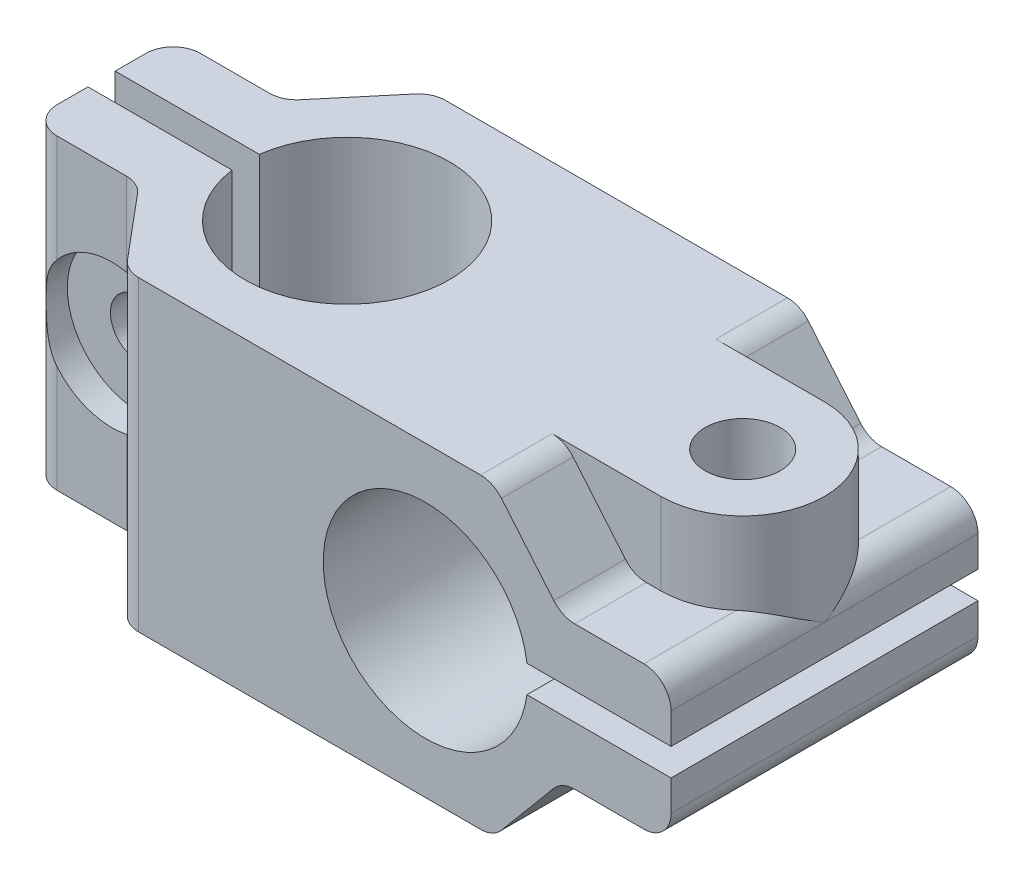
ISO-10303-21;
HEADER;
FILE_DESCRIPTION(('STEP AP214'),'2;1');
FILE_NAME('part.step','',(''),(''),'','','');
FILE_SCHEMA(('AUTOMOTIVE_DESIGN { 1 0 10303 214 1 1 1 1 }'));
ENDSEC;
DATA;
#1=APPLICATION_CONTEXT('core data for automotive mechanical design processes');
#2=APPLICATION_PROTOCOL_DEFINITION('international standard','automotive_design',2000,#1);
#3=PRODUCT_CONTEXT('',#1,'mechanical');
#4=PRODUCT('Part','Part','',(#3));
#5=PRODUCT_RELATED_PRODUCT_CATEGORY('part','',(#4));
#6=PRODUCT_DEFINITION_FORMATION('','',#4);
#7=PRODUCT_DEFINITION_CONTEXT('part definition',#1,'design');
#8=PRODUCT_DEFINITION('design','',#6,#7);
#9=PRODUCT_DEFINITION_SHAPE('','',#8);
#10=(LENGTH_UNIT() NAMED_UNIT(*) SI_UNIT(.MILLI.,.METRE.));
#11=(NAMED_UNIT(*) PLANE_ANGLE_UNIT() SI_UNIT($,.RADIAN.));
#12=(NAMED_UNIT(*) SI_UNIT($,.STERADIAN.) SOLID_ANGLE_UNIT());
#13=UNCERTAINTY_MEASURE_WITH_UNIT(LENGTH_MEASURE(1.E-05),#10,'distance_accuracy_value','');
#14=(GEOMETRIC_REPRESENTATION_CONTEXT(3) GLOBAL_UNCERTAINTY_ASSIGNED_CONTEXT((#13)) GLOBAL_UNIT_ASSIGNED_CONTEXT((#10,
#11,#12)) REPRESENTATION_CONTEXT('',''));
#15=CARTESIAN_POINT('',(0.,0.,0.));
#16=DIRECTION('',(0.,0.,1.));
#17=DIRECTION('',(1.,0.,0.));
#18=AXIS2_PLACEMENT_3D('',#15,#16,#17);
#19=CARTESIAN_POINT('',(-18.5,11.25,5.25000000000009));
#20=DIRECTION('',(0.,0.,1.));
#21=DIRECTION('',(0.,1.,0.));
#22=AXIS2_PLACEMENT_3D('',#19,#20,#21);
#23=PLANE('',#22);
#24=CARTESIAN_POINT('',(-20.4999999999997,0.,5.25000000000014));
#25=DIRECTION('',(0.,0.,1.));
#26=DIRECTION('',(0.,1.,0.));
#27=AXIS2_PLACEMENT_3D('',#24,#25,#26);
#28=CIRCLE('',#27,5.26046108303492);
#29=CARTESIAN_POINT('',(-24.5000000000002,-3.41649686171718,5.25000000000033));
#30=VERTEX_POINT('',#29);
#31=CARTESIAN_POINT('',(-19.43261531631,-5.15103297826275,5.25000000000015));
#32=VERTEX_POINT('',#31);
#33=EDGE_CURVE('E591',#30,#32,#28,.T.);
#34=ORIENTED_EDGE('',*,*,#33,.F.);
#35=DIRECTION('',(0.,-1.,0.));
#36=VECTOR('',#35,1.);
#37=CARTESIAN_POINT('',(-24.5,-11.25,5.25000000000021));
#38=LINE('',#37,#36);
#39=CARTESIAN_POINT('',(-24.5,-11.25,5.25000000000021));
#40=VERTEX_POINT('',#39);
#41=EDGE_CURVE('E594',#30,#40,#38,.T.);
#42=ORIENTED_EDGE('',*,*,#41,.T.);
#43=DIRECTION('',(-1.,0.,0.));
#44=VECTOR('',#43,1.);
#45=CARTESIAN_POINT('',(-18.5,-11.25,5.25000000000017));
#46=LINE('',#45,#44);
#47=CARTESIAN_POINT('',(-19.43261531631,-11.25,5.25000000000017));
#48=VERTEX_POINT('',#47);
#49=EDGE_CURVE('E732',#48,#40,#46,.T.);
#50=ORIENTED_EDGE('',*,*,#49,.F.);
#51=DIRECTION('',(0.,-1.,0.));
#52=VECTOR('',#51,1.);
#53=CARTESIAN_POINT('',(-19.43261531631,11.25,5.2500000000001));
#54=LINE('',#53,#52);
#55=EDGE_CURVE('E597',#48,#32,#54,.F.);
#56=ORIENTED_EDGE('',*,*,#55,.T.);
#57=EDGE_LOOP('',(#34,#42,#50,#56));
#58=FACE_BOUND('',#57,.T.);
#59=ADVANCED_FACE('F38',(#58),#23,.T.);
#60=CARTESIAN_POINT('',(-19.4326153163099,11.25,7.2500000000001));
#61=DIRECTION('',(0.,1.,0.));
#62=DIRECTION('',(1.,0.,0.));
#63=AXIS2_PLACEMENT_3D('',#60,#61,#62);
#64=CYLINDRICAL_SURFACE('',#63,2.);
#65=DIRECTION('',(0.,-1.,0.));
#66=VECTOR('',#65,1.);
#67=CARTESIAN_POINT('',(-17.900526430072,-11.25,5.96442478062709));
#68=LINE('',#67,#66);
#69=CARTESIAN_POINT('',(-17.900526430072,-4.57331258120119,5.96442478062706));
#70=VERTEX_POINT('',#69);
#71=CARTESIAN_POINT('',(-17.900526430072,-11.25,5.96442478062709));
#72=VERTEX_POINT('',#71);
#73=EDGE_CURVE('E636',#70,#72,#68,.T.);
#74=ORIENTED_EDGE('',*,*,#73,.F.);
#75=CARTESIAN_POINT('',(-17.43261531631,-4.27359357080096,7.25000000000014));
#76=CARTESIAN_POINT('',(-17.4326211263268,-4.27360053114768,7.15019352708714));
#77=CARTESIAN_POINT('',(-17.4401479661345,-4.27903102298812,7.05021009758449));
#78=CARTESIAN_POINT('',(-17.4697922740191,-4.30007005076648,6.85340229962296));
#79=CARTESIAN_POINT('',(-17.491950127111,-4.31570675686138,6.75658745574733));
#80=CARTESIAN_POINT('',(-17.5494156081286,-4.35519176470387,6.56950554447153));
#81=CARTESIAN_POINT('',(-17.5846348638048,-4.37898480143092,6.47919923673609));
#82=CARTESIAN_POINT('',(-17.6667632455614,-4.4325632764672,6.30609539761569));
#83=CARTESIAN_POINT('',(-17.7136710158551,-4.4623480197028,6.22329699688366));
#84=CARTESIAN_POINT('',(-17.8231922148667,-4.52897984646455,6.05813071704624));
#85=CARTESIAN_POINT('',(-17.8869201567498,-4.56623749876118,5.97666978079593));
#86=CARTESIAN_POINT('',(-18.0255440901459,-4.64282234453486,5.82496577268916));
#87=CARTESIAN_POINT('',(-18.1004477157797,-4.68215094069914,5.75473043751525));
#88=CARTESIAN_POINT('',(-18.2720545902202,-4.76645940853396,5.61692582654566));
#89=CARTESIAN_POINT('',(-18.3703433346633,-4.81141182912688,5.55129889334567));
#90=CARTESIAN_POINT('',(-18.5780728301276,-4.89809236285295,5.43788605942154));
#91=CARTESIAN_POINT('',(-18.6875153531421,-4.93981996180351,5.3901029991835));
#92=CARTESIAN_POINT('',(-18.914990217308,-5.01743040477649,5.31443583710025));
#93=CARTESIAN_POINT('',(-19.0330156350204,-5.05331788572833,5.28653588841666));
#94=CARTESIAN_POINT('',(-19.2742291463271,-5.11717239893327,5.25257382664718));
#95=CARTESIAN_POINT('',(-19.397412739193,-5.14514617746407,5.24649306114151));
#96=CARTESIAN_POINT('',(-19.6323939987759,-5.18966330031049,5.25687599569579));
#97=CARTESIAN_POINT('',(-19.7441272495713,-5.20705684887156,5.27119346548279));
#98=CARTESIAN_POINT('',(-19.9644430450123,-5.23430381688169,5.3187198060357));
#99=CARTESIAN_POINT('',(-20.0730266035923,-5.2441596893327,5.35192252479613));
#100=CARTESIAN_POINT('',(-20.2768260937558,-5.25665695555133,5.43378825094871));
#101=CARTESIAN_POINT('',(-20.372453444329,-5.25970536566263,5.48137290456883));
#102=CARTESIAN_POINT('',(-20.5549351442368,-5.26096622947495,5.59116381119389));
#103=CARTESIAN_POINT('',(-20.6417889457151,-5.25917838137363,5.65337097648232));
#104=CARTESIAN_POINT('',(-20.8057140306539,-5.25222240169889,5.79181765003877));
#105=CARTESIAN_POINT('',(-20.8826066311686,-5.24700066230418,5.8682656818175));
#106=CARTESIAN_POINT('',(-21.0230061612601,-5.23487267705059,6.03248898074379));
#107=CARTESIAN_POINT('',(-21.0865103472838,-5.22796608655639,6.12026656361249));
#108=CARTESIAN_POINT('',(-21.2005812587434,-5.21393046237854,6.30828885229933));
#109=CARTESIAN_POINT('',(-21.2505929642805,-5.20680248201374,6.40887104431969));
#110=CARTESIAN_POINT('',(-21.3331263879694,-5.1942376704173,6.61707276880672));
#111=CARTESIAN_POINT('',(-21.3656485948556,-5.18880079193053,6.72469210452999));
#112=CARTESIAN_POINT('',(-21.4122916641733,-5.18080535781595,6.94422219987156));
#113=CARTESIAN_POINT('',(-21.4263698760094,-5.17825347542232,7.05614229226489));
#114=CARTESIAN_POINT('',(-21.4355349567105,-5.17660594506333,7.28077693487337));
#115=CARTESIAN_POINT('',(-21.4306233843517,-5.17751001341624,7.39349141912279));
#116=CARTESIAN_POINT('',(-21.4021755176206,-5.18254074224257,7.6148435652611));
#117=CARTESIAN_POINT('',(-21.3789025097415,-5.1866218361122,7.72351628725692));
#118=CARTESIAN_POINT('',(-21.3147559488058,-5.19708291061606,7.93542304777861));
#119=CARTESIAN_POINT('',(-21.2738804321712,-5.20346314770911,8.03865647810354));
#120=CARTESIAN_POINT('',(-21.1752250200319,-5.21718446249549,8.23781257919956));
#121=CARTESIAN_POINT('',(-21.1172941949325,-5.22453378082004,8.33365989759));
#122=CARTESIAN_POINT('',(-20.9862296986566,-5.23835483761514,8.51441521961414));
#123=CARTESIAN_POINT('',(-20.9130947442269,-5.24482650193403,8.59932229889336));
#124=CARTESIAN_POINT('',(-20.7529243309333,-5.2549935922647,8.75647616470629));
#125=CARTESIAN_POINT('',(-20.6657810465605,-5.25866609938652,8.82861479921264));
#126=CARTESIAN_POINT('',(-20.4805411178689,-5.26123851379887,8.95720647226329));
#127=CARTESIAN_POINT('',(-20.3824475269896,-5.26013974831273,9.01366386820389));
#128=CARTESIAN_POINT('',(-20.1814091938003,-5.25173886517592,9.10775582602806));
#129=CARTESIAN_POINT('',(-20.078695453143,-5.24462218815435,9.14590019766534));
#130=CARTESIAN_POINT('',(-19.8690910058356,-5.22355100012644,9.20482348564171));
#131=CARTESIAN_POINT('',(-19.7622012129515,-5.20959797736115,9.22560617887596));
#132=CARTESIAN_POINT('',(-19.550690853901,-5.17517352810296,9.2492659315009));
#133=CARTESIAN_POINT('',(-19.4460924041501,-5.15489914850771,9.2526362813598));
#134=CARTESIAN_POINT('',(-19.2390261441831,-5.10819624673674,9.24330661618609));
#135=CARTESIAN_POINT('',(-19.1365586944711,-5.08176669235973,9.23060390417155));
#136=CARTESIAN_POINT('',(-18.9326452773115,-5.02270023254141,9.18939035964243));
#137=CARTESIAN_POINT('',(-18.8313649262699,-4.98987615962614,9.16033395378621));
#138=CARTESIAN_POINT('',(-18.6358063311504,-4.92016543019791,9.08738935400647));
#139=CARTESIAN_POINT('',(-18.5415304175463,-4.88327743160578,9.04349625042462));
#140=CARTESIAN_POINT('',(-18.3530927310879,-4.80360893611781,8.93742330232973));
#141=CARTESIAN_POINT('',(-18.2597766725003,-4.76060060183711,8.87391124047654));
#142=CARTESIAN_POINT('',(-18.0850558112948,-4.67439906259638,8.73214625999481));
#143=CARTESIAN_POINT('',(-18.0036631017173,-4.63120571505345,8.65387855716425));
#144=CARTESIAN_POINT('',(-17.8495331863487,-4.54486351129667,8.47817527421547));
#145=CARTESIAN_POINT('',(-17.7777412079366,-4.501911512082,8.37980681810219));
#146=CARTESIAN_POINT('',(-17.652262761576,-4.42361073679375,8.16939252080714));
#147=CARTESIAN_POINT('',(-17.5985520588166,-4.38825180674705,8.057365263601));
#148=CARTESIAN_POINT('',(-17.5231587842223,-4.33732490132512,7.85226283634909));
#149=CARTESIAN_POINT('',(-17.4968100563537,-4.31901271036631,7.76157139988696));
#150=CARTESIAN_POINT('',(-17.4571420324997,-4.29116195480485,7.57622360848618));
#151=CARTESIAN_POINT('',(-17.4437819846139,-4.2815959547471,7.48158063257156));
#152=CARTESIAN_POINT('',(-17.4357190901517,-4.2758195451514,7.36369573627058));
#153=CARTESIAN_POINT('',(-17.4345565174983,-4.2749863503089,7.34098423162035));
#154=CARTESIAN_POINT('',(-17.4330039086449,-4.27387252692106,7.29551822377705));
#155=CARTESIAN_POINT('',(-17.4326139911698,-4.27359198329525,7.27276371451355));
#156=CARTESIAN_POINT('',(-17.43261531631,-4.27359357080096,7.25000000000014));
#157=B_SPLINE_CURVE_WITH_KNOTS('',3,(#75,#76,#77,#78,#79,#80,#81,#82,#83,#84,#85,#86,#87,#88,
#89,#90,#91,#92,#93,#94,#95,#96,#97,#98,#99,#100,#101,#102,#103,#104,#105,#106,#107,#108,#109,
#110,#111,#112,#113,#114,#115,#116,#117,#118,#119,#120,#121,#122,#123,#124,#125,#126,#127,#128,
#129,#130,#131,#132,#133,#134,#135,#136,#137,#138,#139,#140,#141,#142,#143,#144,#145,#146,#147,
#148,#149,#150,#151,#152,#153,#154,#155,#156),.UNSPECIFIED.,.T.,.F.,(4,2,2,2,2,2,2,2,2,2,2,2,2,
2,2,2,2,2,2,2,2,2,2,2,2,2,2,2,2,2,2,2,2,2,2,2,2,2,2,2,4),(0.,0.299318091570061,
0.599465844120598,0.897618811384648,1.19573721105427,1.5242911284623,1.85307051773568,
2.23063989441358,2.60826934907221,2.98559749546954,3.3626030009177,3.70274543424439,
4.04277712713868,4.36186268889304,4.68096816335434,5.00517749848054,5.32945320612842,
5.66553173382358,6.00160086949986,6.33844578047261,6.67526304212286,7.00733653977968,
7.33944709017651,7.67458980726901,8.0097608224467,8.34764750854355,8.68544021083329,
9.01318797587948,9.34086442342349,9.65920482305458,9.97759864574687,10.3073038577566,
10.6371182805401,10.9979715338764,11.3591882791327,11.7446053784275,12.1295038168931,
12.4169428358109,12.7034770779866,12.7717346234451,12.8400026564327),.UNSPECIFIED.);
#158=EDGE_CURVE('E516',#70,#32,#157,.T.);
#159=ORIENTED_EDGE('',*,*,#158,.T.);
#160=ORIENTED_EDGE('',*,*,#55,.F.);
#161=CARTESIAN_POINT('',(-19.4326153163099,-11.25,7.25000000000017));
#162=DIRECTION('',(0.,1.,0.));
#163=DIRECTION('',(1.,0.,0.));
#164=AXIS2_PLACEMENT_3D('',#161,#162,#163);
#165=CIRCLE('',#164,2.);
#166=EDGE_CURVE('E663',#72,#48,#165,.T.);
#167=ORIENTED_EDGE('',*,*,#166,.F.);
#168=EDGE_LOOP('',(#74,#159,#160,#167));
#169=FACE_BOUND('',#168,.T.);
#170=ADVANCED_FACE('F537',(#169),#64,.F.);
#171=CARTESIAN_POINT('',(-20.4999999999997,0.,1.00000000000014));
#172=DIRECTION('',(0.,0.,-1.));
#173=DIRECTION('',(0.,-1.,0.));
#174=AXIS2_PLACEMENT_3D('',#171,#172,#173);
#175=CYLINDRICAL_SURFACE('',#174,2.09999999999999);
#176=CARTESIAN_POINT('',(-20.4999999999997,0.,1.00000000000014));
#177=DIRECTION('',(0.,0.,-1.));
#178=DIRECTION('',(0.,-1.,0.));
#179=AXIS2_PLACEMENT_3D('',#176,#177,#178);
#180=CIRCLE('',#179,2.09999999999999);
#181=CARTESIAN_POINT('',(-20.4999999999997,-2.10000000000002,1.00000000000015));
#182=VERTEX_POINT('',#181);
#183=EDGE_CURVE('E598',#182,#182,#180,.T.);
#184=ORIENTED_EDGE('',*,*,#183,.T.);
#185=EDGE_LOOP('',(#184));
#186=FACE_BOUND('',#185,.T.);
#187=CARTESIAN_POINT('',(-20.4999999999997,0.,3.25000000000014));
#188=DIRECTION('',(0.,0.,1.));
#189=DIRECTION('',(0.,1.,0.));
#190=AXIS2_PLACEMENT_3D('',#187,#188,#189);
#191=CIRCLE('',#190,2.09999999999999);
#192=CARTESIAN_POINT('',(-20.4999999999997,2.09999999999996,3.25000000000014));
#193=VERTEX_POINT('',#192);
#194=EDGE_CURVE('E408',#193,#193,#191,.F.);
#195=ORIENTED_EDGE('',*,*,#194,.F.);
#196=EDGE_LOOP('',(#195));
#197=FACE_BOUND('',#196,.T.);
#198=ADVANCED_FACE('F502',(#186,#197),#175,.F.);
#199=CARTESIAN_POINT('',(-26.5000000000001,11.25,-11.2499999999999));
#200=DIRECTION('',(1.,0.,0.));
#201=DIRECTION('',(0.,-1.,0.));
#202=AXIS2_PLACEMENT_3D('',#199,#200,#201);
#203=PLANE('',#202);
#204=DIRECTION('',(0.,1.,0.));
#205=VECTOR('',#204,1.);
#206=CARTESIAN_POINT('',(-26.5,-84.5744249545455,-0.999999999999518));
#207=LINE('',#206,#205);
#208=CARTESIAN_POINT('',(-26.5,-11.25,-0.999999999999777));
#209=VERTEX_POINT('',#208);
#210=CARTESIAN_POINT('',(-26.5,11.25,-0.999999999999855));
#211=VERTEX_POINT('',#210);
#212=EDGE_CURVE('E798',#209,#211,#207,.T.);
#213=ORIENTED_EDGE('',*,*,#212,.T.);
#214=DIRECTION('',(0.,0.,1.));
#215=VECTOR('',#214,1.);
#216=CARTESIAN_POINT('',(-26.5000000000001,11.25,-11.2499999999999));
#217=LINE('',#216,#215);
#218=CARTESIAN_POINT('',(-26.5,11.25,-3.24999999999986));
#219=VERTEX_POINT('',#218);
#220=EDGE_CURVE('E692',#219,#211,#217,.T.);
#221=ORIENTED_EDGE('',*,*,#220,.F.);
#222=DIRECTION('',(0.,-1.,0.));
#223=VECTOR('',#222,1.);
#224=CARTESIAN_POINT('',(-26.5,11.25,-3.24999999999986));
#225=LINE('',#224,#223);
#226=CARTESIAN_POINT('',(-26.5,0.,-3.24999999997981));
#227=VERTEX_POINT('',#226);
#228=EDGE_CURVE('E620',#219,#227,#225,.T.);
#229=ORIENTED_EDGE('',*,*,#228,.T.);
#230=CARTESIAN_POINT('',(-26.5,-11.25,-3.24999999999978));
#231=VERTEX_POINT('',#230);
#232=EDGE_CURVE('E619',#227,#231,#225,.T.);
#233=ORIENTED_EDGE('',*,*,#232,.T.);
#234=DIRECTION('',(0.,0.,1.));
#235=VECTOR('',#234,1.);
#236=CARTESIAN_POINT('',(-26.5000000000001,-11.25,-11.2499999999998));
#237=LINE('',#236,#235);
#238=EDGE_CURVE('E697',#231,#209,#237,.T.);
#239=ORIENTED_EDGE('',*,*,#238,.T.);
#240=EDGE_LOOP('',(#213,#221,#229,#233,#239));
#241=FACE_BOUND('',#240,.T.);
#242=ADVANCED_FACE('F40',(#241),#203,.F.);
#243=DIRECTION('',(0.,1.,0.));
#244=VECTOR('',#243,1.);
#245=CARTESIAN_POINT('',(-26.5,-84.5744249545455,1.00000000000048));
#246=LINE('',#245,#244);
#247=CARTESIAN_POINT('',(-26.5,-11.25,1.00000000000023));
#248=VERTEX_POINT('',#247);
#249=CARTESIAN_POINT('',(-26.5,11.25,1.00000000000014));
#250=VERTEX_POINT('',#249);
#251=EDGE_CURVE('E799',#248,#250,#246,.T.);
#252=ORIENTED_EDGE('',*,*,#251,.F.);
#253=CARTESIAN_POINT('',(-26.5,-11.25,3.25000000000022));
#254=VERTEX_POINT('',#253);
#255=EDGE_CURVE('E701',#248,#254,#237,.T.);
#256=ORIENTED_EDGE('',*,*,#255,.T.);
#257=DIRECTION('',(0.,-1.,0.));
#258=VECTOR('',#257,1.);
#259=CARTESIAN_POINT('',(-26.5,11.25,3.25000000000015));
#260=LINE('',#259,#258);
#261=CARTESIAN_POINT('',(-26.5,11.25,3.25000000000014));
#262=VERTEX_POINT('',#261);
#263=EDGE_CURVE('E623',#254,#262,#260,.F.);
#264=ORIENTED_EDGE('',*,*,#263,.T.);
#265=EDGE_CURVE('E694',#250,#262,#217,.T.);
#266=ORIENTED_EDGE('',*,*,#265,.F.);
#267=EDGE_LOOP('',(#252,#256,#264,#266));
#268=FACE_BOUND('',#267,.T.);
#269=ADVANCED_FACE('F576',(#268),#203,.F.);
#270=CARTESIAN_POINT('',(0.,11.25,-11.25));
#271=DIRECTION('',(0.,-1.,0.));
#272=DIRECTION('',(-1.,0.,0.));
#273=AXIS2_PLACEMENT_3D('',#270,#271,#272);
#274=PLANE('',#273);
#275=DIRECTION('',(-1.,0.,0.));
#276=VECTOR('',#275,1.);
#277=CARTESIAN_POINT('',(0.,11.25,-1.00000000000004));
#278=LINE('',#277,#276);
#279=CARTESIAN_POINT('',(-15.9330343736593,11.25,-0.999999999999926));
#280=VERTEX_POINT('',#279);
#281=EDGE_CURVE('E739',#280,#211,#278,.T.);
#282=ORIENTED_EDGE('',*,*,#281,.F.);
#283=CARTESIAN_POINT('',(-8.50000000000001,11.25,0.));
#284=DIRECTION('',(0.,-1.,0.));
#285=DIRECTION('',(-1.,0.,0.));
#286=AXIS2_PLACEMENT_3D('',#283,#284,#285);
#287=CIRCLE('',#286,7.5);
#288=CARTESIAN_POINT('',(-15.9330343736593,11.25,1.00000000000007));
#289=VERTEX_POINT('',#288);
#290=EDGE_CURVE('E810',#289,#280,#287,.F.);
#291=ORIENTED_EDGE('',*,*,#290,.F.);
#292=DIRECTION('',(1.,0.,0.));
#293=VECTOR('',#292,1.);
#294=CARTESIAN_POINT('',(0.,11.25,0.999999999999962));
#295=LINE('',#294,#293);
#296=EDGE_CURVE('E801',#250,#289,#295,.T.);
#297=ORIENTED_EDGE('',*,*,#296,.F.);
#298=ORIENTED_EDGE('',*,*,#265,.T.);
#299=CARTESIAN_POINT('',(-24.5,11.25,3.25000000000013));
#300=DIRECTION('',(0.,-1.,0.));
#301=DIRECTION('',(-1.,0.,0.));
#302=AXIS2_PLACEMENT_3D('',#299,#300,#301);
#303=CIRCLE('',#302,2.);
#304=CARTESIAN_POINT('',(-24.5,11.25,5.25000000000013));
#305=VERTEX_POINT('',#304);
#306=EDGE_CURVE('E632',#262,#305,#303,.F.);
#307=ORIENTED_EDGE('',*,*,#306,.T.);
#308=DIRECTION('',(-1.,0.,0.));
#309=VECTOR('',#308,1.);
#310=CARTESIAN_POINT('',(-18.5,11.25,5.25000000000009));
#311=LINE('',#310,#309);
#312=CARTESIAN_POINT('',(-19.43261531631,11.25,5.2500000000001));
#313=VERTEX_POINT('',#312);
#314=EDGE_CURVE('E727',#313,#305,#311,.T.);
#315=ORIENTED_EDGE('',*,*,#314,.F.);
#316=CARTESIAN_POINT('',(-19.4326153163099,11.25,7.2500000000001));
#317=DIRECTION('',(0.,-1.,0.));
#318=DIRECTION('',(-1.,0.,0.));
#319=AXIS2_PLACEMENT_3D('',#316,#317,#318);
#320=CIRCLE('',#319,2.);
#321=CARTESIAN_POINT('',(-17.900526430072,11.25,5.96442478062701));
#322=VERTEX_POINT('',#321);
#323=EDGE_CURVE('E665',#313,#322,#320,.T.);
#324=ORIENTED_EDGE('',*,*,#323,.T.);
#325=DIRECTION('',(-0.642787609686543,0.,-0.766044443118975));
#326=VECTOR('',#325,1.);
#327=CARTESIAN_POINT('',(-13.4654022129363,11.25,11.2500000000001));
#328=LINE('',#327,#326);
#329=CARTESIAN_POINT('',(-14.0648757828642,11.25,10.5355752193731));
#330=VERTEX_POINT('',#329);
#331=EDGE_CURVE('E724',#330,#322,#328,.T.);
#332=ORIENTED_EDGE('',*,*,#331,.F.);
#333=CARTESIAN_POINT('',(-12.5327868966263,11.25,9.25000000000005));
#334=DIRECTION('',(0.,-1.,0.));
#335=DIRECTION('',(-1.,0.,0.));
#336=AXIS2_PLACEMENT_3D('',#333,#334,#335);
#337=CIRCLE('',#336,2.);
#338=CARTESIAN_POINT('',(-12.5327868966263,11.25,11.25));
#339=VERTEX_POINT('',#338);
#340=EDGE_CURVE('E630',#330,#339,#337,.F.);
#341=ORIENTED_EDGE('',*,*,#340,.T.);
#342=DIRECTION('',(1.,0.,0.));
#343=VECTOR('',#342,1.);
#344=CARTESIAN_POINT('',(0.,11.25,11.25));
#345=LINE('',#344,#343);
#346=CARTESIAN_POINT('',(12.5327868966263,11.25,11.25));
#347=VERTEX_POINT('',#346);
#348=EDGE_CURVE('E710',#339,#347,#345,.T.);
#349=ORIENTED_EDGE('',*,*,#348,.T.);
#350=DIRECTION('',(0.,0.,1.));
#351=VECTOR('',#350,1.);
#352=CARTESIAN_POINT('',(12.5327868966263,11.25,-11.25));
#353=LINE('',#352,#351);
#354=CARTESIAN_POINT('',(12.5327868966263,11.25,6.));
#355=VERTEX_POINT('',#354);
#356=EDGE_CURVE('E1438',#347,#355,#353,.F.);
#357=ORIENTED_EDGE('',*,*,#356,.T.);
#358=DIRECTION('',(1.,0.,0.));
#359=VECTOR('',#358,1.);
#360=CARTESIAN_POINT('',(0.,11.25,6.));
#361=LINE('',#360,#359);
#362=CARTESIAN_POINT('',(20.5,11.25,6.));
#363=VERTEX_POINT('',#362);
#364=EDGE_CURVE('E1496',#355,#363,#361,.T.);
#365=ORIENTED_EDGE('',*,*,#364,.T.);
#366=CARTESIAN_POINT('',(20.5,11.25,0.));
#367=DIRECTION('',(0.,1.,0.));
#368=DIRECTION('',(0.,0.,1.));
#369=AXIS2_PLACEMENT_3D('',#366,#367,#368);
#370=CIRCLE('',#369,6.);
#371=CARTESIAN_POINT('',(20.5,11.25,-6.));
#372=VERTEX_POINT('',#371);
#373=EDGE_CURVE('E1490',#363,#372,#370,.T.);
#374=ORIENTED_EDGE('',*,*,#373,.T.);
#375=DIRECTION('',(-1.,0.,0.));
#376=VECTOR('',#375,1.);
#377=CARTESIAN_POINT('',(20.5,11.25,-6.));
#378=LINE('',#377,#376);
#379=CARTESIAN_POINT('',(12.5327868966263,11.25,-6.));
#380=VERTEX_POINT('',#379);
#381=EDGE_CURVE('E1494',#372,#380,#378,.T.);
#382=ORIENTED_EDGE('',*,*,#381,.T.);
#383=CARTESIAN_POINT('',(12.5327868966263,11.25,-11.25));
#384=VERTEX_POINT('',#383);
#385=EDGE_CURVE('E853',#380,#384,#353,.F.);
#386=ORIENTED_EDGE('',*,*,#385,.T.);
#387=DIRECTION('',(1.,0.,0.));
#388=VECTOR('',#387,1.);
#389=CARTESIAN_POINT('',(0.,11.25,-11.25));
#390=LINE('',#389,#388);
#391=CARTESIAN_POINT('',(-12.5327868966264,11.25,-11.25));
#392=VERTEX_POINT('',#391);
#393=EDGE_CURVE('E705',#392,#384,#390,.T.);
#394=ORIENTED_EDGE('',*,*,#393,.F.);
#395=CARTESIAN_POINT('',(-12.5327868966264,11.25,-9.24999999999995));
#396=DIRECTION('',(0.,-1.,0.));
#397=DIRECTION('',(-1.,0.,0.));
#398=AXIS2_PLACEMENT_3D('',#395,#396,#397);
#399=CIRCLE('',#398,2.);
#400=CARTESIAN_POINT('',(-14.0648757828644,11.25,-10.535575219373));
#401=VERTEX_POINT('',#400);
#402=EDGE_CURVE('E626',#392,#401,#399,.F.);
#403=ORIENTED_EDGE('',*,*,#402,.T.);
#404=DIRECTION('',(-0.642787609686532,0.,0.766044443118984));
#405=VECTOR('',#404,1.);
#406=CARTESIAN_POINT('',(-13.4654022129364,11.25,-11.2499999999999));
#407=LINE('',#406,#405);
#408=CARTESIAN_POINT('',(-17.9005264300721,11.25,-5.96442478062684));
#409=VERTEX_POINT('',#408);
#410=EDGE_CURVE('E712',#401,#409,#407,.T.);
#411=ORIENTED_EDGE('',*,*,#410,.T.);
#412=CARTESIAN_POINT('',(-19.4326153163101,11.25,-7.2499999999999));
#413=DIRECTION('',(0.,-1.,0.));
#414=DIRECTION('',(-1.,0.,0.));
#415=AXIS2_PLACEMENT_3D('',#412,#413,#414);
#416=CIRCLE('',#415,2.);
#417=CARTESIAN_POINT('',(-19.43261531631,11.25,-5.2499999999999));
#418=VERTEX_POINT('',#417);
#419=EDGE_CURVE('E669',#409,#418,#416,.T.);
#420=ORIENTED_EDGE('',*,*,#419,.T.);
#421=DIRECTION('',(-1.,0.,0.));
#422=VECTOR('',#421,1.);
#423=CARTESIAN_POINT('',(-18.5,11.25,-5.24999999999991));
#424=LINE('',#423,#422);
#425=CARTESIAN_POINT('',(-24.5,11.25,-5.24999999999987));
#426=VERTEX_POINT('',#425);
#427=EDGE_CURVE('E715',#418,#426,#424,.T.);
#428=ORIENTED_EDGE('',*,*,#427,.T.);
#429=CARTESIAN_POINT('',(-24.5,11.25,-3.24999999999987));
#430=DIRECTION('',(0.,-1.,0.));
#431=DIRECTION('',(-1.,0.,0.));
#432=AXIS2_PLACEMENT_3D('',#429,#430,#431);
#433=CIRCLE('',#432,2.);
#434=EDGE_CURVE('E628',#426,#219,#433,.F.);
#435=ORIENTED_EDGE('',*,*,#434,.T.);
#436=ORIENTED_EDGE('',*,*,#220,.T.);
#437=EDGE_LOOP('',(#282,#291,#297,#298,#307,#315,#324,#332,#341,#349,#357,#365,#374,#382,#386,
#394,#403,#411,#420,#428,#435,#436));
#438=FACE_BOUND('',#437,.T.);
#439=CARTESIAN_POINT('',(20.4999999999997,11.25,0.));
#440=DIRECTION('',(0.,1.,0.));
#441=DIRECTION('',(0.,0.,1.));
#442=AXIS2_PLACEMENT_3D('',#439,#440,#441);
#443=CIRCLE('',#442,2.74999999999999);
#444=CARTESIAN_POINT('',(20.4999999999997,11.25,2.75000000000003));
#445=VERTEX_POINT('',#444);
#446=EDGE_CURVE('E1469',#445,#445,#443,.T.);
#447=ORIENTED_EDGE('',*,*,#446,.F.);
#448=EDGE_LOOP('',(#447));
#449=FACE_BOUND('',#448,.T.);
#450=ADVANCED_FACE('F573',(#438,#449),#274,.F.);
#451=CARTESIAN_POINT('',(0.,-11.25,-11.25));
#452=DIRECTION('',(0.,1.,0.));
#453=DIRECTION('',(1.,0.,0.));
#454=AXIS2_PLACEMENT_3D('',#451,#452,#453);
#455=PLANE('',#454);
#456=DIRECTION('',(1.,0.,0.));
#457=VECTOR('',#456,1.);
#458=CARTESIAN_POINT('',(0.,-11.25,-0.999999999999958));
#459=LINE('',#458,#457);
#460=CARTESIAN_POINT('',(-15.9330343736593,-11.25,-0.999999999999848));
#461=VERTEX_POINT('',#460);
#462=EDGE_CURVE('E52',#209,#461,#459,.T.);
#463=ORIENTED_EDGE('',*,*,#462,.F.);
#464=ORIENTED_EDGE('',*,*,#238,.F.);
#465=CARTESIAN_POINT('',(-24.5,-11.25,-3.24999999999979));
#466=DIRECTION('',(0.,1.,0.));
#467=DIRECTION('',(1.,0.,0.));
#468=AXIS2_PLACEMENT_3D('',#465,#466,#467);
#469=CIRCLE('',#468,2.);
#470=CARTESIAN_POINT('',(-24.5,-11.25,-5.24999999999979));
#471=VERTEX_POINT('',#470);
#472=EDGE_CURVE('E614',#231,#471,#469,.F.);
#473=ORIENTED_EDGE('',*,*,#472,.T.);
#474=DIRECTION('',(-1.,0.,0.));
#475=VECTOR('',#474,1.);
#476=CARTESIAN_POINT('',(-18.5,-11.25,-5.24999999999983));
#477=LINE('',#476,#475);
#478=CARTESIAN_POINT('',(-19.43261531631,-11.25,-5.24999999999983));
#479=VERTEX_POINT('',#478);
#480=EDGE_CURVE('E721',#479,#471,#477,.T.);
#481=ORIENTED_EDGE('',*,*,#480,.F.);
#482=CARTESIAN_POINT('',(-19.4326153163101,-11.25,-7.24999999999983));
#483=DIRECTION('',(0.,1.,0.));
#484=DIRECTION('',(1.,0.,0.));
#485=AXIS2_PLACEMENT_3D('',#482,#483,#484);
#486=CIRCLE('',#485,2.);
#487=CARTESIAN_POINT('',(-17.9005264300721,-11.25,-5.96442478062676));
#488=VERTEX_POINT('',#487);
#489=EDGE_CURVE('E667',#479,#488,#486,.T.);
#490=ORIENTED_EDGE('',*,*,#489,.T.);
#491=DIRECTION('',(-0.642787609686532,0.,0.766044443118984));
#492=VECTOR('',#491,1.);
#493=CARTESIAN_POINT('',(-13.4654022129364,-11.25,-11.2499999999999));
#494=LINE('',#493,#492);
#495=CARTESIAN_POINT('',(-14.0648757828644,-11.25,-10.5355752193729));
#496=VERTEX_POINT('',#495);
#497=EDGE_CURVE('E718',#496,#488,#494,.T.);
#498=ORIENTED_EDGE('',*,*,#497,.F.);
#499=CARTESIAN_POINT('',(-12.5327868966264,-11.25,-9.24999999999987));
#500=DIRECTION('',(0.,1.,0.));
#501=DIRECTION('',(1.,0.,0.));
#502=AXIS2_PLACEMENT_3D('',#499,#500,#501);
#503=CIRCLE('',#502,2.);
#504=CARTESIAN_POINT('',(-12.5327868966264,-11.25,-11.2499999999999));
#505=VERTEX_POINT('',#504);
#506=EDGE_CURVE('E608',#496,#505,#503,.F.);
#507=ORIENTED_EDGE('',*,*,#506,.T.);
#508=DIRECTION('',(-1.,0.,0.));
#509=VECTOR('',#508,1.);
#510=CARTESIAN_POINT('',(0.,-11.25,-11.25));
#511=LINE('',#510,#509);
#512=CARTESIAN_POINT('',(12.5327868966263,-11.25,-11.25));
#513=VERTEX_POINT('',#512);
#514=EDGE_CURVE('E702',#513,#505,#511,.T.);
#515=ORIENTED_EDGE('',*,*,#514,.F.);
#516=DIRECTION('',(0.,0.,1.));
#517=VECTOR('',#516,1.);
#518=CARTESIAN_POINT('',(12.5327868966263,-11.25,11.25));
#519=LINE('',#518,#517);
#520=CARTESIAN_POINT('',(12.5327868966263,-11.25,11.25));
#521=VERTEX_POINT('',#520);
#522=EDGE_CURVE('E1413',#513,#521,#519,.T.);
#523=ORIENTED_EDGE('',*,*,#522,.T.);
#524=DIRECTION('',(-1.,0.,0.));
#525=VECTOR('',#524,1.);
#526=CARTESIAN_POINT('',(0.,-11.25,11.25));
#527=LINE('',#526,#525);
#528=CARTESIAN_POINT('',(-12.5327868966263,-11.25,11.2500000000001));
#529=VERTEX_POINT('',#528);
#530=EDGE_CURVE('E707',#521,#529,#527,.T.);
#531=ORIENTED_EDGE('',*,*,#530,.T.);
#532=CARTESIAN_POINT('',(-12.5327868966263,-11.25,9.25000000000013));
#533=DIRECTION('',(0.,1.,0.));
#534=DIRECTION('',(1.,0.,0.));
#535=AXIS2_PLACEMENT_3D('',#532,#533,#534);
#536=CIRCLE('',#535,2.);
#537=CARTESIAN_POINT('',(-14.0648757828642,-11.25,10.5355752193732));
#538=VERTEX_POINT('',#537);
#539=EDGE_CURVE('E616',#529,#538,#536,.F.);
#540=ORIENTED_EDGE('',*,*,#539,.T.);
#541=DIRECTION('',(-0.642787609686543,0.,-0.766044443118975));
#542=VECTOR('',#541,1.);
#543=CARTESIAN_POINT('',(-13.4654022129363,-11.25,11.2500000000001));
#544=LINE('',#543,#542);
#545=EDGE_CURVE('E729',#538,#72,#544,.T.);
#546=ORIENTED_EDGE('',*,*,#545,.T.);
#547=ORIENTED_EDGE('',*,*,#166,.T.);
#548=ORIENTED_EDGE('',*,*,#49,.T.);
#549=CARTESIAN_POINT('',(-24.5,-11.25,3.25000000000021));
#550=DIRECTION('',(0.,1.,0.));
#551=DIRECTION('',(1.,0.,0.));
#552=AXIS2_PLACEMENT_3D('',#549,#550,#551);
#553=CIRCLE('',#552,2.);
#554=EDGE_CURVE('E604',#40,#254,#553,.F.);
#555=ORIENTED_EDGE('',*,*,#554,.T.);
#556=ORIENTED_EDGE('',*,*,#255,.F.);
#557=DIRECTION('',(-1.,0.,0.));
#558=VECTOR('',#557,1.);
#559=CARTESIAN_POINT('',(0.,-11.25,1.00000000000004));
#560=LINE('',#559,#558);
#561=CARTESIAN_POINT('',(-15.9330343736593,-11.25,1.00000000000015));
#562=VERTEX_POINT('',#561);
#563=EDGE_CURVE('E671',#562,#248,#560,.T.);
#564=ORIENTED_EDGE('',*,*,#563,.F.);
#565=CARTESIAN_POINT('',(-8.50000000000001,-11.25,0.));
#566=DIRECTION('',(0.,1.,0.));
#567=DIRECTION('',(1.,0.,0.));
#568=AXIS2_PLACEMENT_3D('',#565,#566,#567);
#569=CIRCLE('',#568,7.5);
#570=EDGE_CURVE('E674',#461,#562,#569,.F.);
#571=ORIENTED_EDGE('',*,*,#570,.F.);
#572=EDGE_LOOP('',(#463,#464,#473,#481,#490,#498,#507,#515,#523,#531,#540,#546,#547,#548,#555,
#556,#564,#571));
#573=FACE_BOUND('',#572,.T.);
#574=ADVANCED_FACE('F571',(#573),#455,.F.);
#575=CARTESIAN_POINT('',(-18.5,11.25,-5.24999999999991));
#576=DIRECTION('',(0.,0.,1.));
#577=DIRECTION('',(0.,1.,0.));
#578=AXIS2_PLACEMENT_3D('',#575,#576,#577);
#579=PLANE('',#578);
#580=DIRECTION('',(0.,-1.,0.));
#581=VECTOR('',#580,1.);
#582=CARTESIAN_POINT('',(-19.43261531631,-11.25,-5.24999999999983));
#583=LINE('',#582,#581);
#584=CARTESIAN_POINT('',(-19.43261531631,5.99999999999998,-5.24999999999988));
#585=VERTEX_POINT('',#584);
#586=EDGE_CURVE('E644',#418,#585,#583,.T.);
#587=ORIENTED_EDGE('',*,*,#586,.T.);
#588=DIRECTION('',(1.,0.,0.));
#589=VECTOR('',#588,1.);
#590=CARTESIAN_POINT('',(-20.5,5.99999999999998,-5.24999999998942));
#591=LINE('',#590,#589);
#592=CARTESIAN_POINT('',(-20.5,5.99999999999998,-5.24999999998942));
#593=VERTEX_POINT('',#592);
#594=EDGE_CURVE('E826',#593,#585,#591,.T.);
#595=ORIENTED_EDGE('',*,*,#594,.F.);
#596=CARTESIAN_POINT('',(-20.5,0.,-5.2499999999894));
#597=DIRECTION('',(0.,0.,1.));
#598=DIRECTION('',(0.,1.,0.));
#599=AXIS2_PLACEMENT_3D('',#596,#597,#598);
#600=CIRCLE('',#599,6.);
#601=CARTESIAN_POINT('',(-24.5,4.47213595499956,-5.24999999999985));
#602=VERTEX_POINT('',#601);
#603=EDGE_CURVE('E829',#602,#593,#600,.F.);
#604=ORIENTED_EDGE('',*,*,#603,.F.);
#605=DIRECTION('',(0.,-1.,0.));
#606=VECTOR('',#605,1.);
#607=CARTESIAN_POINT('',(-24.5,11.25,-5.24999999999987));
#608=LINE('',#607,#606);
#609=EDGE_CURVE('E647',#602,#426,#608,.F.);
#610=ORIENTED_EDGE('',*,*,#609,.T.);
#611=ORIENTED_EDGE('',*,*,#427,.F.);
#612=EDGE_LOOP('',(#587,#595,#604,#610,#611));
#613=FACE_BOUND('',#612,.T.);
#614=ADVANCED_FACE('F562',(#613),#579,.F.);
#615=CARTESIAN_POINT('',(-13.4654022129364,11.25,-11.2499999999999));
#616=DIRECTION('',(0.766044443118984,0.,0.642787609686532));
#617=DIRECTION('',(-0.642787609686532,0.,0.766044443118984));
#618=AXIS2_PLACEMENT_3D('',#615,#616,#617);
#619=PLANE('',#618);
#620=DIRECTION('',(0.,-1.,0.));
#621=VECTOR('',#620,1.);
#622=CARTESIAN_POINT('',(-14.0648757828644,-11.25,-10.5355752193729));
#623=LINE('',#622,#621);
#624=CARTESIAN_POINT('',(-14.0648757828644,5.99999999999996,-10.535575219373));
#625=VERTEX_POINT('',#624);
#626=EDGE_CURVE('E652',#401,#625,#623,.T.);
#627=ORIENTED_EDGE('',*,*,#626,.T.);
#628=DIRECTION('',(0.642787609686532,0.,-0.766044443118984));
#629=VECTOR('',#628,1.);
#630=CARTESIAN_POINT('',(-246223.849725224,6.00000000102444,293410.860050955));
#631=LINE('',#630,#629);
#632=CARTESIAN_POINT('',(-17.9005264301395,5.99999999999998,-5.96442478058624));
#633=VERTEX_POINT('',#632);
#634=EDGE_CURVE('E816',#633,#625,#631,.T.);
#635=ORIENTED_EDGE('',*,*,#634,.F.);
#636=DIRECTION('',(0.,-1.,0.));
#637=VECTOR('',#636,1.);
#638=CARTESIAN_POINT('',(-17.9005264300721,11.25,-5.96442478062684));
#639=LINE('',#638,#637);
#640=EDGE_CURVE('E655',#633,#409,#639,.F.);
#641=ORIENTED_EDGE('',*,*,#640,.T.);
#642=ORIENTED_EDGE('',*,*,#410,.F.);
#643=EDGE_LOOP('',(#627,#635,#641,#642));
#644=FACE_BOUND('',#643,.T.);
#645=ADVANCED_FACE('F557',(#644),#619,.F.);
#646=CARTESIAN_POINT('',(-24.5,11.25,-3.24999999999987));
#647=DIRECTION('',(0.,-1.,0.));
#648=DIRECTION('',(-1.,0.,0.));
#649=AXIS2_PLACEMENT_3D('',#646,#647,#648);
#650=CYLINDRICAL_SURFACE('',#649,2.);
#651=CARTESIAN_POINT('',(-26.5,0.,-3.24999999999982));
#652=CARTESIAN_POINT('',(-26.5,-1.89141543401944E-08,-3.25011793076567));
#653=CARTESIAN_POINT('',(-26.4999999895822,-0.000338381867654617,-3.25023586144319));
#654=CARTESIAN_POINT('',(-26.4999999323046,-0.00109189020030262,-3.25056021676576));
#655=CARTESIAN_POINT('',(-26.4999998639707,-0.00137423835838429,-3.25076666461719));
#656=CARTESIAN_POINT('',(-26.499999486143,-0.00254169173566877,-3.25154420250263));
#657=CARTESIAN_POINT('',(-26.4999989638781,-0.00360997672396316,-3.25211473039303));
#658=CARTESIAN_POINT('',(-26.4999959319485,-0.00772759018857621,-3.25437139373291));
#659=CARTESIAN_POINT('',(-26.4999915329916,-0.01056828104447,-3.25605869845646));
#660=CARTESIAN_POINT('',(-26.4998731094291,-0.0621961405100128,-3.28664355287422));
#661=CARTESIAN_POINT('',(-26.4991352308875,-0.1131583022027,-3.31552831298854));
#662=CARTESIAN_POINT('',(-26.4963899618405,-0.21452826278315,-3.3736238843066));
#663=CARTESIAN_POINT('',(-26.4943669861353,-0.264921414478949,-3.40283431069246));
#664=CARTESIAN_POINT('',(-26.4891305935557,-0.364199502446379,-3.46013692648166));
#665=CARTESIAN_POINT('',(-26.4859623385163,-0.413073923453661,-3.4882317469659));
#666=CARTESIAN_POINT('',(-26.4784399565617,-0.510548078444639,-3.54422900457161));
#667=CARTESIAN_POINT('',(-26.4740897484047,-0.559148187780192,-3.57213177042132));
#668=CARTESIAN_POINT('',(-26.4582337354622,-0.714859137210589,-3.66134832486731));
#669=CARTESIAN_POINT('',(-26.4444215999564,-0.821914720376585,-3.72241143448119));
#670=CARTESIAN_POINT('',(-26.4107894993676,-1.03657144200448,-3.84405360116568));
#671=CARTESIAN_POINT('',(-26.3909191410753,-1.14416941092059,-3.90462404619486));
#672=CARTESIAN_POINT('',(-26.3501485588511,-1.33532857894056,-4.01121850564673));
#673=CARTESIAN_POINT('',(-26.3304294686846,-1.41898717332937,-4.05751997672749));
#674=CARTESIAN_POINT('',(-26.2872957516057,-1.58575253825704,-4.14895716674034));
#675=CARTESIAN_POINT('',(-26.263888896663,-1.66886009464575,-4.19409511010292));
#676=CARTESIAN_POINT('',(-26.213763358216,-1.83306813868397,-4.28224891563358));
#677=CARTESIAN_POINT('',(-26.1871146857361,-1.91417712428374,-4.32528866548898));
#678=CARTESIAN_POINT('',(-26.1300978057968,-2.07589824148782,-4.40990736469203));
#679=CARTESIAN_POINT('',(-26.0997279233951,-2.15651013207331,-4.45148564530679));
#680=CARTESIAN_POINT('',(-26.0227365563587,-2.34814329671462,-4.54863820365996));
#681=CARTESIAN_POINT('',(-25.9743701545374,-2.45887755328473,-4.60341186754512));
#682=CARTESIAN_POINT('',(-25.8699460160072,-2.67929401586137,-4.70903646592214));
#683=CARTESIAN_POINT('',(-25.8138555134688,-2.7889694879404,-4.75986916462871));
#684=CARTESIAN_POINT('',(-25.6914289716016,-3.01094646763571,-4.85839320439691));
#685=CARTESIAN_POINT('',(-25.6247615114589,-3.12316473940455,-4.90586287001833));
#686=CARTESIAN_POINT('',(-25.4829469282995,-3.34477389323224,-4.9937790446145));
#687=CARTESIAN_POINT('',(-25.4078118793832,-3.45416853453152,-5.03423535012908));
#688=CARTESIAN_POINT('',(-25.2717474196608,-3.63861676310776,-5.09615158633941));
#689=CARTESIAN_POINT('',(-25.2129268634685,-3.71451838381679,-5.11973155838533));
#690=CARTESIAN_POINT('',(-25.0909432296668,-3.86426788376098,-5.16179231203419));
#691=CARTESIAN_POINT('',(-25.0277792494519,-3.93811533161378,-5.18027202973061));
#692=CARTESIAN_POINT('',(-24.8979205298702,-4.08260063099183,-5.21113907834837));
#693=CARTESIAN_POINT('',(-24.8312681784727,-4.15326346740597,-5.22358639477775));
#694=CARTESIAN_POINT('',(-24.6941502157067,-4.29169012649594,-5.24175539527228));
#695=CARTESIAN_POINT('',(-24.6236848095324,-4.35945410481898,-5.24747744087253));
#696=CARTESIAN_POINT('',(-24.4434520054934,-4.5244430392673,-5.25212000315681));
#697=CARTESIAN_POINT('',(-24.3315556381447,-4.61957359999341,-5.24624736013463));
#698=CARTESIAN_POINT('',(-24.1027730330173,-4.80012688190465,-5.21355262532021));
#699=CARTESIAN_POINT('',(-23.9858847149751,-4.88554550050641,-5.18672171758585));
#700=CARTESIAN_POINT('',(-23.771791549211,-5.03082353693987,-5.11552403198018));
#701=CARTESIAN_POINT('',(-23.6746214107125,-5.09255892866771,-5.07491751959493));
#702=CARTESIAN_POINT('',(-23.4838366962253,-5.20663491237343,-4.97595891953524));
#703=CARTESIAN_POINT('',(-23.3902197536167,-5.25898184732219,-4.91761888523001));
#704=CARTESIAN_POINT('',(-23.2103924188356,-5.35389447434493,-4.78284019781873));
#705=CARTESIAN_POINT('',(-23.124225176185,-5.39640529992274,-4.7063046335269));
#706=CARTESIAN_POINT('',(-22.9645044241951,-5.47119935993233,-4.53677842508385));
#707=CARTESIAN_POINT('',(-22.8909484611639,-5.50348458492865,-4.44379098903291));
#708=CARTESIAN_POINT('',(-22.7668310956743,-5.55568044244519,-4.25386464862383));
#709=CARTESIAN_POINT('',(-22.7147382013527,-5.57648282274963,-4.15816675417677));
#710=CARTESIAN_POINT('',(-22.6265049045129,-5.61072452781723,-3.95846492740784));
#711=CARTESIAN_POINT('',(-22.5903607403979,-5.62416558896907,-3.85446296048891));
#712=CARTESIAN_POINT('',(-22.5365538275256,-5.64386782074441,-3.6451490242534));
#713=CARTESIAN_POINT('',(-22.5182764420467,-5.65036854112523,-3.54001687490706));
#714=CARTESIAN_POINT('',(-22.4986879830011,-5.65732781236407,-3.32798802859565));
#715=CARTESIAN_POINT('',(-22.497375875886,-5.65778673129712,-3.22109143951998));
#716=CARTESIAN_POINT('',(-22.5117353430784,-5.6526963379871,-3.00908090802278));
#717=CARTESIAN_POINT('',(-22.5273298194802,-5.64717430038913,-2.90396107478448));
#718=CARTESIAN_POINT('',(-22.5747840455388,-5.62991139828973,-2.69799456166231));
#719=CARTESIAN_POINT('',(-22.6066431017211,-5.61817079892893,-2.59714769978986));
#720=CARTESIAN_POINT('',(-22.6853878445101,-5.58800920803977,-2.40253050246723));
#721=CARTESIAN_POINT('',(-22.7322790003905,-5.56958578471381,-2.30876275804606));
#722=CARTESIAN_POINT('',(-22.8391615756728,-5.52554517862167,-2.13090225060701));
#723=CARTESIAN_POINT('',(-22.8991521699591,-5.49992844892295,-2.04680887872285));
#724=CARTESIAN_POINT('',(-23.030328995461,-5.44083092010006,-1.88961647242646));
#725=CARTESIAN_POINT('',(-23.1016135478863,-5.40727964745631,-1.81662619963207));
#726=CARTESIAN_POINT('',(-23.2519667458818,-5.33232826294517,-1.68396340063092));
#727=CARTESIAN_POINT('',(-23.3310355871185,-5.29092795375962,-1.62429120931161));
#728=CARTESIAN_POINT('',(-23.4976820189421,-5.19840325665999,-1.51631094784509));
#729=CARTESIAN_POINT('',(-23.5854847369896,-5.14691393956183,-1.46866692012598));
#730=CARTESIAN_POINT('',(-23.7630413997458,-5.03621995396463,-1.38817042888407));
#731=CARTESIAN_POINT('',(-23.8527970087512,-4.97700847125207,-1.35533114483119));
#732=CARTESIAN_POINT('',(-24.004005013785,-4.87110652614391,-1.31140542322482));
#733=CARTESIAN_POINT('',(-24.0656814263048,-4.82615779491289,-1.29673559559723));
#734=CARTESIAN_POINT('',(-24.1879938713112,-4.73335028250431,-1.27350621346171));
#735=CARTESIAN_POINT('',(-24.2486295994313,-4.68549066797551,-1.26494841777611));
#736=CARTESIAN_POINT('',(-24.4280443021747,-4.53809628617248,-1.24768958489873));
#737=CARTESIAN_POINT('',(-24.544490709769,-4.43463444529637,-1.24736005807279));
#738=CARTESIAN_POINT('',(-24.7334340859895,-4.25318368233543,-1.26215778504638));
#739=CARTESIAN_POINT('',(-24.8083820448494,-4.17721731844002,-1.27253439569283));
#740=CARTESIAN_POINT('',(-24.9535042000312,-4.02213323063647,-1.30069474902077));
#741=CARTESIAN_POINT('',(-25.0236778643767,-3.94301515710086,-1.31847931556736));
#742=CARTESIAN_POINT('',(-25.159811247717,-3.78120193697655,-1.36061053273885));
#743=CARTESIAN_POINT('',(-25.2257075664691,-3.69847450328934,-1.3850361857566));
#744=CARTESIAN_POINT('',(-25.3522167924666,-3.530866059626,-1.43934757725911));
#745=CARTESIAN_POINT('',(-25.4128310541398,-3.44598560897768,-1.46923190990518));
#746=CARTESIAN_POINT('',(-25.5582152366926,-3.23091404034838,-1.549947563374));
#747=CARTESIAN_POINT('',(-25.6396545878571,-3.09956519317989,-1.60371810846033));
#748=CARTESIAN_POINT('',(-25.7909638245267,-2.83357897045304,-1.71947623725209));
#749=CARTESIAN_POINT('',(-25.8608120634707,-2.69893596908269,-1.78147881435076));
#750=CARTESIAN_POINT('',(-25.9858976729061,-2.43418643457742,-1.9084917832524));
#751=CARTESIAN_POINT('',(-26.0416944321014,-2.30419378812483,-1.97319256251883));
#752=CARTESIAN_POINT('',(-26.1430650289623,-2.04335223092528,-2.10661996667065));
#753=CARTESIAN_POINT('',(-26.1886942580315,-1.91251216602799,-2.17532207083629));
#754=CARTESIAN_POINT('',(-26.2693786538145,-1.65295796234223,-2.3142710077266));
#755=CARTESIAN_POINT('',(-26.3046712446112,-1.52427330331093,-2.38443532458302));
#756=CARTESIAN_POINT('',(-26.3512644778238,-1.32939076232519,-2.49211569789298));
#757=CARTESIAN_POINT('',(-26.3658451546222,-1.26348516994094,-2.52877521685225));
#758=CARTESIAN_POINT('',(-26.3927571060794,-1.13135781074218,-2.60268210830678));
#759=CARTESIAN_POINT('',(-26.4050836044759,-1.06513567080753,-2.6399305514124));
#760=CARTESIAN_POINT('',(-26.430731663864,-0.913211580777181,-2.72576300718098));
#761=CARTESIAN_POINT('',(-26.4432962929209,-0.827457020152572,-2.77448695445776));
#762=CARTESIAN_POINT('',(-26.4645878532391,-0.656556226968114,-2.87202509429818));
#763=CARTESIAN_POINT('',(-26.4733465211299,-0.57141102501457,-2.92083499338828));
#764=CARTESIAN_POINT('',(-26.4865721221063,-0.408597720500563,-3.01430687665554));
#765=CARTESIAN_POINT('',(-26.4913577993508,-0.330956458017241,-3.05894084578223));
#766=CARTESIAN_POINT('',(-26.4963413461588,-0.213437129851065,-3.1268618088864));
#767=CARTESIAN_POINT('',(-26.4976387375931,-0.173343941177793,-3.15009843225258));
#768=CARTESIAN_POINT('',(-26.4994111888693,-0.092729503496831,-3.1963048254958));
#769=CARTESIAN_POINT('',(-26.4998960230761,-0.0522193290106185,-3.21927441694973));
#770=CARTESIAN_POINT('',(-26.4999915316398,-0.010567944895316,-3.24394094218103));
#771=CARTESIAN_POINT('',(-26.4999959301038,-0.00772867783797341,-3.24562789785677));
#772=CARTESIAN_POINT('',(-26.4999989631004,-0.00361138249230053,-3.24788446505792));
#773=CARTESIAN_POINT('',(-26.4999994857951,-0.00254255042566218,-3.24845524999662));
#774=CARTESIAN_POINT('',(-26.4999998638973,-0.00137463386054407,-3.24923312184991));
#775=CARTESIAN_POINT('',(-26.4999999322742,-0.00109220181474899,-3.24943964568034));
#776=CARTESIAN_POINT('',(-26.4999999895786,-0.000338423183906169,-3.24976409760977));
#777=CARTESIAN_POINT('',(-26.5,1.89174010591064E-08,-3.24988204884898));
#778=CARTESIAN_POINT('',(-26.5,0.,-3.24999999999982));
#779=B_SPLINE_CURVE_WITH_KNOTS('',3,(#651,#652,#653,#654,#655,#656,#657,#658,#659,#660,#661,
#662,#663,#664,#665,#666,#667,#668,#669,#670,#671,#672,#673,#674,#675,#676,#677,#678,#679,#680,
#681,#682,#683,#684,#685,#686,#687,#688,#689,#690,#691,#692,#693,#694,#695,#696,#697,#698,#699,
#700,#701,#702,#703,#704,#705,#706,#707,#708,#709,#710,#711,#712,#713,#714,#715,#716,#717,#718,
#719,#720,#721,#722,#723,#724,#725,#726,#727,#728,#729,#730,#731,#732,#733,#734,#735,#736,#737,
#738,#739,#740,#741,#742,#743,#744,#745,#746,#747,#748,#749,#750,#751,#752,#753,#754,#755,#756,
#757,#758,#759,#760,#761,#762,#763,#764,#765,#766,#767,#768,#769,#770,#771,#772,#773,#774,#775,
#776,#777,#778),.UNSPECIFIED.,.T.,.F.,(4,2,2,2,2,2,2,2,2,2,2,2,2,2,2,2,2,2,2,2,2,2,2,2,2,2,2,2,
2,2,2,2,2,2,2,2,2,2,2,2,2,2,2,2,2,2,2,2,2,2,2,2,2,2,2,2,2,2,2,2,2,2,2,4),(0.,0.0007072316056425,
0.00194497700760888,0.00537081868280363,0.0154919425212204,0.188835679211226,0.364322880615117,
0.533534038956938,0.702190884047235,1.07405653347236,1.4491039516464,1.74191620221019,
2.03411940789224,2.32086576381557,2.6077416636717,3.00547943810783,3.40495961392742,
3.82122170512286,4.23689757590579,4.53331653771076,4.82979728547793,5.1232660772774,
5.41671909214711,5.85600422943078,6.29547424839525,6.66017248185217,7.02462338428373,
7.39106068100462,7.75742660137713,8.08854255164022,8.4195803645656,8.73878106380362,
9.05796231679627,9.37569412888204,9.69341239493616,10.0112463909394,10.3290603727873,
10.6498108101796,10.970569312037,11.3063677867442,11.6424646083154,11.8753083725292,
12.108219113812,12.5734491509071,12.8947412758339,13.2160691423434,13.54140074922,
13.8666486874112,14.3567681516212,14.8477928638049,15.3140422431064,15.7776858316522,
16.229649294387,16.4600539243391,16.6909412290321,16.9891166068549,17.2847555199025,
17.5534115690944,17.6929473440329,17.8307922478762,17.8409112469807,17.8443386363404,
17.8455768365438,17.8462841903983),.UNSPECIFIED.);
#780=CARTESIAN_POINT('',(-24.5,-4.4721359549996,-5.24999999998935));
#781=VERTEX_POINT('',#780);
#782=EDGE_CURVE('E751',#227,#781,#779,.T.);
#783=ORIENTED_EDGE('',*,*,#782,.T.);
#784=EDGE_CURVE('E648',#471,#781,#608,.F.);
#785=ORIENTED_EDGE('',*,*,#784,.F.);
#786=ORIENTED_EDGE('',*,*,#472,.F.);
#787=ORIENTED_EDGE('',*,*,#232,.F.);
#788=EDGE_LOOP('',(#783,#785,#786,#787));
#789=FACE_BOUND('',#788,.T.);
#790=ADVANCED_FACE('F1224',(#789),#650,.T.);
#791=CARTESIAN_POINT('',(-19.4326153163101,11.25,-7.2499999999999));
#792=DIRECTION('',(0.,1.,0.));
#793=DIRECTION('',(1.,0.,0.));
#794=AXIS2_PLACEMENT_3D('',#791,#792,#793);
#795=CYLINDRICAL_SURFACE('',#794,2.);
#796=ORIENTED_EDGE('',*,*,#640,.F.);
#797=CARTESIAN_POINT('',(-19.4326153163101,5.99999999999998,-7.24999999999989));
#798=DIRECTION('',(0.,1.,0.));
#799=DIRECTION('',(1.,0.,0.));
#800=AXIS2_PLACEMENT_3D('',#797,#798,#799);
#801=CIRCLE('',#800,2.);
#802=EDGE_CURVE('E828',#585,#633,#801,.T.);
#803=ORIENTED_EDGE('',*,*,#802,.F.);
#804=ORIENTED_EDGE('',*,*,#586,.F.);
#805=ORIENTED_EDGE('',*,*,#419,.F.);
#806=EDGE_LOOP('',(#796,#803,#804,#805));
#807=FACE_BOUND('',#806,.T.);
#808=ADVANCED_FACE('F863',(#807),#795,.F.);
#809=CARTESIAN_POINT('',(-12.5327868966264,11.25,-9.24999999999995));
#810=DIRECTION('',(0.,1.,0.));
#811=DIRECTION('',(1.,0.,0.));
#812=AXIS2_PLACEMENT_3D('',#809,#810,#811);
#813=CYLINDRICAL_SURFACE('',#812,2.);
#814=CARTESIAN_POINT('',(-12.5327868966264,5.99999999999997,-9.24999999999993));
#815=DIRECTION('',(0.,1.,0.));
#816=DIRECTION('',(1.,0.,0.));
#817=AXIS2_PLACEMENT_3D('',#814,#815,#816);
#818=CIRCLE('',#817,2.);
#819=CARTESIAN_POINT('',(-12.5327868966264,5.99999999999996,-11.2499999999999));
#820=VERTEX_POINT('',#819);
#821=EDGE_CURVE('E738',#820,#625,#818,.T.);
#822=ORIENTED_EDGE('',*,*,#821,.T.);
#823=ORIENTED_EDGE('',*,*,#626,.F.);
#824=ORIENTED_EDGE('',*,*,#402,.F.);
#825=DIRECTION('',(0.,-1.,0.));
#826=VECTOR('',#825,1.);
#827=CARTESIAN_POINT('',(-12.5327868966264,11.25,-11.25));
#828=LINE('',#827,#826);
#829=EDGE_CURVE('E659',#820,#392,#828,.F.);
#830=ORIENTED_EDGE('',*,*,#829,.F.);
#831=EDGE_LOOP('',(#822,#823,#824,#830));
#832=FACE_BOUND('',#831,.T.);
#833=ADVANCED_FACE('F566',(#832),#813,.T.);
#834=CARTESIAN_POINT('',(-26.4999999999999,-11.25,11.2500000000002));
#835=DIRECTION('',(0.,0.,-1.));
#836=DIRECTION('',(0.,-1.,0.));
#837=AXIS2_PLACEMENT_3D('',#834,#835,#836);
#838=PLANE('',#837);
#839=ORIENTED_EDGE('',*,*,#348,.F.);
#840=DIRECTION('',(0.,-1.,0.));
#841=VECTOR('',#840,1.);
#842=CARTESIAN_POINT('',(-12.5327868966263,-11.25,11.2500000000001));
#843=LINE('',#842,#841);
#844=EDGE_CURVE('E640',#339,#529,#843,.T.);
#845=ORIENTED_EDGE('',*,*,#844,.T.);
#846=ORIENTED_EDGE('',*,*,#530,.F.);
#847=CARTESIAN_POINT('',(12.5327868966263,-9.25,11.25));
#848=DIRECTION('',(0.,0.,-1.));
#849=DIRECTION('',(-1.,0.,0.));
#850=AXIS2_PLACEMENT_3D('',#847,#848,#849);
#851=CIRCLE('',#850,2.);
#852=CARTESIAN_POINT('',(14.0648757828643,-10.5355752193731,11.25));
#853=VERTEX_POINT('',#852);
#854=EDGE_CURVE('E1414',#521,#853,#851,.F.);
#855=ORIENTED_EDGE('',*,*,#854,.T.);
#856=DIRECTION('',(0.642787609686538,0.766044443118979,0.));
#857=VECTOR('',#856,1.);
#858=CARTESIAN_POINT('',(13.4654022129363,-11.25,11.25));
#859=LINE('',#858,#857);
#860=CARTESIAN_POINT('',(17.900526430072,-5.96442478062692,11.25));
#861=VERTEX_POINT('',#860);
#862=EDGE_CURVE('E1536',#853,#861,#859,.T.);
#863=ORIENTED_EDGE('',*,*,#862,.T.);
#864=CARTESIAN_POINT('',(19.43261531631,-7.25,11.25));
#865=DIRECTION('',(0.,0.,-1.));
#866=DIRECTION('',(-1.,0.,0.));
#867=AXIS2_PLACEMENT_3D('',#864,#865,#866);
#868=CIRCLE('',#867,2.);
#869=CARTESIAN_POINT('',(19.43261531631,-5.25,11.25));
#870=VERTEX_POINT('',#869);
#871=EDGE_CURVE('E1441',#861,#870,#868,.T.);
#872=ORIENTED_EDGE('',*,*,#871,.T.);
#873=DIRECTION('',(1.,0.,0.));
#874=VECTOR('',#873,1.);
#875=CARTESIAN_POINT('',(18.5,-5.25,11.25));
#876=LINE('',#875,#874);
#877=CARTESIAN_POINT('',(24.5,-5.25,11.25));
#878=VERTEX_POINT('',#877);
#879=EDGE_CURVE('E1493',#870,#878,#876,.T.);
#880=ORIENTED_EDGE('',*,*,#879,.T.);
#881=CARTESIAN_POINT('',(24.5,-3.25,11.25));
#882=DIRECTION('',(0.,0.,-1.));
#883=DIRECTION('',(-1.,0.,0.));
#884=AXIS2_PLACEMENT_3D('',#881,#882,#883);
#885=CIRCLE('',#884,2.);
#886=CARTESIAN_POINT('',(26.5,-3.25,11.25));
#887=VERTEX_POINT('',#886);
#888=EDGE_CURVE('E1577',#878,#887,#885,.F.);
#889=ORIENTED_EDGE('',*,*,#888,.T.);
#890=DIRECTION('',(0.,-1.,0.));
#891=VECTOR('',#890,1.);
#892=CARTESIAN_POINT('',(26.5,11.25,11.25));
#893=LINE('',#892,#891);
#894=CARTESIAN_POINT('',(26.5,-1.,11.25));
#895=VERTEX_POINT('',#894);
#896=EDGE_CURVE('E1555',#895,#887,#893,.T.);
#897=ORIENTED_EDGE('',*,*,#896,.F.);
#898=DIRECTION('',(1.,0.,0.));
#899=VECTOR('',#898,1.);
#900=CARTESIAN_POINT('',(0.,-1.,11.25));
#901=LINE('',#900,#899);
#902=CARTESIAN_POINT('',(15.9330343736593,-1.,11.25));
#903=VERTEX_POINT('',#902);
#904=EDGE_CURVE('E1449',#903,#895,#901,.T.);
#905=ORIENTED_EDGE('',*,*,#904,.F.);
#906=CARTESIAN_POINT('',(8.50000000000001,0.,11.25));
#907=DIRECTION('',(0.,0.,-1.));
#908=DIRECTION('',(-1.,0.,0.));
#909=AXIS2_PLACEMENT_3D('',#906,#907,#908);
#910=CIRCLE('',#909,7.5);
#911=CARTESIAN_POINT('',(15.9330343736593,0.999999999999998,11.25));
#912=VERTEX_POINT('',#911);
#913=EDGE_CURVE('E411',#912,#903,#910,.F.);
#914=ORIENTED_EDGE('',*,*,#913,.F.);
#915=DIRECTION('',(-1.,0.,0.));
#916=VECTOR('',#915,1.);
#917=CARTESIAN_POINT('',(0.,0.999999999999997,11.25));
#918=LINE('',#917,#916);
#919=CARTESIAN_POINT('',(26.5,1.,11.25));
#920=VERTEX_POINT('',#919);
#921=EDGE_CURVE('E406',#920,#912,#918,.T.);
#922=ORIENTED_EDGE('',*,*,#921,.F.);
#923=CARTESIAN_POINT('',(26.5,3.25,11.25));
#924=VERTEX_POINT('',#923);
#925=EDGE_CURVE('E1556',#924,#920,#893,.T.);
#926=ORIENTED_EDGE('',*,*,#925,.F.);
#927=CARTESIAN_POINT('',(24.5,3.25,11.25));
#928=DIRECTION('',(0.,0.,-1.));
#929=DIRECTION('',(-1.,0.,0.));
#930=AXIS2_PLACEMENT_3D('',#927,#928,#929);
#931=CIRCLE('',#930,2.);
#932=CARTESIAN_POINT('',(24.5,5.25,11.25));
#933=VERTEX_POINT('',#932);
#934=EDGE_CURVE('E1574',#924,#933,#931,.F.);
#935=ORIENTED_EDGE('',*,*,#934,.T.);
#936=DIRECTION('',(1.,0.,0.));
#937=VECTOR('',#936,1.);
#938=CARTESIAN_POINT('',(18.5,5.25,11.25));
#939=LINE('',#938,#937);
#940=CARTESIAN_POINT('',(19.43261531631,5.25,11.25));
#941=VERTEX_POINT('',#940);
#942=EDGE_CURVE('E1543',#941,#933,#939,.T.);
#943=ORIENTED_EDGE('',*,*,#942,.F.);
#944=CARTESIAN_POINT('',(19.43261531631,7.25,11.25));
#945=DIRECTION('',(0.,0.,-1.));
#946=DIRECTION('',(-1.,0.,0.));
#947=AXIS2_PLACEMENT_3D('',#944,#945,#946);
#948=CIRCLE('',#947,2.);
#949=CARTESIAN_POINT('',(17.900526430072,5.96442478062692,11.25));
#950=VERTEX_POINT('',#949);
#951=EDGE_CURVE('E1445',#941,#950,#948,.T.);
#952=ORIENTED_EDGE('',*,*,#951,.T.);
#953=DIRECTION('',(0.642787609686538,-0.766044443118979,0.));
#954=VECTOR('',#953,1.);
#955=CARTESIAN_POINT('',(13.4654022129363,11.25,11.25));
#956=LINE('',#955,#954);
#957=CARTESIAN_POINT('',(14.0648757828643,10.5355752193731,11.25));
#958=VERTEX_POINT('',#957);
#959=EDGE_CURVE('E1546',#958,#950,#956,.T.);
#960=ORIENTED_EDGE('',*,*,#959,.F.);
#961=CARTESIAN_POINT('',(12.5327868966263,9.25,11.25));
#962=DIRECTION('',(0.,0.,-1.));
#963=DIRECTION('',(-1.,0.,0.));
#964=AXIS2_PLACEMENT_3D('',#961,#962,#963);
#965=CIRCLE('',#964,2.);
#966=EDGE_CURVE('E1571',#958,#347,#965,.F.);
#967=ORIENTED_EDGE('',*,*,#966,.T.);
#968=EDGE_LOOP('',(#839,#845,#846,#855,#863,#872,#880,#889,#897,#905,#914,#922,#926,#935,#943,
#952,#960,#967));
#969=FACE_BOUND('',#968,.T.);
#970=ADVANCED_FACE('F563',(#969),#838,.F.);
#971=CARTESIAN_POINT('',(-26.5000000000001,-11.25,-11.2499999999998));
#972=DIRECTION('',(0.,0.,-1.));
#973=DIRECTION('',(0.,-1.,0.));
#974=AXIS2_PLACEMENT_3D('',#971,#972,#973);
#975=PLANE('',#974);
#976=CARTESIAN_POINT('',(-20.4999999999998,0.,-11.2499999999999));
#977=DIRECTION('',(0.,0.,-1.));
#978=DIRECTION('',(0.,-1.,0.));
#979=AXIS2_PLACEMENT_3D('',#976,#977,#978);
#980=CIRCLE('',#979,2.74999999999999);
#981=CARTESIAN_POINT('',(-20.4999999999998,-2.75000000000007,-11.2499999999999));
#982=VERTEX_POINT('',#981);
#983=EDGE_CURVE('E879',#982,#982,#980,.T.);
#984=ORIENTED_EDGE('',*,*,#983,.F.);
#985=EDGE_LOOP('',(#984));
#986=FACE_BOUND('',#985,.T.);
#987=ORIENTED_EDGE('',*,*,#514,.T.);
#988=CARTESIAN_POINT('',(-12.5327868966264,-6.00000000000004,-11.2499999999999));
#989=VERTEX_POINT('',#988);
#990=EDGE_CURVE('E660',#505,#989,#828,.F.);
#991=ORIENTED_EDGE('',*,*,#990,.T.);
#992=DIRECTION('',(-1.,0.,0.));
#993=VECTOR('',#992,1.);
#994=CARTESIAN_POINT('',(0.,-6.00000000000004,-11.25));
#995=LINE('',#994,#993);
#996=CARTESIAN_POINT('',(-20.5000000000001,-6.00000000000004,-11.2499999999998));
#997=VERTEX_POINT('',#996);
#998=EDGE_CURVE('E825',#989,#997,#995,.T.);
#999=ORIENTED_EDGE('',*,*,#998,.T.);
#1000=CARTESIAN_POINT('',(-20.5000000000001,0.,-11.2499999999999));
#1001=DIRECTION('',(0.,0.,-1.));
#1002=DIRECTION('',(0.,-1.,0.));
#1003=AXIS2_PLACEMENT_3D('',#1000,#1001,#1002);
#1004=CIRCLE('',#1003,6.);
#1005=CARTESIAN_POINT('',(-20.5000000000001,5.99999999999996,-11.2499999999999));
#1006=VERTEX_POINT('',#1005);
#1007=EDGE_CURVE('E734',#997,#1006,#1004,.T.);
#1008=ORIENTED_EDGE('',*,*,#1007,.T.);
#1009=DIRECTION('',(1.,0.,0.));
#1010=VECTOR('',#1009,1.);
#1011=CARTESIAN_POINT('',(-20.5000000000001,5.99999999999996,-11.2499999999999));
#1012=LINE('',#1011,#1010);
#1013=EDGE_CURVE('E823',#1006,#820,#1012,.T.);
#1014=ORIENTED_EDGE('',*,*,#1013,.T.);
#1015=ORIENTED_EDGE('',*,*,#829,.T.);
#1016=ORIENTED_EDGE('',*,*,#393,.T.);
#1017=CARTESIAN_POINT('',(12.5327868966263,9.25,-11.25));
#1018=DIRECTION('',(0.,0.,1.));
#1019=DIRECTION('',(1.,0.,0.));
#1020=AXIS2_PLACEMENT_3D('',#1017,#1018,#1019);
#1021=CIRCLE('',#1020,2.);
#1022=CARTESIAN_POINT('',(14.0648757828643,10.5355752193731,-11.25));
#1023=VERTEX_POINT('',#1022);
#1024=EDGE_CURVE('E1587',#384,#1023,#1021,.F.);
#1025=ORIENTED_EDGE('',*,*,#1024,.T.);
#1026=DIRECTION('',(0.642787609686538,-0.766044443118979,0.));
#1027=VECTOR('',#1026,1.);
#1028=CARTESIAN_POINT('',(13.4654022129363,11.25,-11.25));
#1029=LINE('',#1028,#1027);
#1030=CARTESIAN_POINT('',(17.900526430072,5.96442478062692,-11.25));
#1031=VERTEX_POINT('',#1030);
#1032=EDGE_CURVE('E1552',#1023,#1031,#1029,.T.);
#1033=ORIENTED_EDGE('',*,*,#1032,.T.);
#1034=CARTESIAN_POINT('',(19.43261531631,7.25,-11.25));
#1035=DIRECTION('',(0.,0.,1.));
#1036=DIRECTION('',(1.,0.,0.));
#1037=AXIS2_PLACEMENT_3D('',#1034,#1035,#1036);
#1038=CIRCLE('',#1037,2.);
#1039=CARTESIAN_POINT('',(19.43261531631,5.25,-11.25));
#1040=VERTEX_POINT('',#1039);
#1041=EDGE_CURVE('E1447',#1031,#1040,#1038,.T.);
#1042=ORIENTED_EDGE('',*,*,#1041,.T.);
#1043=DIRECTION('',(1.,0.,0.));
#1044=VECTOR('',#1043,1.);
#1045=CARTESIAN_POINT('',(18.5,5.25,-11.25));
#1046=LINE('',#1045,#1044);
#1047=CARTESIAN_POINT('',(24.5,5.25,-11.25));
#1048=VERTEX_POINT('',#1047);
#1049=EDGE_CURVE('E1549',#1040,#1048,#1046,.T.);
#1050=ORIENTED_EDGE('',*,*,#1049,.T.);
#1051=CARTESIAN_POINT('',(24.5,3.25,-11.25));
#1052=DIRECTION('',(0.,0.,1.));
#1053=DIRECTION('',(1.,0.,0.));
#1054=AXIS2_PLACEMENT_3D('',#1051,#1052,#1053);
#1055=CIRCLE('',#1054,2.);
#1056=CARTESIAN_POINT('',(26.5,3.25,-11.25));
#1057=VERTEX_POINT('',#1056);
#1058=EDGE_CURVE('E1410',#1048,#1057,#1055,.F.);
#1059=ORIENTED_EDGE('',*,*,#1058,.T.);
#1060=DIRECTION('',(0.,-1.,0.));
#1061=VECTOR('',#1060,1.);
#1062=CARTESIAN_POINT('',(26.5,11.25,-11.25));
#1063=LINE('',#1062,#1061);
#1064=CARTESIAN_POINT('',(26.5,1.,-11.25));
#1065=VERTEX_POINT('',#1064);
#1066=EDGE_CURVE('E1560',#1057,#1065,#1063,.T.);
#1067=ORIENTED_EDGE('',*,*,#1066,.T.);
#1068=DIRECTION('',(1.,0.,0.));
#1069=VECTOR('',#1068,1.);
#1070=CARTESIAN_POINT('',(0.,0.999999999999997,-11.25));
#1071=LINE('',#1070,#1069);
#1072=CARTESIAN_POINT('',(15.9330343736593,0.999999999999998,-11.25));
#1073=VERTEX_POINT('',#1072);
#1074=EDGE_CURVE('E1478',#1073,#1065,#1071,.T.);
#1075=ORIENTED_EDGE('',*,*,#1074,.F.);
#1076=CARTESIAN_POINT('',(8.50000000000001,0.,-11.25));
#1077=DIRECTION('',(0.,0.,1.));
#1078=DIRECTION('',(1.,0.,0.));
#1079=AXIS2_PLACEMENT_3D('',#1076,#1077,#1078);
#1080=CIRCLE('',#1079,7.5);
#1081=CARTESIAN_POINT('',(15.9330343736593,-1.,-11.25));
#1082=VERTEX_POINT('',#1081);
#1083=EDGE_CURVE('E1476',#1082,#1073,#1080,.F.);
#1084=ORIENTED_EDGE('',*,*,#1083,.F.);
#1085=DIRECTION('',(-1.,0.,0.));
#1086=VECTOR('',#1085,1.);
#1087=CARTESIAN_POINT('',(0.,-1.,-11.25));
#1088=LINE('',#1087,#1086);
#1089=CARTESIAN_POINT('',(26.5,-0.999999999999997,-11.25));
#1090=VERTEX_POINT('',#1089);
#1091=EDGE_CURVE('E1463',#1090,#1082,#1088,.T.);
#1092=ORIENTED_EDGE('',*,*,#1091,.F.);
#1093=CARTESIAN_POINT('',(26.5,-3.25,-11.25));
#1094=VERTEX_POINT('',#1093);
#1095=EDGE_CURVE('E1559',#1090,#1094,#1063,.T.);
#1096=ORIENTED_EDGE('',*,*,#1095,.T.);
#1097=CARTESIAN_POINT('',(24.5,-3.25,-11.25));
#1098=DIRECTION('',(0.,0.,1.));
#1099=DIRECTION('',(1.,0.,0.));
#1100=AXIS2_PLACEMENT_3D('',#1097,#1098,#1099);
#1101=CIRCLE('',#1100,2.);
#1102=CARTESIAN_POINT('',(24.5,-5.25,-11.25));
#1103=VERTEX_POINT('',#1102);
#1104=EDGE_CURVE('E1409',#1094,#1103,#1101,.F.);
#1105=ORIENTED_EDGE('',*,*,#1104,.T.);
#1106=DIRECTION('',(1.,0.,0.));
#1107=VECTOR('',#1106,1.);
#1108=CARTESIAN_POINT('',(18.5,-5.25,-11.25));
#1109=LINE('',#1108,#1107);
#1110=CARTESIAN_POINT('',(19.43261531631,-5.25,-11.25));
#1111=VERTEX_POINT('',#1110);
#1112=EDGE_CURVE('E1539',#1111,#1103,#1109,.T.);
#1113=ORIENTED_EDGE('',*,*,#1112,.F.);
#1114=CARTESIAN_POINT('',(19.43261531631,-7.25,-11.25));
#1115=DIRECTION('',(0.,0.,1.));
#1116=DIRECTION('',(1.,0.,0.));
#1117=AXIS2_PLACEMENT_3D('',#1114,#1115,#1116);
#1118=CIRCLE('',#1117,2.);
#1119=CARTESIAN_POINT('',(17.900526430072,-5.96442478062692,-11.25));
#1120=VERTEX_POINT('',#1119);
#1121=EDGE_CURVE('E1443',#1111,#1120,#1118,.T.);
#1122=ORIENTED_EDGE('',*,*,#1121,.T.);
#1123=DIRECTION('',(0.642787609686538,0.766044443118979,0.));
#1124=VECTOR('',#1123,1.);
#1125=CARTESIAN_POINT('',(13.4654022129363,-11.25,-11.25));
#1126=LINE('',#1125,#1124);
#1127=CARTESIAN_POINT('',(14.0648757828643,-10.5355752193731,-11.25));
#1128=VERTEX_POINT('',#1127);
#1129=EDGE_CURVE('E1407',#1128,#1120,#1126,.T.);
#1130=ORIENTED_EDGE('',*,*,#1129,.F.);
#1131=CARTESIAN_POINT('',(12.5327868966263,-9.25,-11.25));
#1132=DIRECTION('',(0.,0.,1.));
#1133=DIRECTION('',(1.,0.,0.));
#1134=AXIS2_PLACEMENT_3D('',#1131,#1132,#1133);
#1135=CIRCLE('',#1134,2.);
#1136=EDGE_CURVE('E1404',#1128,#513,#1135,.F.);
#1137=ORIENTED_EDGE('',*,*,#1136,.T.);
#1138=EDGE_LOOP('',(#987,#991,#999,#1008,#1014,#1015,#1016,#1025,#1033,#1042,#1050,#1059,#1067,
#1075,#1084,#1092,#1096,#1105,#1113,#1122,#1130,#1137));
#1139=FACE_BOUND('',#1138,.T.);
#1140=ADVANCED_FACE('F560',(#986,#1139),#975,.T.);
#1141=ORIENTED_EDGE('',*,*,#784,.T.);
#1142=CARTESIAN_POINT('',(-20.5,-6.00000000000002,-5.24999999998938));
#1143=VERTEX_POINT('',#1142);
#1144=EDGE_CURVE('E830',#1143,#781,#600,.F.);
#1145=ORIENTED_EDGE('',*,*,#1144,.F.);
#1146=DIRECTION('',(-1.,0.,0.));
#1147=VECTOR('',#1146,1.);
#1148=CARTESIAN_POINT('',(0.,-6.00000000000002,-5.24999999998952));
#1149=LINE('',#1148,#1147);
#1150=CARTESIAN_POINT('',(-19.43261531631,-6.00000000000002,-5.24999999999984));
#1151=VERTEX_POINT('',#1150);
#1152=EDGE_CURVE('E813',#1151,#1143,#1149,.T.);
#1153=ORIENTED_EDGE('',*,*,#1152,.F.);
#1154=EDGE_CURVE('E643',#1151,#479,#583,.T.);
#1155=ORIENTED_EDGE('',*,*,#1154,.T.);
#1156=ORIENTED_EDGE('',*,*,#480,.T.);
#1157=EDGE_LOOP('',(#1141,#1145,#1153,#1155,#1156));
#1158=FACE_BOUND('',#1157,.T.);
#1159=ADVANCED_FACE('F555',(#1158),#579,.F.);
#1160=CARTESIAN_POINT('',(-17.9005264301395,-6.00000000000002,-5.96442478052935));
#1161=VERTEX_POINT('',#1160);
#1162=EDGE_CURVE('E656',#488,#1161,#639,.F.);
#1163=ORIENTED_EDGE('',*,*,#1162,.T.);
#1164=DIRECTION('',(-0.642787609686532,0.,0.766044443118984));
#1165=VECTOR('',#1164,1.);
#1166=CARTESIAN_POINT('',(-246215.379619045,-5.9999999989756,293400.765771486));
#1167=LINE('',#1166,#1165);
#1168=CARTESIAN_POINT('',(-14.0648757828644,-6.00000000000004,-10.535575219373));
#1169=VERTEX_POINT('',#1168);
#1170=EDGE_CURVE('E818',#1169,#1161,#1167,.T.);
#1171=ORIENTED_EDGE('',*,*,#1170,.F.);
#1172=EDGE_CURVE('E651',#1169,#496,#623,.T.);
#1173=ORIENTED_EDGE('',*,*,#1172,.T.);
#1174=ORIENTED_EDGE('',*,*,#497,.T.);
#1175=EDGE_LOOP('',(#1163,#1171,#1173,#1174));
#1176=FACE_BOUND('',#1175,.T.);
#1177=ADVANCED_FACE('F551',(#1176),#619,.F.);
#1178=CARTESIAN_POINT('',(-19.4326153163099,5.15103297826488,5.24999999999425));
#1179=VERTEX_POINT('',#1178);
#1180=CARTESIAN_POINT('',(-24.5,3.41649686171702,5.25000000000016));
#1181=VERTEX_POINT('',#1180);
#1182=EDGE_CURVE('E523',#1179,#1181,#28,.T.);
#1183=ORIENTED_EDGE('',*,*,#1182,.F.);
#1184=EDGE_CURVE('E609',#1179,#313,#54,.F.);
#1185=ORIENTED_EDGE('',*,*,#1184,.T.);
#1186=ORIENTED_EDGE('',*,*,#314,.T.);
#1187=EDGE_CURVE('E606',#305,#1181,#38,.T.);
#1188=ORIENTED_EDGE('',*,*,#1187,.T.);
#1189=EDGE_LOOP('',(#1183,#1185,#1186,#1188));
#1190=FACE_BOUND('',#1189,.T.);
#1191=ADVANCED_FACE('F547',(#1190),#23,.T.);
#1192=CARTESIAN_POINT('',(-13.4654022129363,11.25,11.2500000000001));
#1193=DIRECTION('',(-0.766044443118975,0.,0.642787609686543));
#1194=DIRECTION('',(-0.642787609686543,0.,-0.766044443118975));
#1195=AXIS2_PLACEMENT_3D('',#1192,#1193,#1194);
#1196=PLANE('',#1195);
#1197=CARTESIAN_POINT('',(-20.4999999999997,-1.00996664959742E-13,2.86649281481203));
#1198=DIRECTION('',(-0.766044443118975,0.,0.642787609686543));
#1199=DIRECTION('',(0.642787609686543,0.,0.766044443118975));
#1200=AXIS2_PLACEMENT_3D('',#1197,#1198,#1199);
#1201=ELLIPSE('',#1200,8.18382464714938,5.26046108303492);
#1202=CARTESIAN_POINT('',(-17.900526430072,4.57331258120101,5.96442478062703));
#1203=VERTEX_POINT('',#1202);
#1204=EDGE_CURVE('E59',#70,#1203,#1201,.T.);
#1205=ORIENTED_EDGE('',*,*,#1204,.F.);
#1206=ORIENTED_EDGE('',*,*,#73,.T.);
#1207=ORIENTED_EDGE('',*,*,#545,.F.);
#1208=DIRECTION('',(0.,-1.,0.));
#1209=VECTOR('',#1208,1.);
#1210=CARTESIAN_POINT('',(-14.0648757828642,11.25,10.5355752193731));
#1211=LINE('',#1210,#1209);
#1212=EDGE_CURVE('E634',#538,#330,#1211,.F.);
#1213=ORIENTED_EDGE('',*,*,#1212,.T.);
#1214=ORIENTED_EDGE('',*,*,#331,.T.);
#1215=EDGE_CURVE('E637',#322,#1203,#68,.T.);
#1216=ORIENTED_EDGE('',*,*,#1215,.T.);
#1217=EDGE_LOOP('',(#1205,#1206,#1207,#1213,#1214,#1216));
#1218=FACE_BOUND('',#1217,.T.);
#1219=ADVANCED_FACE('F543',(#1218),#1196,.T.);
#1220=CARTESIAN_POINT('',(-24.5,11.25,3.25000000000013));
#1221=DIRECTION('',(0.,1.,0.));
#1222=DIRECTION('',(1.,0.,0.));
#1223=AXIS2_PLACEMENT_3D('',#1220,#1221,#1222);
#1224=CYLINDRICAL_SURFACE('',#1223,2.);
#1225=CARTESIAN_POINT('',(-22.5,4.86543428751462,3.25000000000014));
#1226=CARTESIAN_POINT('',(-22.4999930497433,4.86543085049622,3.30218304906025));
#1227=CARTESIAN_POINT('',(-22.5020422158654,4.86459464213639,3.35436373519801));
#1228=CARTESIAN_POINT('',(-22.5102001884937,4.86123252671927,3.45834916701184));
#1229=CARTESIAN_POINT('',(-22.5163087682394,4.85870671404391,3.51015393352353));
#1230=CARTESIAN_POINT('',(-22.5325239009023,4.85194502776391,3.61296461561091));
#1231=CARTESIAN_POINT('',(-22.5426259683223,4.84771107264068,3.66397136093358));
#1232=CARTESIAN_POINT('',(-22.5667106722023,4.83749184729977,3.76486588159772));
#1233=CARTESIAN_POINT('',(-22.5806932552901,4.83150660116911,3.81475367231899));
#1234=CARTESIAN_POINT('',(-22.6282812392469,4.81082999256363,3.96225964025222));
#1235=CARTESIAN_POINT('',(-22.6675330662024,4.79341533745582,4.05775905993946));
#1236=CARTESIAN_POINT('',(-22.7593068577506,4.75084427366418,4.24016392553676));
#1237=CARTESIAN_POINT('',(-22.8118248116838,4.72569020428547,4.3270719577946));
#1238=CARTESIAN_POINT('',(-22.9280405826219,4.66704524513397,4.49058257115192));
#1239=CARTESIAN_POINT('',(-22.9917904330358,4.6335152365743,4.56713412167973));
#1240=CARTESIAN_POINT('',(-23.1273712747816,4.55800186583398,4.70789213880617));
#1241=CARTESIAN_POINT('',(-23.1992041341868,4.51601654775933,4.77209574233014));
#1242=CARTESIAN_POINT('',(-23.3510644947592,4.42178715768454,4.88999747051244));
#1243=CARTESIAN_POINT('',(-23.4313130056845,4.36917467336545,4.94311320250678));
#1244=CARTESIAN_POINT('',(-23.5938788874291,4.25560740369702,5.03541133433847));
#1245=CARTESIAN_POINT('',(-23.6761971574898,4.19464893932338,5.07458756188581));
#1246=CARTESIAN_POINT('',(-23.8158694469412,4.08446964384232,5.13038311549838));
#1247=CARTESIAN_POINT('',(-23.8734248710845,4.03709040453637,5.15024743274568));
#1248=CARTESIAN_POINT('',(-23.9874390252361,3.93902079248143,5.18411939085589));
#1249=CARTESIAN_POINT('',(-24.0438973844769,3.8883293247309,5.19812508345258));
#1250=CARTESIAN_POINT('',(-24.2108303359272,3.73167541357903,5.23224440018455));
#1251=CARTESIAN_POINT('',(-24.3187740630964,3.62120294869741,5.24442727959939));
#1252=CARTESIAN_POINT('',(-24.4960695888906,3.42292762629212,5.25138538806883));
#1253=CARTESIAN_POINT('',(-24.5678380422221,3.33730517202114,5.25004316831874));
#1254=CARTESIAN_POINT('',(-24.7056530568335,3.16186002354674,5.24059620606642));
#1255=CARTESIAN_POINT('',(-24.7716969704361,3.07203541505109,5.23248835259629));
#1256=CARTESIAN_POINT('',(-24.8978381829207,2.88858230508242,5.21107890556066));
#1257=CARTESIAN_POINT('',(-24.9579192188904,2.79494433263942,5.1977635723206));
#1258=CARTESIAN_POINT('',(-25.0717852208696,2.60452239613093,5.16742837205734));
#1259=CARTESIAN_POINT('',(-25.125570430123,2.50773855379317,5.15040864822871));
#1260=CARTESIAN_POINT('',(-25.2441864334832,2.27754148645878,5.10779679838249));
#1261=CARTESIAN_POINT('',(-25.3064552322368,2.14297724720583,5.08126944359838));
#1262=CARTESIAN_POINT('',(-25.4193964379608,1.86920576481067,5.02725324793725));
#1263=CARTESIAN_POINT('',(-25.4700638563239,1.72999655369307,4.99976399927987));
#1264=CARTESIAN_POINT('',(-25.5594852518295,1.4477303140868,4.94710855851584));
#1265=CARTESIAN_POINT('',(-25.5982671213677,1.30468316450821,4.92193702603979));
#1266=CARTESIAN_POINT('',(-25.6637374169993,1.01502933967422,4.87705304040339));
#1267=CARTESIAN_POINT('',(-25.6904318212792,0.868424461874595,4.85733789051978));
#1268=CARTESIAN_POINT('',(-25.727309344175,0.60172356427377,4.82928325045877));
#1269=CARTESIAN_POINT('',(-25.7397080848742,0.482089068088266,4.81946855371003));
#1270=CARTESIAN_POINT('',(-25.7562741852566,0.241899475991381,4.80624296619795));
#1271=CARTESIAN_POINT('',(-25.7604428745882,0.121344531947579,4.80283104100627));
#1272=CARTESIAN_POINT('',(-25.7604791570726,-0.119659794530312,4.80280127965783));
#1273=CARTESIAN_POINT('',(-25.7563540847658,-0.240109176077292,4.80617744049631));
#1274=CARTESIAN_POINT('',(-25.7398887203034,-0.480092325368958,4.81932601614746));
#1275=CARTESIAN_POINT('',(-25.7275474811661,-0.599625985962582,4.82909916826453));
#1276=CARTESIAN_POINT('',(-25.6949533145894,-0.836090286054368,4.85390098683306));
#1277=CARTESIAN_POINT('',(-25.6747623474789,-0.953033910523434,4.86888840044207));
#1278=CARTESIAN_POINT('',(-25.6266731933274,-1.18477549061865,4.90271586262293));
#1279=CARTESIAN_POINT('',(-25.5987712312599,-1.29957236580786,4.92155779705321));
#1280=CARTESIAN_POINT('',(-25.5035447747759,-1.64102089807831,4.9816297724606));
#1281=CARTESIAN_POINT('',(-25.4248003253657,-1.86401047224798,5.02631230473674));
#1282=CARTESIAN_POINT('',(-25.2747603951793,-2.21237932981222,5.09489232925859));
#1283=CARTESIAN_POINT('',(-25.2127363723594,-2.34162625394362,5.1200474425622));
#1284=CARTESIAN_POINT('',(-25.0779132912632,-2.5953396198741,5.16600900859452));
#1285=CARTESIAN_POINT('',(-25.0051093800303,-2.71980387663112,5.18681349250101));
#1286=CARTESIAN_POINT('',(-24.8493507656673,-2.9624790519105,5.22085818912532));
#1287=CARTESIAN_POINT('',(-24.7664476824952,-3.08071768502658,5.23413505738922));
#1288=CARTESIAN_POINT('',(-24.5908416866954,-3.31033212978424,5.24987602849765));
#1289=CARTESIAN_POINT('',(-24.4981516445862,-3.42171665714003,5.25235415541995));
#1290=CARTESIAN_POINT('',(-24.3053516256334,-3.63485072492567,5.24281671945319));
#1291=CARTESIAN_POINT('',(-24.2053474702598,-3.73670230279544,5.23097984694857));
#1292=CARTESIAN_POINT('',(-23.9992437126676,-3.93034857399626,5.18913811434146));
#1293=CARTESIAN_POINT('',(-23.8931452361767,-4.02214511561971,5.15913659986));
#1294=CARTESIAN_POINT('',(-23.7321487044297,-4.15096624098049,5.0976384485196));
#1295=CARTESIAN_POINT('',(-23.6778314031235,-4.19265862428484,5.07419134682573));
#1296=CARTESIAN_POINT('',(-23.56953230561,-4.27257911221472,5.02139845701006));
#1297=CARTESIAN_POINT('',(-23.5155503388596,-4.31080913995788,4.99205597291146));
#1298=CARTESIAN_POINT('',(-23.4088110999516,-4.38354217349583,4.92726041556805));
#1299=CARTESIAN_POINT('',(-23.3560530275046,-4.41804767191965,4.89181147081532));
#1300=CARTESIAN_POINT('',(-23.2526963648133,-4.48317322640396,4.81473192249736));
#1301=CARTESIAN_POINT('',(-23.2020973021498,-4.51379413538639,4.77310268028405));
#1302=CARTESIAN_POINT('',(-23.1112493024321,-4.56685664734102,4.69033906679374));
#1303=CARTESIAN_POINT('',(-23.0705690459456,-4.58983950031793,4.65002304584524));
#1304=CARTESIAN_POINT('',(-22.9921528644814,-4.63288515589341,4.56519286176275));
#1305=CARTESIAN_POINT('',(-22.9544164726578,-4.65294842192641,4.52067936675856));
#1306=CARTESIAN_POINT('',(-22.8824888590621,-4.69018542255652,4.42775525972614));
#1307=CARTESIAN_POINT('',(-22.8482970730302,-4.7073596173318,4.37934527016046));
#1308=CARTESIAN_POINT('',(-22.7840075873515,-4.73888602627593,4.27904026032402));
#1309=CARTESIAN_POINT('',(-22.7539093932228,-4.75323858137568,4.22714566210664));
#1310=CARTESIAN_POINT('',(-22.677532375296,-4.78891339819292,4.08044489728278));
#1311=CARTESIAN_POINT('',(-22.6359031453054,-4.80746261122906,3.98247110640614));
#1312=CARTESIAN_POINT('',(-22.5686216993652,-4.83679858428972,3.78021189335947));
#1313=CARTESIAN_POINT('',(-22.5429499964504,-4.84759481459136,3.67593434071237));
#1314=CARTESIAN_POINT('',(-22.5172101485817,-4.8583318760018,3.5172560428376));
#1315=CARTESIAN_POINT('',(-22.5107581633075,-4.86100135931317,3.46399596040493));
#1316=CARTESIAN_POINT('',(-22.5021557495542,-4.86454876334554,3.35716528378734));
#1317=CARTESIAN_POINT('',(-22.4999977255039,-4.86542984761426,3.30359540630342));
#1318=CARTESIAN_POINT('',(-22.5,-4.86543428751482,3.25000000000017));
#1319=B_SPLINE_CURVE_WITH_KNOTS('',3,(#1225,#1226,#1227,#1228,#1229,#1230,#1231,#1232,#1233,
#1234,#1235,#1236,#1237,#1238,#1239,#1240,#1241,#1242,#1243,#1244,#1245,#1246,#1247,#1248,#1249,
#1250,#1251,#1252,#1253,#1254,#1255,#1256,#1257,#1258,#1259,#1260,#1261,#1262,#1263,#1264,#1265,
#1266,#1267,#1268,#1269,#1270,#1271,#1272,#1273,#1274,#1275,#1276,#1277,#1278,#1279,#1280,#1281,
#1282,#1283,#1284,#1285,#1286,#1287,#1288,#1289,#1290,#1291,#1292,#1293,#1294,#1295,#1296,#1297,
#1298,#1299,#1300,#1301,#1302,#1303,#1304,#1305,#1306,#1307,#1308,#1309,#1310,#1311,#1312,#1313,
#1314,#1315,#1316,#1317,#1318),.UNSPECIFIED.,.F.,.F.,(4,2,2,2,2,2,2,2,2,2,2,2,2,2,2,2,2,2,2,2,2,
2,2,2,2,2,2,2,2,2,2,2,2,2,2,2,2,2,2,2,2,2,2,2,2,2,4),(0.,0.156497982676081,0.312987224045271,
0.46930119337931,0.625613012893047,0.93812049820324,1.2505336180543,1.56443403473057,
1.87840714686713,2.20611440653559,2.53396659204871,2.76511208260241,2.99633437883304,
3.45912682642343,3.79392487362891,4.12887695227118,4.4647188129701,4.80054769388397,
5.25186224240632,5.70337049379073,6.15381090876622,6.60402830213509,6.96563678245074,
7.32718683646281,7.68841729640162,8.04968939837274,8.40816594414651,8.76681829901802,
9.48630329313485,9.92254350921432,10.3589807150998,10.7932740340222,11.2270031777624,
11.6553736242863,12.0836651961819,12.3005252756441,12.5172641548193,12.7338570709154,
12.9504023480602,13.1352720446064,13.3201123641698,13.5049232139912,13.689711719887,
14.0121606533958,14.3342150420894,14.4951849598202,14.6558698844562),.UNSPECIFIED.);
#1320=EDGE_CURVE('E522',#1181,#30,#1319,.T.);
#1321=ORIENTED_EDGE('',*,*,#1320,.F.);
#1322=ORIENTED_EDGE('',*,*,#1187,.F.);
#1323=ORIENTED_EDGE('',*,*,#306,.F.);
#1324=ORIENTED_EDGE('',*,*,#263,.F.);
#1325=ORIENTED_EDGE('',*,*,#554,.F.);
#1326=ORIENTED_EDGE('',*,*,#41,.F.);
#1327=EDGE_LOOP('',(#1321,#1322,#1323,#1324,#1325,#1326));
#1328=FACE_BOUND('',#1327,.T.);
#1329=ADVANCED_FACE('F535',(#1328),#1224,.T.);
#1330=ORIENTED_EDGE('',*,*,#1184,.F.);
#1331=CARTESIAN_POINT('',(-17.43261531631,4.27359357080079,7.25000000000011));
#1332=CARTESIAN_POINT('',(-17.4326211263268,4.27360053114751,7.3498064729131));
#1333=CARTESIAN_POINT('',(-17.4401479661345,4.27903102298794,7.44978990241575));
#1334=CARTESIAN_POINT('',(-17.4697922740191,4.3000700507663,7.64659770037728));
#1335=CARTESIAN_POINT('',(-17.4919501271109,4.31570675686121,7.74341254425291));
#1336=CARTESIAN_POINT('',(-17.5494156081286,4.3551917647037,7.93049445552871));
#1337=CARTESIAN_POINT('',(-17.5846348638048,4.37898480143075,8.02080076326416));
#1338=CARTESIAN_POINT('',(-17.6667632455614,4.43256327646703,8.19390460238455));
#1339=CARTESIAN_POINT('',(-17.713671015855,4.46234801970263,8.27670300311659));
#1340=CARTESIAN_POINT('',(-17.8231922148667,4.52897984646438,8.44186928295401));
#1341=CARTESIAN_POINT('',(-17.8869201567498,4.56623749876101,8.52333021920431));
#1342=CARTESIAN_POINT('',(-18.0255440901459,4.64282234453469,8.67503422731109));
#1343=CARTESIAN_POINT('',(-18.1004477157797,4.68215094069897,8.745269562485));
#1344=CARTESIAN_POINT('',(-18.2720545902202,4.76645940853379,8.88307417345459));
#1345=CARTESIAN_POINT('',(-18.3703433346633,4.81141182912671,8.94870110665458));
#1346=CARTESIAN_POINT('',(-18.5780728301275,4.89809236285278,9.06211394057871));
#1347=CARTESIAN_POINT('',(-18.6875153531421,4.93981996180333,9.10989700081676));
#1348=CARTESIAN_POINT('',(-18.914990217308,5.01743040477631,9.18556416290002));
#1349=CARTESIAN_POINT('',(-19.0330156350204,5.05331788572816,9.2134641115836));
#1350=CARTESIAN_POINT('',(-19.274229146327,5.1171723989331,9.24742617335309));
#1351=CARTESIAN_POINT('',(-19.397412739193,5.1451461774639,9.25350693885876));
#1352=CARTESIAN_POINT('',(-19.6323939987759,5.18966330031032,9.24312400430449));
#1353=CARTESIAN_POINT('',(-19.7441272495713,5.20705684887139,9.22880653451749));
#1354=CARTESIAN_POINT('',(-19.9644430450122,5.23430381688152,9.18128019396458));
#1355=CARTESIAN_POINT('',(-20.0730266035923,5.24415968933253,9.14807747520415));
#1356=CARTESIAN_POINT('',(-20.2768260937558,5.25665695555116,9.06621174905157));
#1357=CARTESIAN_POINT('',(-20.372453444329,5.25970536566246,9.01862709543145));
#1358=CARTESIAN_POINT('',(-20.5549351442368,5.26096622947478,8.9088361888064));
#1359=CARTESIAN_POINT('',(-20.641788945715,5.25917838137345,8.84662902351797));
#1360=CARTESIAN_POINT('',(-20.8057140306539,5.25222240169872,8.70818234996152));
#1361=CARTESIAN_POINT('',(-20.8826066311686,5.24700066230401,8.63173431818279));
#1362=CARTESIAN_POINT('',(-21.0230061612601,5.23487267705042,8.4675110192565));
#1363=CARTESIAN_POINT('',(-21.0865103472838,5.22796608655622,8.3797334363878));
#1364=CARTESIAN_POINT('',(-21.2005812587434,5.21393046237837,8.19171114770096));
#1365=CARTESIAN_POINT('',(-21.2505929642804,5.20680248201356,8.09112895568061));
#1366=CARTESIAN_POINT('',(-21.3331263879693,5.19423767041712,7.88292723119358));
#1367=CARTESIAN_POINT('',(-21.3656485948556,5.18880079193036,7.77530789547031));
#1368=CARTESIAN_POINT('',(-21.4122916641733,5.18080535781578,7.55577780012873));
#1369=CARTESIAN_POINT('',(-21.4263698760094,5.17825347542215,7.44385770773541));
#1370=CARTESIAN_POINT('',(-21.4355349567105,5.17660594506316,7.21922306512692));
#1371=CARTESIAN_POINT('',(-21.4306233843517,5.17751001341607,7.10650858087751));
#1372=CARTESIAN_POINT('',(-21.4021755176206,5.1825407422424,6.88515643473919));
#1373=CARTESIAN_POINT('',(-21.3789025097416,5.18662183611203,6.77648371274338));
#1374=CARTESIAN_POINT('',(-21.3147559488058,5.19708291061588,6.56457695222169));
#1375=CARTESIAN_POINT('',(-21.2738804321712,5.20346314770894,6.46134352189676));
#1376=CARTESIAN_POINT('',(-21.1752250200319,5.21718446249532,6.26218742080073));
#1377=CARTESIAN_POINT('',(-21.1172941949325,5.22453378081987,6.16634010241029));
#1378=CARTESIAN_POINT('',(-20.9862296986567,5.23835483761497,5.98558478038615));
#1379=CARTESIAN_POINT('',(-20.9130947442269,5.24482650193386,5.90067770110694));
#1380=CARTESIAN_POINT('',(-20.7529243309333,5.25499359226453,5.743523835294));
#1381=CARTESIAN_POINT('',(-20.6657810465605,5.25866609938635,5.67138520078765));
#1382=CARTESIAN_POINT('',(-20.4805411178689,5.2612385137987,5.542793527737));
#1383=CARTESIAN_POINT('',(-20.3824475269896,5.26013974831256,5.48633613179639));
#1384=CARTESIAN_POINT('',(-20.1814091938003,5.25173886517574,5.39224417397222));
#1385=CARTESIAN_POINT('',(-20.078695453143,5.24462218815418,5.35409980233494));
#1386=CARTESIAN_POINT('',(-19.8690910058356,5.22355100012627,5.29517651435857));
#1387=CARTESIAN_POINT('',(-19.7622012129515,5.20959797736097,5.27439382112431));
#1388=CARTESIAN_POINT('',(-19.550690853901,5.17517352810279,5.25073406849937));
#1389=CARTESIAN_POINT('',(-19.4460924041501,5.15489914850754,5.24736371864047));
#1390=CARTESIAN_POINT('',(-19.2390261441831,5.10819624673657,5.25669338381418));
#1391=CARTESIAN_POINT('',(-19.1365586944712,5.08176669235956,5.26939609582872));
#1392=CARTESIAN_POINT('',(-18.9326452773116,5.02270023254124,5.31060964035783));
#1393=CARTESIAN_POINT('',(-18.8313649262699,4.98987615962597,5.33966604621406));
#1394=CARTESIAN_POINT('',(-18.6358063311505,4.92016543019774,5.41261064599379));
#1395=CARTESIAN_POINT('',(-18.5415304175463,4.88327743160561,5.45650374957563));
#1396=CARTESIAN_POINT('',(-18.3530927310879,4.80360893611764,5.56257669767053));
#1397=CARTESIAN_POINT('',(-18.2597766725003,4.76060060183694,5.62608875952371));
#1398=CARTESIAN_POINT('',(-18.0850558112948,4.67439906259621,5.76785374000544));
#1399=CARTESIAN_POINT('',(-18.0036631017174,4.63120571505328,5.846121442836));
#1400=CARTESIAN_POINT('',(-17.8495331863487,4.5448635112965,6.02182472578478));
#1401=CARTESIAN_POINT('',(-17.7777412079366,4.50191151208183,6.12019318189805));
#1402=CARTESIAN_POINT('',(-17.652262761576,4.42361073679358,6.3306074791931));
#1403=CARTESIAN_POINT('',(-17.5985520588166,4.38825180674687,6.44263473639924));
#1404=CARTESIAN_POINT('',(-17.5231587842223,4.33732490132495,6.64773716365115));
#1405=CARTESIAN_POINT('',(-17.4968100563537,4.31901271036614,6.73842860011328));
#1406=CARTESIAN_POINT('',(-17.4571420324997,4.29116195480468,6.92377639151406));
#1407=CARTESIAN_POINT('',(-17.4437819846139,4.28159595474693,7.01841936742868));
#1408=CARTESIAN_POINT('',(-17.4357190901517,4.27581954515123,7.13630426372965));
#1409=CARTESIAN_POINT('',(-17.4345565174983,4.27498635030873,7.15901576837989));
#1410=CARTESIAN_POINT('',(-17.4330039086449,4.27387252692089,7.20448177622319));
#1411=CARTESIAN_POINT('',(-17.4326139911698,4.27359198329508,7.22723628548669));
#1412=CARTESIAN_POINT('',(-17.43261531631,4.27359357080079,7.25000000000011));
#1413=B_SPLINE_CURVE_WITH_KNOTS('',3,(#1331,#1332,#1333,#1334,#1335,#1336,#1337,#1338,#1339,
#1340,#1341,#1342,#1343,#1344,#1345,#1346,#1347,#1348,#1349,#1350,#1351,#1352,#1353,#1354,#1355,
#1356,#1357,#1358,#1359,#1360,#1361,#1362,#1363,#1364,#1365,#1366,#1367,#1368,#1369,#1370,#1371,
#1372,#1373,#1374,#1375,#1376,#1377,#1378,#1379,#1380,#1381,#1382,#1383,#1384,#1385,#1386,#1387,
#1388,#1389,#1390,#1391,#1392,#1393,#1394,#1395,#1396,#1397,#1398,#1399,#1400,#1401,#1402,#1403,
#1404,#1405,#1406,#1407,#1408,#1409,#1410,#1411,#1412),.UNSPECIFIED.,.T.,.F.,(4,2,2,2,2,2,2,2,2,
2,2,2,2,2,2,2,2,2,2,2,2,2,2,2,2,2,2,2,2,2,2,2,2,2,2,2,2,2,2,2,4),(0.,0.299318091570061,
0.599465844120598,0.897618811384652,1.19573721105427,1.5242911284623,1.85307051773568,
2.23063989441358,2.60826934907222,2.98559749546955,3.3626030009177,3.70274543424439,
4.04277712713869,4.36186268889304,4.68096816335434,5.00517749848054,5.32945320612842,
5.66553173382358,6.00160086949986,6.33844578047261,6.67526304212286,7.00733653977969,
7.33944709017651,7.67458980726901,8.0097608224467,8.34764750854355,8.6854402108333,
9.01318797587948,9.34086442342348,9.65920482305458,9.97759864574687,10.3073038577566,
10.6371182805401,10.9979715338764,11.3591882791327,11.7446053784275,12.1295038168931,
12.4169428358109,12.7034770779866,12.7717346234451,12.8400026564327),.UNSPECIFIED.);
#1414=EDGE_CURVE('E509',#1179,#1203,#1413,.T.);
#1415=ORIENTED_EDGE('',*,*,#1414,.T.);
#1416=ORIENTED_EDGE('',*,*,#1215,.F.);
#1417=ORIENTED_EDGE('',*,*,#323,.F.);
#1418=EDGE_LOOP('',(#1330,#1415,#1416,#1417));
#1419=FACE_BOUND('',#1418,.T.);
#1420=ADVANCED_FACE('F530',(#1419),#64,.F.);
#1421=CARTESIAN_POINT('',(-12.5327868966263,-11.25,9.25000000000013));
#1422=DIRECTION('',(0.,1.,0.));
#1423=DIRECTION('',(1.,0.,0.));
#1424=AXIS2_PLACEMENT_3D('',#1421,#1422,#1423);
#1425=CYLINDRICAL_SURFACE('',#1424,2.);
#1426=ORIENTED_EDGE('',*,*,#340,.F.);
#1427=ORIENTED_EDGE('',*,*,#1212,.F.);
#1428=ORIENTED_EDGE('',*,*,#539,.F.);
#1429=ORIENTED_EDGE('',*,*,#844,.F.);
#1430=EDGE_LOOP('',(#1426,#1427,#1428,#1429));
#1431=FACE_BOUND('',#1430,.T.);
#1432=ADVANCED_FACE('F534',(#1431),#1425,.T.);
#1433=CARTESIAN_POINT('',(-26.5,0.,-3.24999999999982));
#1434=CARTESIAN_POINT('',(-26.5,1.89140306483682E-08,-3.24988206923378));
#1435=CARTESIAN_POINT('',(-26.4999999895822,0.000338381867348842,-3.24976413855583));
#1436=CARTESIAN_POINT('',(-26.4999999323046,0.00109189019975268,-3.24943978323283));
#1437=CARTESIAN_POINT('',(-26.4999998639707,0.00137423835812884,-3.24923333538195));
#1438=CARTESIAN_POINT('',(-26.499999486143,0.0025416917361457,-3.24845579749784));
#1439=CARTESIAN_POINT('',(-26.4999989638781,0.00360997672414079,-3.24788526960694));
#1440=CARTESIAN_POINT('',(-26.4999959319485,0.00772759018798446,-3.24562860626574));
#1441=CARTESIAN_POINT('',(-26.4999915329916,0.0105682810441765,-3.2439413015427));
#1442=CARTESIAN_POINT('',(-26.4998731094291,0.0621961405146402,-3.21335644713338));
#1443=CARTESIAN_POINT('',(-26.4991352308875,0.113158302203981,-3.18447168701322));
#1444=CARTESIAN_POINT('',(-26.4963899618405,0.214528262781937,-3.12637611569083));
#1445=CARTESIAN_POINT('',(-26.4943669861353,0.264921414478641,-3.09716568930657));
#1446=CARTESIAN_POINT('',(-26.4891305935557,0.364199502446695,-3.03986307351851));
#1447=CARTESIAN_POINT('',(-26.4859623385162,0.413073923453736,-3.01176825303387));
#1448=CARTESIAN_POINT('',(-26.4784399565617,0.510548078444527,-2.95577099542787));
#1449=CARTESIAN_POINT('',(-26.4740897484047,0.559148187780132,-2.92786822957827));
#1450=CARTESIAN_POINT('',(-26.4582337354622,0.714859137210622,-2.83865167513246));
#1451=CARTESIAN_POINT('',(-26.4444215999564,0.82191472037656,-2.77758856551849));
#1452=CARTESIAN_POINT('',(-26.4107894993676,1.0365714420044,-2.65594639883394));
#1453=CARTESIAN_POINT('',(-26.3909191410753,1.14416941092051,-2.5953759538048));
#1454=CARTESIAN_POINT('',(-26.3501485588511,1.33532857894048,-2.48878149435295));
#1455=CARTESIAN_POINT('',(-26.3304294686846,1.41898717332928,-2.44248002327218));
#1456=CARTESIAN_POINT('',(-26.2872957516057,1.58575253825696,-2.35104283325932));
#1457=CARTESIAN_POINT('',(-26.263888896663,1.66886009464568,-2.30590488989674));
#1458=CARTESIAN_POINT('',(-26.213763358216,1.83306813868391,-2.21775108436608));
#1459=CARTESIAN_POINT('',(-26.1871146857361,1.91417712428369,-2.17471133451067));
#1460=CARTESIAN_POINT('',(-26.1300978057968,2.07589824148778,-2.09009263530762));
#1461=CARTESIAN_POINT('',(-26.0997279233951,2.15651013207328,-2.04851435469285));
#1462=CARTESIAN_POINT('',(-26.0227365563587,2.3481432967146,-1.95136179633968));
#1463=CARTESIAN_POINT('',(-25.9743701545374,2.45887755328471,-1.89658813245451));
#1464=CARTESIAN_POINT('',(-25.8699460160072,2.67929401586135,-1.7909635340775));
#1465=CARTESIAN_POINT('',(-25.8138555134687,2.78896948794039,-1.74013083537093));
#1466=CARTESIAN_POINT('',(-25.6914289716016,3.01094646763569,-1.64160679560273));
#1467=CARTESIAN_POINT('',(-25.6247615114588,3.12316473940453,-1.59413712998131));
#1468=CARTESIAN_POINT('',(-25.4829469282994,3.34477389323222,-1.50622095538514));
#1469=CARTESIAN_POINT('',(-25.4078118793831,3.4541685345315,-1.46576464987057));
#1470=CARTESIAN_POINT('',(-25.2717474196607,3.63861676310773,-1.40384841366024));
#1471=CARTESIAN_POINT('',(-25.2129268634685,3.71451838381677,-1.38026844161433));
#1472=CARTESIAN_POINT('',(-25.0909432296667,3.86426788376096,-1.33820768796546));
#1473=CARTESIAN_POINT('',(-25.0277792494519,3.93811533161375,-1.31972797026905));
#1474=CARTESIAN_POINT('',(-24.8979205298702,4.0826006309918,-1.28886092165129));
#1475=CARTESIAN_POINT('',(-24.8312681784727,4.15326346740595,-1.27641360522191));
#1476=CARTESIAN_POINT('',(-24.6941502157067,4.29169012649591,-1.25824460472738));
#1477=CARTESIAN_POINT('',(-24.6236848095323,4.35945410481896,-1.25252255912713));
#1478=CARTESIAN_POINT('',(-24.4434520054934,4.52444303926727,-1.24787999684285));
#1479=CARTESIAN_POINT('',(-24.3315556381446,4.61957359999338,-1.25375263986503));
#1480=CARTESIAN_POINT('',(-24.1027730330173,4.80012688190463,-1.28644737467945));
#1481=CARTESIAN_POINT('',(-23.9858847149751,4.88554550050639,-1.31327828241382));
#1482=CARTESIAN_POINT('',(-23.771791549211,5.03082353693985,-1.38447596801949));
#1483=CARTESIAN_POINT('',(-23.6746214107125,5.09255892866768,-1.42508248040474));
#1484=CARTESIAN_POINT('',(-23.4838366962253,5.2066349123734,-1.52404108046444));
#1485=CARTESIAN_POINT('',(-23.3902197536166,5.25898184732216,-1.58238111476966));
#1486=CARTESIAN_POINT('',(-23.2103924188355,5.35389447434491,-1.71715980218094));
#1487=CARTESIAN_POINT('',(-23.124225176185,5.39640529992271,-1.79369536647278));
#1488=CARTESIAN_POINT('',(-22.9645044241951,5.47119935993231,-1.96322157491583));
#1489=CARTESIAN_POINT('',(-22.8909484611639,5.50348458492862,-2.05620901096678));
#1490=CARTESIAN_POINT('',(-22.7668310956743,5.55568044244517,-2.24613535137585));
#1491=CARTESIAN_POINT('',(-22.7147382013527,5.57648282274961,-2.34183324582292));
#1492=CARTESIAN_POINT('',(-22.6265049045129,5.61072452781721,-2.54153507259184));
#1493=CARTESIAN_POINT('',(-22.5903607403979,5.62416558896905,-2.64553703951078));
#1494=CARTESIAN_POINT('',(-22.5365538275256,5.64386782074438,-2.85485097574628));
#1495=CARTESIAN_POINT('',(-22.5182764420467,5.65036854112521,-2.95998312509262));
#1496=CARTESIAN_POINT('',(-22.4986879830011,5.65732781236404,-3.17201197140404));
#1497=CARTESIAN_POINT('',(-22.497375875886,5.6577867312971,-3.2789085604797));
#1498=CARTESIAN_POINT('',(-22.5117353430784,5.65269633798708,-3.4909190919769));
#1499=CARTESIAN_POINT('',(-22.5273298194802,5.64717430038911,-3.59603892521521));
#1500=CARTESIAN_POINT('',(-22.5747840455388,5.6299113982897,-3.80200543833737));
#1501=CARTESIAN_POINT('',(-22.6066431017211,5.61817079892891,-3.90285230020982));
#1502=CARTESIAN_POINT('',(-22.6853878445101,5.58800920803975,-4.09746949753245));
#1503=CARTESIAN_POINT('',(-22.7322790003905,5.56958578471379,-4.19123724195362));
#1504=CARTESIAN_POINT('',(-22.8391615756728,5.52554517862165,-4.36909774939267));
#1505=CARTESIAN_POINT('',(-22.8991521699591,5.49992844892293,-4.45319112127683));
#1506=CARTESIAN_POINT('',(-23.030328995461,5.44083092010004,-4.61038352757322));
#1507=CARTESIAN_POINT('',(-23.1016135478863,5.40727964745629,-4.6833738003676));
#1508=CARTESIAN_POINT('',(-23.2519667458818,5.33232826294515,-4.81603659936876));
#1509=CARTESIAN_POINT('',(-23.3310355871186,5.2909279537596,-4.87570879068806));
#1510=CARTESIAN_POINT('',(-23.4976820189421,5.19840325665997,-4.98368905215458));
#1511=CARTESIAN_POINT('',(-23.5854847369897,5.14691393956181,-5.03133307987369));
#1512=CARTESIAN_POINT('',(-23.7630413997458,5.03621995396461,-5.1118295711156));
#1513=CARTESIAN_POINT('',(-23.8527970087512,4.97700847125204,-5.14466885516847));
#1514=CARTESIAN_POINT('',(-24.004005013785,4.87110652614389,-5.18859457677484));
#1515=CARTESIAN_POINT('',(-24.0656814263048,4.82615779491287,-5.20326440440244));
#1516=CARTESIAN_POINT('',(-24.1879938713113,4.73335028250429,-5.22649378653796));
#1517=CARTESIAN_POINT('',(-24.2486295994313,4.68549066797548,-5.23505158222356));
#1518=CARTESIAN_POINT('',(-24.4280443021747,4.53809628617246,-5.25231041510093));
#1519=CARTESIAN_POINT('',(-24.544490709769,4.43463444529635,-5.25263994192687));
#1520=CARTESIAN_POINT('',(-24.7334340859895,4.2531836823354,-5.23784221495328));
#1521=CARTESIAN_POINT('',(-24.8083820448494,4.17721731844,-5.22746560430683));
#1522=CARTESIAN_POINT('',(-24.9535042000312,4.02213323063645,-5.19930525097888));
#1523=CARTESIAN_POINT('',(-25.0236778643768,3.94301515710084,-5.18152068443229));
#1524=CARTESIAN_POINT('',(-25.1598112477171,3.78120193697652,-5.1393894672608));
#1525=CARTESIAN_POINT('',(-25.2257075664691,3.69847450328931,-5.11496381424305));
#1526=CARTESIAN_POINT('',(-25.3522167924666,3.53086605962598,-5.06065242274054));
#1527=CARTESIAN_POINT('',(-25.4128310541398,3.44598560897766,-5.03076809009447));
#1528=CARTESIAN_POINT('',(-25.5582152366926,3.23091404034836,-4.95005243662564));
#1529=CARTESIAN_POINT('',(-25.6396545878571,3.09956519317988,-4.89628189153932));
#1530=CARTESIAN_POINT('',(-25.7909638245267,2.83357897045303,-4.78052376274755));
#1531=CARTESIAN_POINT('',(-25.8608120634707,2.69893596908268,-4.71852118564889));
#1532=CARTESIAN_POINT('',(-25.9858976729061,2.4341864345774,-4.59150821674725));
#1533=CARTESIAN_POINT('',(-26.0416944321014,2.30419378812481,-4.52680743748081));
#1534=CARTESIAN_POINT('',(-26.1430650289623,2.04335223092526,-4.393380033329));
#1535=CARTESIAN_POINT('',(-26.1886942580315,1.91251216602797,-4.32467792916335));
#1536=CARTESIAN_POINT('',(-26.2693786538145,1.65295796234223,-4.18572899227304));
#1537=CARTESIAN_POINT('',(-26.3046712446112,1.52427330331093,-4.11556467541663));
#1538=CARTESIAN_POINT('',(-26.3512644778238,1.3293907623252,-4.00788430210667));
#1539=CARTESIAN_POINT('',(-26.3658451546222,1.26348516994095,-3.97122478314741));
#1540=CARTESIAN_POINT('',(-26.3927571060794,1.13135781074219,-3.89731789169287));
#1541=CARTESIAN_POINT('',(-26.4050836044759,1.06513567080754,-3.86006944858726));
#1542=CARTESIAN_POINT('',(-26.430731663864,0.913211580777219,-3.77423699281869));
#1543=CARTESIAN_POINT('',(-26.4432962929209,0.827457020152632,-3.72551304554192));
#1544=CARTESIAN_POINT('',(-26.4645878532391,0.656556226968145,-3.62797490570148));
#1545=CARTESIAN_POINT('',(-26.4733465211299,0.571411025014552,-3.57916500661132));
#1546=CARTESIAN_POINT('',(-26.4865721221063,0.408597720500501,-3.48569312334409));
#1547=CARTESIAN_POINT('',(-26.4913577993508,0.330956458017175,-3.44105915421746));
#1548=CARTESIAN_POINT('',(-26.4963413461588,0.213437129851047,-3.37313819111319));
#1549=CARTESIAN_POINT('',(-26.4976387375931,0.173343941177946,-3.34990156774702));
#1550=CARTESIAN_POINT('',(-26.4994111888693,0.0927295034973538,-3.30369517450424));
#1551=CARTESIAN_POINT('',(-26.4998960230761,0.0522193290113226,-3.28072558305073));
#1552=CARTESIAN_POINT('',(-26.4999915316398,0.010567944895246,-3.25605905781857));
#1553=CARTESIAN_POINT('',(-26.4999959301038,0.00772867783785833,-3.25437210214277));
#1554=CARTESIAN_POINT('',(-26.4999989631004,0.00361138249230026,-3.25211553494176));
#1555=CARTESIAN_POINT('',(-26.4999994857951,0.00254255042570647,-3.25154475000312));
#1556=CARTESIAN_POINT('',(-26.4999998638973,0.00137463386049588,-3.2507668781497));
#1557=CARTESIAN_POINT('',(-26.4999999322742,0.00109220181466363,-3.25056035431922));
#1558=CARTESIAN_POINT('',(-26.4999999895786,0.000338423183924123,-3.25023590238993));
#1559=CARTESIAN_POINT('',(-26.5,-1.89173227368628E-08,-3.25011795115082));
#1560=CARTESIAN_POINT('',(-26.5,0.,-3.24999999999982));
#1561=B_SPLINE_CURVE_WITH_KNOTS('',3,(#1433,#1434,#1435,#1436,#1437,#1438,#1439,#1440,#1441,
#1442,#1443,#1444,#1445,#1446,#1447,#1448,#1449,#1450,#1451,#1452,#1453,#1454,#1455,#1456,#1457,
#1458,#1459,#1460,#1461,#1462,#1463,#1464,#1465,#1466,#1467,#1468,#1469,#1470,#1471,#1472,#1473,
#1474,#1475,#1476,#1477,#1478,#1479,#1480,#1481,#1482,#1483,#1484,#1485,#1486,#1487,#1488,#1489,
#1490,#1491,#1492,#1493,#1494,#1495,#1496,#1497,#1498,#1499,#1500,#1501,#1502,#1503,#1504,#1505,
#1506,#1507,#1508,#1509,#1510,#1511,#1512,#1513,#1514,#1515,#1516,#1517,#1518,#1519,#1520,#1521,
#1522,#1523,#1524,#1525,#1526,#1527,#1528,#1529,#1530,#1531,#1532,#1533,#1534,#1535,#1536,#1537,
#1538,#1539,#1540,#1541,#1542,#1543,#1544,#1545,#1546,#1547,#1548,#1549,#1550,#1551,#1552,#1553,
#1554,#1555,#1556,#1557,#1558,#1559,#1560),.UNSPECIFIED.,.T.,.F.,(4,2,2,2,2,2,2,2,2,2,2,2,2,2,2,
2,2,2,2,2,2,2,2,2,2,2,2,2,2,2,2,2,2,2,2,2,2,2,2,2,2,2,2,2,2,2,2,2,2,2,2,2,2,2,2,2,2,2,2,2,2,2,2,
4),(0.,0.00070723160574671,0.0019449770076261,0.00537081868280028,0.0154919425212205,
0.188835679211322,0.364322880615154,0.533534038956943,0.702190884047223,1.07405653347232,
1.44910395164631,1.74191620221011,2.03411940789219,2.32086576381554,2.6077416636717,
3.00547943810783,3.40495961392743,3.82122170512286,4.23689757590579,4.53331653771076,
4.82979728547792,5.12326607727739,5.41671909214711,5.85600422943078,6.29547424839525,
6.66017248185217,7.02462338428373,7.39106068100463,7.75742660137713,8.08854255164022,
8.4195803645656,8.73878106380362,9.05796231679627,9.37569412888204,9.69341239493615,
10.0112463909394,10.3290603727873,10.6498108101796,10.970569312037,11.3063677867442,
11.6424646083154,11.8753083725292,12.108219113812,12.5734491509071,12.8947412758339,
13.2160691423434,13.54140074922,13.8666486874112,14.3567681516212,14.8477928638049,
15.3140422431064,15.7776858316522,16.2296492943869,16.4600539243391,16.6909412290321,
16.9891166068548,17.2847555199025,17.5534115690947,17.6929473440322,17.8307922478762,
17.8409112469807,17.8443386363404,17.8455768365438,17.8462841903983),.UNSPECIFIED.);
#1562=EDGE_CURVE('E742',#602,#227,#1561,.T.);
#1563=ORIENTED_EDGE('',*,*,#1562,.T.);
#1564=ORIENTED_EDGE('',*,*,#228,.F.);
#1565=ORIENTED_EDGE('',*,*,#434,.F.);
#1566=ORIENTED_EDGE('',*,*,#609,.F.);
#1567=EDGE_LOOP('',(#1563,#1564,#1565,#1566));
#1568=FACE_BOUND('',#1567,.T.);
#1569=ADVANCED_FACE('F870',(#1568),#650,.T.);
#1570=ORIENTED_EDGE('',*,*,#1154,.F.);
#1571=CARTESIAN_POINT('',(-19.4326153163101,-6.00000000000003,-7.24999999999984));
#1572=DIRECTION('',(0.,-1.,0.));
#1573=DIRECTION('',(-1.,0.,0.));
#1574=AXIS2_PLACEMENT_3D('',#1571,#1572,#1573);
#1575=CIRCLE('',#1574,2.);
#1576=EDGE_CURVE('E815',#1161,#1151,#1575,.T.);
#1577=ORIENTED_EDGE('',*,*,#1576,.F.);
#1578=ORIENTED_EDGE('',*,*,#1162,.F.);
#1579=ORIENTED_EDGE('',*,*,#489,.F.);
#1580=EDGE_LOOP('',(#1570,#1577,#1578,#1579));
#1581=FACE_BOUND('',#1580,.T.);
#1582=ADVANCED_FACE('F775',(#1581),#795,.F.);
#1583=CARTESIAN_POINT('',(-12.5327868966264,-6.00000000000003,-9.24999999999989));
#1584=DIRECTION('',(0.,-1.,0.));
#1585=DIRECTION('',(-1.,0.,0.));
#1586=AXIS2_PLACEMENT_3D('',#1583,#1584,#1585);
#1587=CIRCLE('',#1586,2.);
#1588=EDGE_CURVE('E735',#1169,#989,#1587,.T.);
#1589=ORIENTED_EDGE('',*,*,#1588,.T.);
#1590=ORIENTED_EDGE('',*,*,#990,.F.);
#1591=ORIENTED_EDGE('',*,*,#506,.F.);
#1592=ORIENTED_EDGE('',*,*,#1172,.F.);
#1593=EDGE_LOOP('',(#1589,#1590,#1591,#1592));
#1594=FACE_BOUND('',#1593,.T.);
#1595=ADVANCED_FACE('F767',(#1594),#813,.T.);
#1596=CARTESIAN_POINT('',(-20.4999999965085,6.00000000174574,500000.));
#1597=DIRECTION('',(0.,1.,0.));
#1598=DIRECTION('',(1.,0.,0.));
#1599=AXIS2_PLACEMENT_3D('',#1596,#1597,#1598);
#1600=PLANE('',#1599);
#1601=DIRECTION('',(0.,0.,-1.));
#1602=VECTOR('',#1601,1.);
#1603=CARTESIAN_POINT('',(-20.4999999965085,6.00000000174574,500000.));
#1604=LINE('',#1603,#1602);
#1605=EDGE_CURVE('E820',#593,#1006,#1604,.T.);
#1606=ORIENTED_EDGE('',*,*,#1605,.F.);
#1607=ORIENTED_EDGE('',*,*,#594,.T.);
#1608=ORIENTED_EDGE('',*,*,#802,.T.);
#1609=ORIENTED_EDGE('',*,*,#634,.T.);
#1610=ORIENTED_EDGE('',*,*,#821,.F.);
#1611=ORIENTED_EDGE('',*,*,#1013,.F.);
#1612=EDGE_LOOP('',(#1606,#1607,#1608,#1609,#1610,#1611));
#1613=FACE_BOUND('',#1612,.T.);
#1614=ADVANCED_FACE('F764',(#1613),#1600,.T.);
#1615=CARTESIAN_POINT('',(-20.4999999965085,1.74574168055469E-09,500000.));
#1616=DIRECTION('',(0.,0.,-1.));
#1617=DIRECTION('',(0.,-1.,0.));
#1618=AXIS2_PLACEMENT_3D('',#1615,#1616,#1617);
#1619=CYLINDRICAL_SURFACE('',#1618,6.);
#1620=ORIENTED_EDGE('',*,*,#782,.F.);
#1621=ORIENTED_EDGE('',*,*,#1562,.F.);
#1622=ORIENTED_EDGE('',*,*,#603,.T.);
#1623=ORIENTED_EDGE('',*,*,#1605,.T.);
#1624=ORIENTED_EDGE('',*,*,#1007,.F.);
#1625=DIRECTION('',(0.,0.,-1.));
#1626=VECTOR('',#1625,1.);
#1627=CARTESIAN_POINT('',(-20.4999999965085,-5.99999999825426,500000.));
#1628=LINE('',#1627,#1626);
#1629=EDGE_CURVE('E835',#1143,#997,#1628,.T.);
#1630=ORIENTED_EDGE('',*,*,#1629,.F.);
#1631=ORIENTED_EDGE('',*,*,#1144,.T.);
#1632=EDGE_LOOP('',(#1620,#1621,#1622,#1623,#1624,#1630,#1631));
#1633=FACE_BOUND('',#1632,.T.);
#1634=ADVANCED_FACE('F757',(#1633),#1619,.T.);
#1635=CARTESIAN_POINT('',(3.49147989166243E-09,-5.99999999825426,500000.));
#1636=DIRECTION('',(0.,-1.,0.));
#1637=DIRECTION('',(-1.,0.,0.));
#1638=AXIS2_PLACEMENT_3D('',#1635,#1636,#1637);
#1639=PLANE('',#1638);
#1640=ORIENTED_EDGE('',*,*,#1576,.T.);
#1641=ORIENTED_EDGE('',*,*,#1152,.T.);
#1642=ORIENTED_EDGE('',*,*,#1629,.T.);
#1643=ORIENTED_EDGE('',*,*,#998,.F.);
#1644=ORIENTED_EDGE('',*,*,#1588,.F.);
#1645=ORIENTED_EDGE('',*,*,#1170,.T.);
#1646=EDGE_LOOP('',(#1640,#1641,#1642,#1643,#1644,#1645));
#1647=FACE_BOUND('',#1646,.T.);
#1648=ADVANCED_FACE('F773',(#1647),#1639,.T.);
#1649=CARTESIAN_POINT('',(-15.9330343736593,-84.5744249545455,-0.999999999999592));
#1650=DIRECTION('',(0.,0.,1.));
#1651=DIRECTION('',(0.,1.,0.));
#1652=AXIS2_PLACEMENT_3D('',#1649,#1650,#1651);
#1653=PLANE('',#1652);
#1654=CARTESIAN_POINT('',(-20.4999999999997,0.,-0.999999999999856));
#1655=DIRECTION('',(0.,0.,1.));
#1656=DIRECTION('',(0.,1.,0.));
#1657=AXIS2_PLACEMENT_3D('',#1654,#1655,#1656);
#1658=CIRCLE('',#1657,2.74999999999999);
#1659=CARTESIAN_POINT('',(-20.4999999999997,2.74999999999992,-0.999999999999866));
#1660=VERTEX_POINT('',#1659);
#1661=EDGE_CURVE('E791',#1660,#1660,#1658,.T.);
#1662=ORIENTED_EDGE('',*,*,#1661,.F.);
#1663=EDGE_LOOP('',(#1662));
#1664=FACE_BOUND('',#1663,.T.);
#1665=DIRECTION('',(0.,1.,0.));
#1666=VECTOR('',#1665,1.);
#1667=CARTESIAN_POINT('',(-15.9330343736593,-84.5744249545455,-0.999999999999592));
#1668=LINE('',#1667,#1666);
#1669=EDGE_CURVE('E794',#461,#280,#1668,.T.);
#1670=ORIENTED_EDGE('',*,*,#1669,.T.);
#1671=ORIENTED_EDGE('',*,*,#281,.T.);
#1672=ORIENTED_EDGE('',*,*,#212,.F.);
#1673=ORIENTED_EDGE('',*,*,#462,.T.);
#1674=EDGE_LOOP('',(#1670,#1671,#1672,#1673));
#1675=FACE_BOUND('',#1674,.T.);
#1676=ADVANCED_FACE('F763',(#1664,#1675),#1653,.T.);
#1677=CARTESIAN_POINT('',(-8.50000000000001,-84.5744249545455,3.54645414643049E-13));
#1678=DIRECTION('',(0.,1.,0.));
#1679=DIRECTION('',(1.,0.,0.));
#1680=AXIS2_PLACEMENT_3D('',#1677,#1678,#1679);
#1681=CYLINDRICAL_SURFACE('',#1680,7.5);
#1682=CARTESIAN_POINT('',(-15.2592529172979,0.45499540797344,3.2500000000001));
#1683=CARTESIAN_POINT('',(-15.2527051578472,0.379791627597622,3.26359196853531));
#1684=CARTESIAN_POINT('',(-15.2477604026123,0.303835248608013,3.27379666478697));
#1685=CARTESIAN_POINT('',(-15.2411931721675,0.151914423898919,3.28731076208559));
#1686=CARTESIAN_POINT('',(-15.2395389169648,0.0759572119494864,3.29068612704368));
#1687=CARTESIAN_POINT('',(-15.2395389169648,-0.0759572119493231,3.2906861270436));
#1688=CARTESIAN_POINT('',(-15.2411931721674,-0.1519144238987,3.28731076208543));
#1689=CARTESIAN_POINT('',(-15.2477604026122,-0.30383524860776,3.27379666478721));
#1690=CARTESIAN_POINT('',(-15.2527051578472,-0.379791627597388,3.26359196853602));
#1691=CARTESIAN_POINT('',(-15.2592529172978,-0.45499540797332,3.25000000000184));
#1692=B_SPLINE_CURVE_WITH_KNOTS('',3,(#1682,#1683,#1684,#1685,#1686,#1687,#1688,#1689,#1690,
#1691),.UNSPECIFIED.,.F.,.F.,(4,2,2,2,4),(0.,0.230014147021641,0.457795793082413,
0.685577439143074,0.915591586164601),.UNSPECIFIED.);
#1693=CARTESIAN_POINT('',(-15.2592529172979,0.45499540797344,3.2500000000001));
#1694=VERTEX_POINT('',#1693);
#1695=CARTESIAN_POINT('',(-15.2592529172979,-0.454995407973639,3.25000000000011));
#1696=VERTEX_POINT('',#1695);
#1697=EDGE_CURVE('E11',#1694,#1696,#1692,.T.);
#1698=ORIENTED_EDGE('',*,*,#1697,.F.);
#1699=DIRECTION('',(0.,1.,0.));
#1700=VECTOR('',#1699,1.);
#1701=CARTESIAN_POINT('',(-15.2592529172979,-84.5744249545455,3.2500000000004));
#1702=LINE('',#1701,#1700);
#1703=EDGE_CURVE('E679',#1694,#1696,#1702,.F.);
#1704=ORIENTED_EDGE('',*,*,#1703,.T.);
#1705=EDGE_LOOP('',(#1698,#1704));
#1706=FACE_BOUND('',#1705,.T.);
#1707=DIRECTION('',(0.,1.,0.));
#1708=VECTOR('',#1707,1.);
#1709=CARTESIAN_POINT('',(-15.9330343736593,-84.5744249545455,1.00000000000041));
#1710=LINE('',#1709,#1708);
#1711=EDGE_CURVE('E804',#562,#289,#1710,.T.);
#1712=ORIENTED_EDGE('',*,*,#1711,.T.);
#1713=ORIENTED_EDGE('',*,*,#290,.T.);
#1714=ORIENTED_EDGE('',*,*,#1669,.F.);
#1715=ORIENTED_EDGE('',*,*,#570,.T.);
#1716=EDGE_LOOP('',(#1712,#1713,#1714,#1715));
#1717=FACE_BOUND('',#1716,.T.);
#1718=ADVANCED_FACE('F780',(#1706,#1717),#1681,.F.);
#1719=CARTESIAN_POINT('',(-15.9330343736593,-84.5744249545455,1.00000000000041));
#1720=DIRECTION('',(0.,0.,-1.));
#1721=DIRECTION('',(0.,-1.,0.));
#1722=AXIS2_PLACEMENT_3D('',#1719,#1720,#1721);
#1723=PLANE('',#1722);
#1724=ORIENTED_EDGE('',*,*,#183,.F.);
#1725=EDGE_LOOP('',(#1724));
#1726=FACE_BOUND('',#1725,.T.);
#1727=ORIENTED_EDGE('',*,*,#251,.T.);
#1728=ORIENTED_EDGE('',*,*,#296,.T.);
#1729=ORIENTED_EDGE('',*,*,#1711,.F.);
#1730=ORIENTED_EDGE('',*,*,#563,.T.);
#1731=EDGE_LOOP('',(#1727,#1728,#1729,#1730));
#1732=FACE_BOUND('',#1731,.T.);
#1733=ADVANCED_FACE('F786',(#1726,#1732),#1723,.T.);
#1734=CARTESIAN_POINT('',(-20.4999999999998,0.,-11.2499999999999));
#1735=DIRECTION('',(0.,0.,-1.));
#1736=DIRECTION('',(0.,-1.,0.));
#1737=AXIS2_PLACEMENT_3D('',#1734,#1735,#1736);
#1738=CYLINDRICAL_SURFACE('',#1737,2.74999999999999);
#1739=ORIENTED_EDGE('',*,*,#983,.T.);
#1740=EDGE_LOOP('',(#1739));
#1741=FACE_BOUND('',#1740,.T.);
#1742=ORIENTED_EDGE('',*,*,#1661,.T.);
#1743=EDGE_LOOP('',(#1742));
#1744=FACE_BOUND('',#1743,.T.);
#1745=ADVANCED_FACE('F498',(#1741,#1744),#1738,.F.);
#1746=CARTESIAN_POINT('',(-20.4999999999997,0.,3.25000000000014));
#1747=DIRECTION('',(0.,0.,1.));
#1748=DIRECTION('',(0.,1.,0.));
#1749=AXIS2_PLACEMENT_3D('',#1746,#1747,#1748);
#1750=PLANE('',#1749);
#1751=CARTESIAN_POINT('',(-20.4999999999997,0.,3.25000000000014));
#1752=DIRECTION('',(0.,0.,1.));
#1753=DIRECTION('',(0.,1.,0.));
#1754=AXIS2_PLACEMENT_3D('',#1751,#1752,#1753);
#1755=CIRCLE('',#1754,5.26046108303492);
#1756=EDGE_CURVE('E66',#1694,#1696,#1755,.T.);
#1757=ORIENTED_EDGE('',*,*,#1756,.T.);
#1758=ORIENTED_EDGE('',*,*,#1703,.F.);
#1759=EDGE_LOOP('',(#1757,#1758));
#1760=FACE_BOUND('',#1759,.T.);
#1761=ORIENTED_EDGE('',*,*,#194,.T.);
#1762=EDGE_LOOP('',(#1761));
#1763=FACE_BOUND('',#1762,.T.);
#1764=ADVANCED_FACE('F495',(#1760,#1763),#1750,.T.);
#1765=CARTESIAN_POINT('',(-20.4999999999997,0.,3.25000000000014));
#1766=DIRECTION('',(0.,0.,1.));
#1767=DIRECTION('',(0.,1.,0.));
#1768=AXIS2_PLACEMENT_3D('',#1765,#1766,#1767);
#1769=CYLINDRICAL_SURFACE('',#1768,5.26046108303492);
#1770=ORIENTED_EDGE('',*,*,#33,.T.);
#1771=ORIENTED_EDGE('',*,*,#158,.F.);
#1772=ORIENTED_EDGE('',*,*,#1204,.T.);
#1773=ORIENTED_EDGE('',*,*,#1414,.F.);
#1774=ORIENTED_EDGE('',*,*,#1182,.T.);
#1775=ORIENTED_EDGE('',*,*,#1320,.T.);
#1776=EDGE_LOOP('',(#1770,#1771,#1772,#1773,#1774,#1775));
#1777=FACE_BOUND('',#1776,.T.);
#1778=ORIENTED_EDGE('',*,*,#1697,.T.);
#1779=ORIENTED_EDGE('',*,*,#1756,.F.);
#1780=EDGE_LOOP('',(#1778,#1779));
#1781=FACE_BOUND('',#1780,.T.);
#1782=ADVANCED_FACE('F497',(#1777,#1781),#1769,.F.);
#1783=CARTESIAN_POINT('',(18.5,-5.25,-11.25));
#1784=DIRECTION('',(0.,-1.,0.));
#1785=DIRECTION('',(0.,0.,-1.));
#1786=AXIS2_PLACEMENT_3D('',#1783,#1784,#1785);
#1787=PLANE('',#1786);
#1788=CARTESIAN_POINT('',(20.4999999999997,-5.25,1.11004976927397E-13));
#1789=DIRECTION('',(0.,-1.,0.));
#1790=DIRECTION('',(0.,0.,-1.));
#1791=AXIS2_PLACEMENT_3D('',#1788,#1789,#1790);
#1792=CIRCLE('',#1791,5.26046108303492);
#1793=CARTESIAN_POINT('',(24.5000000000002,-5.25000000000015,3.4164968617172));
#1794=VERTEX_POINT('',#1793);
#1795=CARTESIAN_POINT('',(19.43261531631,-5.25,5.15103297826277));
#1796=VERTEX_POINT('',#1795);
#1797=EDGE_CURVE('E1647',#1794,#1796,#1792,.T.);
#1798=ORIENTED_EDGE('',*,*,#1797,.F.);
#1799=DIRECTION('',(0.,0.,1.));
#1800=VECTOR('',#1799,1.);
#1801=CARTESIAN_POINT('',(24.5,-5.25,11.25));
#1802=LINE('',#1801,#1800);
#1803=EDGE_CURVE('E1567',#1794,#878,#1802,.T.);
#1804=ORIENTED_EDGE('',*,*,#1803,.T.);
#1805=ORIENTED_EDGE('',*,*,#879,.F.);
#1806=DIRECTION('',(0.,0.,1.));
#1807=VECTOR('',#1806,1.);
#1808=CARTESIAN_POINT('',(19.43261531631,-5.25,-11.25));
#1809=LINE('',#1808,#1807);
#1810=EDGE_CURVE('E1564',#870,#1796,#1809,.F.);
#1811=ORIENTED_EDGE('',*,*,#1810,.T.);
#1812=EDGE_LOOP('',(#1798,#1804,#1805,#1811));
#1813=FACE_BOUND('',#1812,.T.);
#1814=ADVANCED_FACE('F479',(#1813),#1787,.T.);
#1815=CARTESIAN_POINT('',(19.43261531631,-7.25,-11.25));
#1816=DIRECTION('',(0.,0.,-1.));
#1817=DIRECTION('',(-1.,0.,0.));
#1818=AXIS2_PLACEMENT_3D('',#1815,#1816,#1817);
#1819=CYLINDRICAL_SURFACE('',#1818,2.);
#1820=DIRECTION('',(0.,0.,1.));
#1821=VECTOR('',#1820,1.);
#1822=CARTESIAN_POINT('',(17.900526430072,-5.96442478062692,11.25));
#1823=LINE('',#1822,#1821);
#1824=CARTESIAN_POINT('',(17.900526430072,-5.96442478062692,4.57331258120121));
#1825=VERTEX_POINT('',#1824);
#1826=EDGE_CURVE('E1421',#1825,#861,#1823,.T.);
#1827=ORIENTED_EDGE('',*,*,#1826,.F.);
#1828=CARTESIAN_POINT('',(17.43261531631,-7.25,4.27359357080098));
#1829=CARTESIAN_POINT('',(17.4326211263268,-7.150193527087,4.27360053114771));
#1830=CARTESIAN_POINT('',(17.4401479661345,-7.05021009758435,4.27903102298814));
#1831=CARTESIAN_POINT('',(17.4697922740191,-6.85340229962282,4.3000700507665));
#1832=CARTESIAN_POINT('',(17.491950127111,-6.7565874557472,4.3157067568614));
#1833=CARTESIAN_POINT('',(17.5494156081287,-6.5695055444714,4.35519176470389));
#1834=CARTESIAN_POINT('',(17.5846348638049,-6.47919923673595,4.37898480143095));
#1835=CARTESIAN_POINT('',(17.6667632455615,-6.30609539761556,4.43256327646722));
#1836=CARTESIAN_POINT('',(17.7136710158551,-6.22329699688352,4.46234801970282));
#1837=CARTESIAN_POINT('',(17.8231922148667,-6.0581307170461,4.52897984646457));
#1838=CARTESIAN_POINT('',(17.8869201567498,-5.97666978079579,4.5662374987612));
#1839=CARTESIAN_POINT('',(18.025544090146,-5.82496577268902,4.64282234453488));
#1840=CARTESIAN_POINT('',(18.1004477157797,-5.75473043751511,4.68215094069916));
#1841=CARTESIAN_POINT('',(18.2720545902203,-5.61692582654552,4.76645940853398));
#1842=CARTESIAN_POINT('',(18.3703433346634,-5.55129889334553,4.8114118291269));
#1843=CARTESIAN_POINT('',(18.5780728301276,-5.4378860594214,4.89809236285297));
#1844=CARTESIAN_POINT('',(18.6875153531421,-5.39010299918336,4.93981996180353));
#1845=CARTESIAN_POINT('',(18.914990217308,-5.3144358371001,5.0174304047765));
#1846=CARTESIAN_POINT('',(19.0330156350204,-5.28653588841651,5.05331788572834));
#1847=CARTESIAN_POINT('',(19.2742291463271,-5.25257382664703,5.11717239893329));
#1848=CARTESIAN_POINT('',(19.3974127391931,-5.24649306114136,5.14514617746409));
#1849=CARTESIAN_POINT('',(19.632393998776,-5.25687599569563,5.18966330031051));
#1850=CARTESIAN_POINT('',(19.7441272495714,-5.27119346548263,5.20705684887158));
#1851=CARTESIAN_POINT('',(19.9644430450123,-5.31871980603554,5.23430381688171));
#1852=CARTESIAN_POINT('',(20.0730266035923,-5.35192252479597,5.24415968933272));
#1853=CARTESIAN_POINT('',(20.2768260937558,-5.43378825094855,5.25665695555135));
#1854=CARTESIAN_POINT('',(20.372453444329,-5.48137290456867,5.25970536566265));
#1855=CARTESIAN_POINT('',(20.5549351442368,-5.59116381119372,5.26096622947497));
#1856=CARTESIAN_POINT('',(20.6417889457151,-5.65337097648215,5.25917838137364));
#1857=CARTESIAN_POINT('',(20.805714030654,-5.7918176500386,5.25222240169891));
#1858=CARTESIAN_POINT('',(20.8826066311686,-5.86826568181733,5.2470006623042));
#1859=CARTESIAN_POINT('',(21.0230061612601,-6.03248898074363,5.23487267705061));
#1860=CARTESIAN_POINT('',(21.0865103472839,-6.12026656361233,5.22796608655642));
#1861=CARTESIAN_POINT('',(21.2005812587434,-6.30828885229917,5.21393046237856));
#1862=CARTESIAN_POINT('',(21.2505929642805,-6.40887104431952,5.20680248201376));
#1863=CARTESIAN_POINT('',(21.3331263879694,-6.61707276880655,5.19423767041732));
#1864=CARTESIAN_POINT('',(21.3656485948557,-6.72469210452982,5.18880079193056));
#1865=CARTESIAN_POINT('',(21.4122916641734,-6.9442221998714,5.18080535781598));
#1866=CARTESIAN_POINT('',(21.4263698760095,-7.05614229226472,5.17825347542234));
#1867=CARTESIAN_POINT('',(21.4355349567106,-7.28077693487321,5.17660594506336));
#1868=CARTESIAN_POINT('',(21.4306233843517,-7.39349141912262,5.17751001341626));
#1869=CARTESIAN_POINT('',(21.4021755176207,-7.61484356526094,5.18254074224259));
#1870=CARTESIAN_POINT('',(21.3789025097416,-7.72351628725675,5.18662183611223));
#1871=CARTESIAN_POINT('',(21.3147559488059,-7.93542304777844,5.19708291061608));
#1872=CARTESIAN_POINT('',(21.2738804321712,-8.03865647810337,5.20346314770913));
#1873=CARTESIAN_POINT('',(21.175225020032,-8.2378125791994,5.21718446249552));
#1874=CARTESIAN_POINT('',(21.1172941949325,-8.33365989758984,5.22453378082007));
#1875=CARTESIAN_POINT('',(20.9862296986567,-8.51441521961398,5.23835483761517));
#1876=CARTESIAN_POINT('',(20.913094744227,-8.59932229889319,5.24482650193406));
#1877=CARTESIAN_POINT('',(20.7529243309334,-8.75647616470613,5.25499359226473));
#1878=CARTESIAN_POINT('',(20.6657810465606,-8.82861479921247,5.25866609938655));
#1879=CARTESIAN_POINT('',(20.480541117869,-8.95720647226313,5.2612385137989));
#1880=CARTESIAN_POINT('',(20.3824475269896,-9.01366386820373,5.26013974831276));
#1881=CARTESIAN_POINT('',(20.1814091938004,-9.1077558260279,5.25173886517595));
#1882=CARTESIAN_POINT('',(20.0786954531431,-9.14590019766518,5.24462218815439));
#1883=CARTESIAN_POINT('',(19.8690910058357,-9.20482348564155,5.22355100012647));
#1884=CARTESIAN_POINT('',(19.7622012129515,-9.22560617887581,5.20959797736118));
#1885=CARTESIAN_POINT('',(19.5506908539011,-9.24926593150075,5.17517352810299));
#1886=CARTESIAN_POINT('',(19.4460924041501,-9.25263628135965,5.15489914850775));
#1887=CARTESIAN_POINT('',(19.2390261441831,-9.24330661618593,5.10819624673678));
#1888=CARTESIAN_POINT('',(19.1365586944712,-9.2306039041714,5.08176669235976));
#1889=CARTESIAN_POINT('',(18.9326452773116,-9.18939035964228,5.02270023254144));
#1890=CARTESIAN_POINT('',(18.8313649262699,-9.16033395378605,4.98987615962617));
#1891=CARTESIAN_POINT('',(18.6358063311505,-9.08738935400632,4.92016543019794));
#1892=CARTESIAN_POINT('',(18.5415304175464,-9.04349625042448,4.88327743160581));
#1893=CARTESIAN_POINT('',(18.353092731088,-8.93742330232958,4.80360893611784));
#1894=CARTESIAN_POINT('',(18.2597766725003,-8.87391124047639,4.76060060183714));
#1895=CARTESIAN_POINT('',(18.0850558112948,-8.73214625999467,4.67439906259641));
#1896=CARTESIAN_POINT('',(18.0036631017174,-8.6538785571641,4.63120571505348));
#1897=CARTESIAN_POINT('',(17.8495331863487,-8.47817527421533,4.5448635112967));
#1898=CARTESIAN_POINT('',(17.7777412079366,-8.37980681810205,4.50191151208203));
#1899=CARTESIAN_POINT('',(17.6522627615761,-8.169392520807,4.42361073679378));
#1900=CARTESIAN_POINT('',(17.5985520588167,-8.05736526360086,4.38825180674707));
#1901=CARTESIAN_POINT('',(17.5231587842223,-7.85226283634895,4.33732490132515));
#1902=CARTESIAN_POINT('',(17.4968100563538,-7.76157139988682,4.31901271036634));
#1903=CARTESIAN_POINT('',(17.4571420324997,-7.57622360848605,4.29116195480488));
#1904=CARTESIAN_POINT('',(17.443781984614,-7.48158063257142,4.28159595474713));
#1905=CARTESIAN_POINT('',(17.4357190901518,-7.36369573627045,4.27581954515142));
#1906=CARTESIAN_POINT('',(17.4345565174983,-7.34098423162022,4.27498635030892));
#1907=CARTESIAN_POINT('',(17.4330039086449,-7.29551822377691,4.27387252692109));
#1908=CARTESIAN_POINT('',(17.4326139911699,-7.27276371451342,4.27359198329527));
#1909=CARTESIAN_POINT('',(17.43261531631,-7.25,4.27359357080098));
#1910=B_SPLINE_CURVE_WITH_KNOTS('',3,(#1828,#1829,#1830,#1831,#1832,#1833,#1834,#1835,#1836,
#1837,#1838,#1839,#1840,#1841,#1842,#1843,#1844,#1845,#1846,#1847,#1848,#1849,#1850,#1851,#1852,
#1853,#1854,#1855,#1856,#1857,#1858,#1859,#1860,#1861,#1862,#1863,#1864,#1865,#1866,#1867,#1868,
#1869,#1870,#1871,#1872,#1873,#1874,#1875,#1876,#1877,#1878,#1879,#1880,#1881,#1882,#1883,#1884,
#1885,#1886,#1887,#1888,#1889,#1890,#1891,#1892,#1893,#1894,#1895,#1896,#1897,#1898,#1899,#1900,
#1901,#1902,#1903,#1904,#1905,#1906,#1907,#1908,#1909),.UNSPECIFIED.,.T.,.F.,(4,2,2,2,2,2,2,2,2,
2,2,2,2,2,2,2,2,2,2,2,2,2,2,2,2,2,2,2,2,2,2,2,2,2,2,2,2,2,2,2,4),(0.,0.29931809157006,
0.599465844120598,0.897618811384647,1.19573721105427,1.5242911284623,1.85307051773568,
2.23063989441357,2.60826934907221,2.98559749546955,3.3626030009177,3.70274543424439,
4.04277712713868,4.36186268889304,4.68096816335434,5.00517749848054,5.32945320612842,
5.66553173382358,6.00160086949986,6.33844578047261,6.67526304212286,7.00733653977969,
7.33944709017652,7.67458980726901,8.0097608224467,8.34764750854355,8.6854402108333,
9.01318797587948,9.34086442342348,9.65920482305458,9.97759864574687,10.3073038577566,
10.6371182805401,10.9979715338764,11.3591882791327,11.7446053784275,12.1295038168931,
12.4169428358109,12.7034770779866,12.7717346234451,12.8400026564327),.UNSPECIFIED.);
#1911=EDGE_CURVE('E442',#1825,#1796,#1910,.T.);
#1912=ORIENTED_EDGE('',*,*,#1911,.T.);
#1913=ORIENTED_EDGE('',*,*,#1810,.F.);
#1914=ORIENTED_EDGE('',*,*,#871,.F.);
#1915=EDGE_LOOP('',(#1827,#1912,#1913,#1914));
#1916=FACE_BOUND('',#1915,.T.);
#1917=ADVANCED_FACE('F463',(#1916),#1819,.F.);
#1918=CARTESIAN_POINT('',(20.4999999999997,-1.,0.));
#1919=DIRECTION('',(0.,1.,0.));
#1920=DIRECTION('',(0.,0.,1.));
#1921=AXIS2_PLACEMENT_3D('',#1918,#1919,#1920);
#1922=CYLINDRICAL_SURFACE('',#1921,2.09999999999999);
#1923=CARTESIAN_POINT('',(20.4999999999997,-1.,0.));
#1924=DIRECTION('',(0.,1.,0.));
#1925=DIRECTION('',(0.,0.,1.));
#1926=AXIS2_PLACEMENT_3D('',#1923,#1924,#1925);
#1927=CIRCLE('',#1926,2.09999999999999);
#1928=CARTESIAN_POINT('',(20.4999999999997,-1.,2.10000000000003));
#1929=VERTEX_POINT('',#1928);
#1930=EDGE_CURVE('E1648',#1929,#1929,#1927,.T.);
#1931=ORIENTED_EDGE('',*,*,#1930,.T.);
#1932=EDGE_LOOP('',(#1931));
#1933=FACE_BOUND('',#1932,.T.);
#1934=CARTESIAN_POINT('',(20.4999999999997,-3.25,0.));
#1935=DIRECTION('',(0.,-1.,0.));
#1936=DIRECTION('',(0.,0.,-1.));
#1937=AXIS2_PLACEMENT_3D('',#1934,#1935,#1936);
#1938=CIRCLE('',#1937,2.09999999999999);
#1939=CARTESIAN_POINT('',(20.4999999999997,-3.25,-2.09999999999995));
#1940=VERTEX_POINT('',#1939);
#1941=EDGE_CURVE('E398',#1940,#1940,#1938,.F.);
#1942=ORIENTED_EDGE('',*,*,#1941,.F.);
#1943=EDGE_LOOP('',(#1942));
#1944=FACE_BOUND('',#1943,.T.);
#1945=ADVANCED_FACE('F429',(#1933,#1944),#1922,.F.);
#1946=CARTESIAN_POINT('',(26.5,11.25,-11.25));
#1947=DIRECTION('',(-1.,0.,0.));
#1948=DIRECTION('',(0.,0.,1.));
#1949=AXIS2_PLACEMENT_3D('',#1946,#1947,#1948);
#1950=PLANE('',#1949);
#1951=DIRECTION('',(0.,0.,-1.));
#1952=VECTOR('',#1951,1.);
#1953=CARTESIAN_POINT('',(26.5,0.999999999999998,84.5744249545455));
#1954=LINE('',#1953,#1952);
#1955=EDGE_CURVE('E1472',#920,#1065,#1954,.T.);
#1956=ORIENTED_EDGE('',*,*,#1955,.T.);
#1957=ORIENTED_EDGE('',*,*,#1066,.F.);
#1958=DIRECTION('',(0.,0.,1.));
#1959=VECTOR('',#1958,1.);
#1960=CARTESIAN_POINT('',(26.5,3.25,-11.25));
#1961=LINE('',#1960,#1959);
#1962=CARTESIAN_POINT('',(26.5,3.24999999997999,0.));
#1963=VERTEX_POINT('',#1962);
#1964=EDGE_CURVE('E1581',#1057,#1963,#1961,.T.);
#1965=ORIENTED_EDGE('',*,*,#1964,.T.);
#1966=EDGE_CURVE('E1580',#1963,#924,#1961,.T.);
#1967=ORIENTED_EDGE('',*,*,#1966,.T.);
#1968=ORIENTED_EDGE('',*,*,#925,.T.);
#1969=EDGE_LOOP('',(#1956,#1957,#1965,#1967,#1968));
#1970=FACE_BOUND('',#1969,.T.);
#1971=ADVANCED_FACE('F490',(#1970),#1950,.F.);
#1972=DIRECTION('',(0.,0.,-1.));
#1973=VECTOR('',#1972,1.);
#1974=CARTESIAN_POINT('',(26.5,-1.,84.5744249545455));
#1975=LINE('',#1974,#1973);
#1976=EDGE_CURVE('E1464',#895,#1090,#1975,.T.);
#1977=ORIENTED_EDGE('',*,*,#1976,.F.);
#1978=ORIENTED_EDGE('',*,*,#896,.T.);
#1979=DIRECTION('',(0.,0.,1.));
#1980=VECTOR('',#1979,1.);
#1981=CARTESIAN_POINT('',(26.5,-3.25,-11.25));
#1982=LINE('',#1981,#1980);
#1983=EDGE_CURVE('E1584',#887,#1094,#1982,.F.);
#1984=ORIENTED_EDGE('',*,*,#1983,.T.);
#1985=ORIENTED_EDGE('',*,*,#1095,.F.);
#1986=EDGE_LOOP('',(#1977,#1978,#1984,#1985));
#1987=FACE_BOUND('',#1986,.T.);
#1988=ADVANCED_FACE('F493',(#1987),#1950,.F.);
#1989=CARTESIAN_POINT('',(18.5,5.25,-11.25));
#1990=DIRECTION('',(0.,-1.,0.));
#1991=DIRECTION('',(0.,0.,-1.));
#1992=AXIS2_PLACEMENT_3D('',#1989,#1990,#1991);
#1993=PLANE('',#1992);
#1994=DIRECTION('',(0.,0.,1.));
#1995=VECTOR('',#1994,1.);
#1996=CARTESIAN_POINT('',(19.43261531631,5.25,11.25));
#1997=LINE('',#1996,#1995);
#1998=CARTESIAN_POINT('',(19.43261531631,5.25,-6.));
#1999=VERTEX_POINT('',#1998);
#2000=EDGE_CURVE('E1418',#1040,#1999,#1997,.T.);
#2001=ORIENTED_EDGE('',*,*,#2000,.T.);
#2002=DIRECTION('',(-1.,0.,0.));
#2003=VECTOR('',#2002,1.);
#2004=CARTESIAN_POINT('',(20.5,5.24999999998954,-6.));
#2005=LINE('',#2004,#2003);
#2006=CARTESIAN_POINT('',(20.5,5.24999999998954,-6.));
#2007=VERTEX_POINT('',#2006);
#2008=EDGE_CURVE('E1497',#2007,#1999,#2005,.T.);
#2009=ORIENTED_EDGE('',*,*,#2008,.F.);
#2010=CARTESIAN_POINT('',(20.5,5.24999999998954,0.));
#2011=DIRECTION('',(0.,-1.,0.));
#2012=DIRECTION('',(0.,0.,-1.));
#2013=AXIS2_PLACEMENT_3D('',#2010,#2011,#2012);
#2014=CIRCLE('',#2013,6.);
#2015=CARTESIAN_POINT('',(24.5,5.25,-4.47213595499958));
#2016=VERTEX_POINT('',#2015);
#2017=EDGE_CURVE('E1500',#2016,#2007,#2014,.F.);
#2018=ORIENTED_EDGE('',*,*,#2017,.F.);
#2019=DIRECTION('',(0.,0.,1.));
#2020=VECTOR('',#2019,1.);
#2021=CARTESIAN_POINT('',(24.5,5.25,-11.25));
#2022=LINE('',#2021,#2020);
#2023=EDGE_CURVE('E1426',#2016,#1048,#2022,.F.);
#2024=ORIENTED_EDGE('',*,*,#2023,.T.);
#2025=ORIENTED_EDGE('',*,*,#1049,.F.);
#2026=EDGE_LOOP('',(#2001,#2009,#2018,#2024,#2025));
#2027=FACE_BOUND('',#2026,.T.);
#2028=ADVANCED_FACE('F489',(#2027),#1993,.F.);
#2029=CARTESIAN_POINT('',(13.4654022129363,11.25,-11.25));
#2030=DIRECTION('',(-0.766044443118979,-0.642787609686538,0.));
#2031=DIRECTION('',(0.642787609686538,-0.766044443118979,0.));
#2032=AXIS2_PLACEMENT_3D('',#2029,#2030,#2031);
#2033=PLANE('',#2032);
#2034=DIRECTION('',(0.,0.,1.));
#2035=VECTOR('',#2034,1.);
#2036=CARTESIAN_POINT('',(14.0648757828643,10.5355752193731,11.25));
#2037=LINE('',#2036,#2035);
#2038=CARTESIAN_POINT('',(14.0648757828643,10.5355752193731,-6.));
#2039=VERTEX_POINT('',#2038);
#2040=EDGE_CURVE('E1431',#1023,#2039,#2037,.T.);
#2041=ORIENTED_EDGE('',*,*,#2040,.T.);
#2042=DIRECTION('',(-0.642787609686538,0.766044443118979,0.));
#2043=VECTOR('',#2042,1.);
#2044=CARTESIAN_POINT('',(246223.849725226,-293410.860050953,-6.));
#2045=LINE('',#2044,#2043);
#2046=CARTESIAN_POINT('',(17.9005264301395,5.96442478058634,-6.));
#2047=VERTEX_POINT('',#2046);
#2048=EDGE_CURVE('E1485',#2047,#2039,#2045,.T.);
#2049=ORIENTED_EDGE('',*,*,#2048,.F.);
#2050=DIRECTION('',(0.,0.,1.));
#2051=VECTOR('',#2050,1.);
#2052=CARTESIAN_POINT('',(17.900526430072,5.96442478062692,-11.25));
#2053=LINE('',#2052,#2051);
#2054=EDGE_CURVE('E1434',#2047,#1031,#2053,.F.);
#2055=ORIENTED_EDGE('',*,*,#2054,.T.);
#2056=ORIENTED_EDGE('',*,*,#1032,.F.);
#2057=EDGE_LOOP('',(#2041,#2049,#2055,#2056));
#2058=FACE_BOUND('',#2057,.T.);
#2059=ADVANCED_FACE('F484',(#2058),#2033,.F.);
#2060=CARTESIAN_POINT('',(24.5,3.25,-11.25));
#2061=DIRECTION('',(0.,0.,1.));
#2062=DIRECTION('',(1.,0.,0.));
#2063=AXIS2_PLACEMENT_3D('',#2060,#2061,#2062);
#2064=CYLINDRICAL_SURFACE('',#2063,2.);
#2065=CARTESIAN_POINT('',(26.5,3.25,0.));
#2066=CARTESIAN_POINT('',(26.5,3.25011793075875,1.89140267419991E-08));
#2067=CARTESIAN_POINT('',(26.4999999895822,3.25023586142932,0.000338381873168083));
#2068=CARTESIAN_POINT('',(26.4999999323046,3.25056021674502,0.00109189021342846));
#2069=CARTESIAN_POINT('',(26.4999998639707,3.25076666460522,0.00137423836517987));
#2070=CARTESIAN_POINT('',(26.4999994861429,3.25154420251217,0.00254169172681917));
#2071=CARTESIAN_POINT('',(26.499998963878,3.2521147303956,0.00360997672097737));
#2072=CARTESIAN_POINT('',(26.4999959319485,3.25437139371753,0.0077275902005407));
#2073=CARTESIAN_POINT('',(26.4999915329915,3.25605869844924,0.0105682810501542));
#2074=CARTESIAN_POINT('',(26.499873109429,3.28664355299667,0.0621961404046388));
#2075=CARTESIAN_POINT('',(26.4991352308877,3.31552831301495,0.113158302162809));
#2076=CARTESIAN_POINT('',(26.4963899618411,3.37362388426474,0.214528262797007));
#2077=CARTESIAN_POINT('',(26.4943669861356,3.40283431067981,0.264921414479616));
#2078=CARTESIAN_POINT('',(26.4891305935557,3.46013692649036,0.364199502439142));
#2079=CARTESIAN_POINT('',(26.4859623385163,3.4882317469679,0.41307392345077));
#2080=CARTESIAN_POINT('',(26.4784399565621,3.54422900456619,0.510548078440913));
#2081=CARTESIAN_POINT('',(26.4740897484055,3.57213177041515,0.559148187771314));
#2082=CARTESIAN_POINT('',(26.4582337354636,3.66134832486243,0.714859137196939));
#2083=CARTESIAN_POINT('',(26.4444215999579,3.72241143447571,0.821914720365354));
#2084=CARTESIAN_POINT('',(26.4107894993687,3.8440536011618,1.03657144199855));
#2085=CARTESIAN_POINT('',(26.390919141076,3.90462404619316,1.14416941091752));
#2086=CARTESIAN_POINT('',(26.3501485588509,4.01121850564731,1.33532857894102));
#2087=CARTESIAN_POINT('',(26.3304294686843,4.0575199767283,1.41898717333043));
#2088=CARTESIAN_POINT('',(26.2872957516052,4.14895716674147,1.58575253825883));
#2089=CARTESIAN_POINT('',(26.2638888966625,4.19409511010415,1.66886009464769));
#2090=CARTESIAN_POINT('',(26.2137633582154,4.28224891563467,1.83306813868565));
#2091=CARTESIAN_POINT('',(26.1871146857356,4.32528866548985,1.91417712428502));
#2092=CARTESIAN_POINT('',(26.1300978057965,4.40990736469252,2.0758982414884));
#2093=CARTESIAN_POINT('',(26.0997279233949,4.45148564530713,2.15651013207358));
#2094=CARTESIAN_POINT('',(26.0227365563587,4.54863820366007,2.34814329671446));
#2095=CARTESIAN_POINT('',(25.9743701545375,4.60341186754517,2.45887755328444));
#2096=CARTESIAN_POINT('',(25.8699460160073,4.7090364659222,2.67929401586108));
#2097=CARTESIAN_POINT('',(25.8138555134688,4.75986916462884,2.78896948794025));
#2098=CARTESIAN_POINT('',(25.6914289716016,4.85839320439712,3.01094646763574));
#2099=CARTESIAN_POINT('',(25.6247615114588,4.90586287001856,3.12316473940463));
#2100=CARTESIAN_POINT('',(25.4829469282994,4.99377904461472,3.34477389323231));
#2101=CARTESIAN_POINT('',(25.4078118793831,5.03423535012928,3.45416853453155));
#2102=CARTESIAN_POINT('',(25.2717474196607,5.09615158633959,3.63861676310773));
#2103=CARTESIAN_POINT('',(25.2129268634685,5.11973155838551,3.71451838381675));
#2104=CARTESIAN_POINT('',(25.0909432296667,5.16179231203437,3.86426788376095));
#2105=CARTESIAN_POINT('',(25.0277792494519,5.18027202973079,3.93811533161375));
#2106=CARTESIAN_POINT('',(24.8979205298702,5.21113907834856,4.08260063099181));
#2107=CARTESIAN_POINT('',(24.8312681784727,5.22358639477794,4.15326346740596));
#2108=CARTESIAN_POINT('',(24.6941502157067,5.24175539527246,4.29169012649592));
#2109=CARTESIAN_POINT('',(24.6236848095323,5.24747744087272,4.35945410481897));
#2110=CARTESIAN_POINT('',(24.4434520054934,5.252120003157,4.52444303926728));
#2111=CARTESIAN_POINT('',(24.3315556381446,5.24624736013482,4.61957359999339));
#2112=CARTESIAN_POINT('',(24.1027730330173,5.2135526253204,4.80012688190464));
#2113=CARTESIAN_POINT('',(23.9858847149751,5.18672171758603,4.8855455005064));
#2114=CARTESIAN_POINT('',(23.771791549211,5.11552403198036,5.03082353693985));
#2115=CARTESIAN_POINT('',(23.6746214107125,5.07491751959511,5.09255892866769));
#2116=CARTESIAN_POINT('',(23.4838366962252,4.97595891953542,5.20663491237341));
#2117=CARTESIAN_POINT('',(23.3902197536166,4.91761888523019,5.25898184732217));
#2118=CARTESIAN_POINT('',(23.2103924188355,4.78284019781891,5.35389447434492));
#2119=CARTESIAN_POINT('',(23.124225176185,4.70630463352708,5.39640529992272));
#2120=CARTESIAN_POINT('',(22.9645044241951,4.53677842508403,5.47119935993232));
#2121=CARTESIAN_POINT('',(22.8909484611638,4.44379098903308,5.50348458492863));
#2122=CARTESIAN_POINT('',(22.7668310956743,4.25386464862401,5.55568044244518));
#2123=CARTESIAN_POINT('',(22.7147382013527,4.15816675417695,5.57648282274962));
#2124=CARTESIAN_POINT('',(22.6265049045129,3.95846492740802,5.61072452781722));
#2125=CARTESIAN_POINT('',(22.5903607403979,3.85446296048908,5.62416558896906));
#2126=CARTESIAN_POINT('',(22.5365538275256,3.64514902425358,5.64386782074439));
#2127=CARTESIAN_POINT('',(22.5182764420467,3.54001687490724,5.65036854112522));
#2128=CARTESIAN_POINT('',(22.4986879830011,3.32798802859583,5.65732781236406));
#2129=CARTESIAN_POINT('',(22.497375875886,3.22109143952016,5.65778673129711));
#2130=CARTESIAN_POINT('',(22.5117353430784,3.00908090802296,5.65269633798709));
#2131=CARTESIAN_POINT('',(22.5273298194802,2.90396107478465,5.64717430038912));
#2132=CARTESIAN_POINT('',(22.5747840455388,2.69799456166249,5.62991139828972));
#2133=CARTESIAN_POINT('',(22.6066431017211,2.59714769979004,5.61817079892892));
#2134=CARTESIAN_POINT('',(22.6853878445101,2.40253050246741,5.58800920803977));
#2135=CARTESIAN_POINT('',(22.7322790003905,2.30876275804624,5.5695857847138));
#2136=CARTESIAN_POINT('',(22.8391615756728,2.13090225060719,5.52554517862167));
#2137=CARTESIAN_POINT('',(22.899152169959,2.04680887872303,5.49992844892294));
#2138=CARTESIAN_POINT('',(23.030328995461,1.88961647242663,5.44083092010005));
#2139=CARTESIAN_POINT('',(23.1016135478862,1.81662619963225,5.4072796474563));
#2140=CARTESIAN_POINT('',(23.2519667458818,1.6839634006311,5.33232826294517));
#2141=CARTESIAN_POINT('',(23.3310355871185,1.62429120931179,5.29092795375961));
#2142=CARTESIAN_POINT('',(23.4976820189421,1.51631094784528,5.19840325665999));
#2143=CARTESIAN_POINT('',(23.5854847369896,1.46866692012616,5.14691393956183));
#2144=CARTESIAN_POINT('',(23.7630413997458,1.38817042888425,5.03621995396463));
#2145=CARTESIAN_POINT('',(23.8527970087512,1.35533114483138,4.97700847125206));
#2146=CARTESIAN_POINT('',(24.004005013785,1.31140542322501,4.87110652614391));
#2147=CARTESIAN_POINT('',(24.0656814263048,1.29673559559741,4.82615779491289));
#2148=CARTESIAN_POINT('',(24.1879938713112,1.27350621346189,4.73335028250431));
#2149=CARTESIAN_POINT('',(24.2486295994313,1.26494841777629,4.6854906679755));
#2150=CARTESIAN_POINT('',(24.4280443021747,1.24768958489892,4.53809628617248));
#2151=CARTESIAN_POINT('',(24.544490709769,1.24736005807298,4.43463444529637));
#2152=CARTESIAN_POINT('',(24.7334340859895,1.26215778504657,4.25318368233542));
#2153=CARTESIAN_POINT('',(24.8083820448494,1.27253439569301,4.17721731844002));
#2154=CARTESIAN_POINT('',(24.9535042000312,1.30069474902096,4.02213323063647));
#2155=CARTESIAN_POINT('',(25.0236778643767,1.31847931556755,3.94301515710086));
#2156=CARTESIAN_POINT('',(25.159811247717,1.36061053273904,3.78120193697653));
#2157=CARTESIAN_POINT('',(25.2257075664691,1.38503618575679,3.69847450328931));
#2158=CARTESIAN_POINT('',(25.3522167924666,1.43934757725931,3.53086605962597));
#2159=CARTESIAN_POINT('',(25.4128310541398,1.46923190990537,3.44598560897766));
#2160=CARTESIAN_POINT('',(25.5582152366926,1.54994756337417,3.23091404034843));
#2161=CARTESIAN_POINT('',(25.639654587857,1.60371810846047,3.09956519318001));
#2162=CARTESIAN_POINT('',(25.7909638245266,1.71947623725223,2.83357897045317));
#2163=CARTESIAN_POINT('',(25.8608120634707,1.78147881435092,2.69893596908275));
#2164=CARTESIAN_POINT('',(25.9858976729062,1.90849178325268,2.43418643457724));
#2165=CARTESIAN_POINT('',(26.0416944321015,1.9731925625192,2.30419378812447));
#2166=CARTESIAN_POINT('',(26.1430650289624,2.10661996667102,2.04335223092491));
#2167=CARTESIAN_POINT('',(26.1886942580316,2.17532207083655,1.91251216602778));
#2168=CARTESIAN_POINT('',(26.2693786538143,2.31427100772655,1.65295796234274));
#2169=CARTESIAN_POINT('',(26.3046712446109,2.38443532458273,1.52427330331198));
#2170=CARTESIAN_POINT('',(26.3512644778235,2.49211569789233,1.32939076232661));
#2171=CARTESIAN_POINT('',(26.3658451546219,2.52877521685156,1.26348516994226));
#2172=CARTESIAN_POINT('',(26.3927571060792,2.60268210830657,1.13135781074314));
#2173=CARTESIAN_POINT('',(26.4050836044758,2.63993055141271,1.06513567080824));
#2174=CARTESIAN_POINT('',(26.4307316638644,2.72576300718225,0.913211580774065));
#2175=CARTESIAN_POINT('',(26.4432962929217,2.77448695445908,0.827457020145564));
#2176=CARTESIAN_POINT('',(26.4645878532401,2.87202509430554,0.656556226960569));
#2177=CARTESIAN_POINT('',(26.4733465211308,2.92083499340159,0.57141102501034));
#2178=CARTESIAN_POINT('',(26.4865721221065,3.01430687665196,0.408597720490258));
#2179=CARTESIAN_POINT('',(26.4913577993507,3.05894084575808,0.330956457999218));
#2180=CARTESIAN_POINT('',(26.4963413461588,3.12686180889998,0.213437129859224));
#2181=CARTESIAN_POINT('',(26.4976387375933,3.1500984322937,0.173343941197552));
#2182=CARTESIAN_POINT('',(26.4994111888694,3.1963048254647,0.092729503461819));
#2183=CARTESIAN_POINT('',(26.499896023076,3.21927441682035,0.0522193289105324));
#2184=CARTESIAN_POINT('',(26.4999915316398,3.24394094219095,0.0105679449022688));
#2185=CARTESIAN_POINT('',(26.4999959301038,3.24562789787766,0.00772867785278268));
#2186=CARTESIAN_POINT('',(26.4999989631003,3.24788446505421,0.00361138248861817));
#2187=CARTESIAN_POINT('',(26.4999994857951,3.24845524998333,0.00254255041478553));
#2188=CARTESIAN_POINT('',(26.4999998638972,3.24923312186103,0.00137463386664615));
#2189=CARTESIAN_POINT('',(26.4999999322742,3.24943964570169,0.00109220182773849));
#2190=CARTESIAN_POINT('',(26.4999999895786,3.2497640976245,0.000338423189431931));
#2191=CARTESIAN_POINT('',(26.5,3.24988204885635,-1.89172961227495E-08));
#2192=CARTESIAN_POINT('',(26.5,3.25,0.));
#2193=B_SPLINE_CURVE_WITH_KNOTS('',3,(#2065,#2066,#2067,#2068,#2069,#2070,#2071,#2072,#2073,
#2074,#2075,#2076,#2077,#2078,#2079,#2080,#2081,#2082,#2083,#2084,#2085,#2086,#2087,#2088,#2089,
#2090,#2091,#2092,#2093,#2094,#2095,#2096,#2097,#2098,#2099,#2100,#2101,#2102,#2103,#2104,#2105,
#2106,#2107,#2108,#2109,#2110,#2111,#2112,#2113,#2114,#2115,#2116,#2117,#2118,#2119,#2120,#2121,
#2122,#2123,#2124,#2125,#2126,#2127,#2128,#2129,#2130,#2131,#2132,#2133,#2134,#2135,#2136,#2137,
#2138,#2139,#2140,#2141,#2142,#2143,#2144,#2145,#2146,#2147,#2148,#2149,#2150,#2151,#2152,#2153,
#2154,#2155,#2156,#2157,#2158,#2159,#2160,#2161,#2162,#2163,#2164,#2165,#2166,#2167,#2168,#2169,
#2170,#2171,#2172,#2173,#2174,#2175,#2176,#2177,#2178,#2179,#2180,#2181,#2182,#2183,#2184,#2185,
#2186,#2187,#2188,#2189,#2190,#2191,#2192),.UNSPECIFIED.,.T.,.F.,(4,2,2,2,2,2,2,2,2,2,2,2,2,2,2,
2,2,2,2,2,2,2,2,2,2,2,2,2,2,2,2,2,2,2,2,2,2,2,2,2,2,2,2,2,2,2,2,2,2,2,2,2,2,2,2,2,2,2,2,2,2,2,2,
4),(0.,0.000707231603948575,0.00194497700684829,0.00537081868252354,0.0154919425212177,
0.1888356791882,0.364322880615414,0.533534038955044,0.702190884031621,1.07405653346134,
1.44910395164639,1.74191620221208,2.0341194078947,2.32086576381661,2.60774166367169,
3.00547943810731,3.40495961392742,3.82122170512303,4.23689757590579,4.53331653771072,
4.82979728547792,5.12326607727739,5.41671909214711,5.85600422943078,6.29547424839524,
6.66017248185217,7.02462338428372,7.39106068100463,7.75742660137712,8.08854255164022,
8.41958036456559,8.73878106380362,9.05796231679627,9.37569412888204,9.69341239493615,
10.0112463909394,10.3290603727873,10.6498108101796,10.970569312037,11.3063677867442,
11.6424646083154,11.8753083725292,12.108219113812,12.5734491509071,12.8947412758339,
13.2160691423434,13.5414007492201,13.8666486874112,14.356768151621,14.8477928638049,
15.314042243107,15.7776858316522,16.2296492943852,16.4600539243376,16.6909412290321,
16.9891166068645,17.2847555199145,17.5534115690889,17.6929473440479,17.8307922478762,
17.840911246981,17.8443386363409,17.845576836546,17.8462841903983),.UNSPECIFIED.);
#2194=CARTESIAN_POINT('',(24.5,5.24999999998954,4.47213595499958));
#2195=VERTEX_POINT('',#2194);
#2196=EDGE_CURVE('E1503',#1963,#2195,#2193,.T.);
#2197=ORIENTED_EDGE('',*,*,#2196,.T.);
#2198=EDGE_CURVE('E1427',#933,#2195,#2022,.F.);
#2199=ORIENTED_EDGE('',*,*,#2198,.F.);
#2200=ORIENTED_EDGE('',*,*,#934,.F.);
#2201=ORIENTED_EDGE('',*,*,#1966,.F.);
#2202=EDGE_LOOP('',(#2197,#2199,#2200,#2201));
#2203=FACE_BOUND('',#2202,.T.);
#2204=ADVANCED_FACE('F949',(#2203),#2064,.T.);
#2205=CARTESIAN_POINT('',(19.43261531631,7.25,-11.25));
#2206=DIRECTION('',(0.,0.,-1.));
#2207=DIRECTION('',(-1.,0.,0.));
#2208=AXIS2_PLACEMENT_3D('',#2205,#2206,#2207);
#2209=CYLINDRICAL_SURFACE('',#2208,2.);
#2210=ORIENTED_EDGE('',*,*,#2054,.F.);
#2211=CARTESIAN_POINT('',(19.43261531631,7.25,-6.));
#2212=DIRECTION('',(0.,0.,-1.));
#2213=DIRECTION('',(-1.,0.,0.));
#2214=AXIS2_PLACEMENT_3D('',#2211,#2212,#2213);
#2215=CIRCLE('',#2214,2.);
#2216=EDGE_CURVE('E1499',#1999,#2047,#2215,.T.);
#2217=ORIENTED_EDGE('',*,*,#2216,.F.);
#2218=ORIENTED_EDGE('',*,*,#2000,.F.);
#2219=ORIENTED_EDGE('',*,*,#1041,.F.);
#2220=EDGE_LOOP('',(#2210,#2217,#2218,#2219));
#2221=FACE_BOUND('',#2220,.T.);
#2222=ADVANCED_FACE('F955',(#2221),#2209,.F.);
#2223=CARTESIAN_POINT('',(12.5327868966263,9.25,-11.25));
#2224=DIRECTION('',(0.,0.,-1.));
#2225=DIRECTION('',(-1.,0.,0.));
#2226=AXIS2_PLACEMENT_3D('',#2223,#2224,#2225);
#2227=CYLINDRICAL_SURFACE('',#2226,2.);
#2228=CARTESIAN_POINT('',(12.5327868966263,9.25,-6.));
#2229=DIRECTION('',(0.,0.,-1.));
#2230=DIRECTION('',(-1.,0.,0.));
#2231=AXIS2_PLACEMENT_3D('',#2228,#2229,#2230);
#2232=CIRCLE('',#2231,2.);
#2233=EDGE_CURVE('E1529',#380,#2039,#2232,.T.);
#2234=ORIENTED_EDGE('',*,*,#2233,.T.);
#2235=ORIENTED_EDGE('',*,*,#2040,.F.);
#2236=ORIENTED_EDGE('',*,*,#1024,.F.);
#2237=ORIENTED_EDGE('',*,*,#385,.F.);
#2238=EDGE_LOOP('',(#2234,#2235,#2236,#2237));
#2239=FACE_BOUND('',#2238,.T.);
#2240=ADVANCED_FACE('F487',(#2239),#2227,.T.);
#2241=ORIENTED_EDGE('',*,*,#2198,.T.);
#2242=CARTESIAN_POINT('',(20.5,5.24999999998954,6.));
#2243=VERTEX_POINT('',#2242);
#2244=EDGE_CURVE('E1501',#2243,#2195,#2014,.F.);
#2245=ORIENTED_EDGE('',*,*,#2244,.F.);
#2246=DIRECTION('',(1.,0.,0.));
#2247=VECTOR('',#2246,1.);
#2248=CARTESIAN_POINT('',(0.,5.24999999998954,6.));
#2249=LINE('',#2248,#2247);
#2250=CARTESIAN_POINT('',(19.43261531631,5.25,6.));
#2251=VERTEX_POINT('',#2250);
#2252=EDGE_CURVE('E1482',#2251,#2243,#2249,.T.);
#2253=ORIENTED_EDGE('',*,*,#2252,.F.);
#2254=EDGE_CURVE('E1415',#2251,#941,#1997,.T.);
#2255=ORIENTED_EDGE('',*,*,#2254,.T.);
#2256=ORIENTED_EDGE('',*,*,#942,.T.);
#2257=EDGE_LOOP('',(#2241,#2245,#2253,#2255,#2256));
#2258=FACE_BOUND('',#2257,.T.);
#2259=ADVANCED_FACE('F482',(#2258),#1993,.F.);
#2260=CARTESIAN_POINT('',(17.9005264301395,5.9644247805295,6.));
#2261=VERTEX_POINT('',#2260);
#2262=EDGE_CURVE('E1435',#950,#2261,#2053,.F.);
#2263=ORIENTED_EDGE('',*,*,#2262,.T.);
#2264=DIRECTION('',(0.642787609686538,-0.766044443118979,0.));
#2265=VECTOR('',#2264,1.);
#2266=CARTESIAN_POINT('',(246215.379619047,-293400.765771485,6.));
#2267=LINE('',#2266,#2265);
#2268=CARTESIAN_POINT('',(14.0648757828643,10.5355752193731,6.));
#2269=VERTEX_POINT('',#2268);
#2270=EDGE_CURVE('E1487',#2269,#2261,#2267,.T.);
#2271=ORIENTED_EDGE('',*,*,#2270,.F.);
#2272=EDGE_CURVE('E1430',#2269,#958,#2037,.T.);
#2273=ORIENTED_EDGE('',*,*,#2272,.T.);
#2274=ORIENTED_EDGE('',*,*,#959,.T.);
#2275=EDGE_LOOP('',(#2263,#2271,#2273,#2274));
#2276=FACE_BOUND('',#2275,.T.);
#2277=ADVANCED_FACE('F477',(#2276),#2033,.F.);
#2278=CARTESIAN_POINT('',(19.4326153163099,-5.24999999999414,-5.15103297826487));
#2279=VERTEX_POINT('',#2278);
#2280=CARTESIAN_POINT('',(24.5,-5.25,-3.416496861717));
#2281=VERTEX_POINT('',#2280);
#2282=EDGE_CURVE('E449',#2279,#2281,#1792,.T.);
#2283=ORIENTED_EDGE('',*,*,#2282,.F.);
#2284=EDGE_CURVE('E1563',#2279,#1111,#1809,.F.);
#2285=ORIENTED_EDGE('',*,*,#2284,.T.);
#2286=ORIENTED_EDGE('',*,*,#1112,.T.);
#2287=EDGE_CURVE('E1568',#1103,#2281,#1802,.T.);
#2288=ORIENTED_EDGE('',*,*,#2287,.T.);
#2289=EDGE_LOOP('',(#2283,#2285,#2286,#2288));
#2290=FACE_BOUND('',#2289,.T.);
#2291=ADVANCED_FACE('F473',(#2290),#1787,.T.);
#2292=CARTESIAN_POINT('',(13.4654022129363,-11.25,-11.25));
#2293=DIRECTION('',(0.766044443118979,-0.642787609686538,0.));
#2294=DIRECTION('',(0.642787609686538,0.766044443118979,0.));
#2295=AXIS2_PLACEMENT_3D('',#2292,#2293,#2294);
#2296=PLANE('',#2295);
#2297=CARTESIAN_POINT('',(20.4999999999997,-2.86649281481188,1.11004976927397E-13));
#2298=DIRECTION('',(0.766044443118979,-0.642787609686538,0.));
#2299=DIRECTION('',(-0.642787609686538,-0.766044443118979,0.));
#2300=AXIS2_PLACEMENT_3D('',#2297,#2298,#2299);
#2301=ELLIPSE('',#2300,8.18382464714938,5.26046108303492);
#2302=CARTESIAN_POINT('',(17.900526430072,-5.96442478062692,-4.57331258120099));
#2303=VERTEX_POINT('',#2302);
#2304=EDGE_CURVE('E1595',#1825,#2303,#2301,.T.);
#2305=ORIENTED_EDGE('',*,*,#2304,.F.);
#2306=ORIENTED_EDGE('',*,*,#1826,.T.);
#2307=ORIENTED_EDGE('',*,*,#862,.F.);
#2308=DIRECTION('',(0.,0.,1.));
#2309=VECTOR('',#2308,1.);
#2310=CARTESIAN_POINT('',(14.0648757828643,-10.5355752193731,-11.25));
#2311=LINE('',#2310,#2309);
#2312=EDGE_CURVE('E1590',#853,#1128,#2311,.F.);
#2313=ORIENTED_EDGE('',*,*,#2312,.T.);
#2314=ORIENTED_EDGE('',*,*,#1129,.T.);
#2315=EDGE_CURVE('E1416',#1120,#2303,#1823,.T.);
#2316=ORIENTED_EDGE('',*,*,#2315,.T.);
#2317=EDGE_LOOP('',(#2305,#2306,#2307,#2313,#2314,#2316));
#2318=FACE_BOUND('',#2317,.T.);
#2319=ADVANCED_FACE('F469',(#2318),#2296,.T.);
#2320=CARTESIAN_POINT('',(24.5,-3.25,-11.25));
#2321=DIRECTION('',(0.,0.,-1.));
#2322=DIRECTION('',(-1.,0.,0.));
#2323=AXIS2_PLACEMENT_3D('',#2320,#2321,#2322);
#2324=CYLINDRICAL_SURFACE('',#2323,2.);
#2325=CARTESIAN_POINT('',(22.5,-3.25,-4.86543428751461));
#2326=CARTESIAN_POINT('',(22.4999930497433,-3.30218304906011,-4.8654308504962));
#2327=CARTESIAN_POINT('',(22.5020422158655,-3.35436373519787,-4.86459464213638));
#2328=CARTESIAN_POINT('',(22.5102001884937,-3.4583491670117,-4.86123252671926));
#2329=CARTESIAN_POINT('',(22.5163087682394,-3.51015393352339,-4.8587067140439));
#2330=CARTESIAN_POINT('',(22.5325239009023,-3.61296461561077,-4.8519450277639));
#2331=CARTESIAN_POINT('',(22.5426259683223,-3.66397136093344,-4.84771107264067));
#2332=CARTESIAN_POINT('',(22.5667106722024,-3.76486588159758,-4.83749184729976));
#2333=CARTESIAN_POINT('',(22.5806932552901,-3.81475367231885,-4.8315066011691));
#2334=CARTESIAN_POINT('',(22.628281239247,-3.96225964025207,-4.81082999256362));
#2335=CARTESIAN_POINT('',(22.6675330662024,-4.05775905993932,-4.7934153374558));
#2336=CARTESIAN_POINT('',(22.7593068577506,-4.24016392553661,-4.75084427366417));
#2337=CARTESIAN_POINT('',(22.8118248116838,-4.32707195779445,-4.72569020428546));
#2338=CARTESIAN_POINT('',(22.9280405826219,-4.49058257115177,-4.66704524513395));
#2339=CARTESIAN_POINT('',(22.9917904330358,-4.56713412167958,-4.63351523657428));
#2340=CARTESIAN_POINT('',(23.1273712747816,-4.70789213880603,-4.55800186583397));
#2341=CARTESIAN_POINT('',(23.1992041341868,-4.77209574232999,-4.51601654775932));
#2342=CARTESIAN_POINT('',(23.3510644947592,-4.88999747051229,-4.42178715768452));
#2343=CARTESIAN_POINT('',(23.4313130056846,-4.94311320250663,-4.36917467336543));
#2344=CARTESIAN_POINT('',(23.5938788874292,-5.03541133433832,-4.255607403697));
#2345=CARTESIAN_POINT('',(23.6761971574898,-5.07458756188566,-4.19464893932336));
#2346=CARTESIAN_POINT('',(23.8158694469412,-5.13038311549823,-4.08446964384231));
#2347=CARTESIAN_POINT('',(23.8734248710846,-5.15024743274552,-4.03709040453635));
#2348=CARTESIAN_POINT('',(23.9874390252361,-5.18411939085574,-3.93902079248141));
#2349=CARTESIAN_POINT('',(24.043897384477,-5.19812508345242,-3.88832932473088));
#2350=CARTESIAN_POINT('',(24.2108303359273,-5.2322444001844,-3.73167541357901));
#2351=CARTESIAN_POINT('',(24.3187740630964,-5.24442727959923,-3.62120294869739));
#2352=CARTESIAN_POINT('',(24.4960695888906,-5.25138538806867,-3.4229276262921));
#2353=CARTESIAN_POINT('',(24.5678380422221,-5.25004316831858,-3.33730517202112));
#2354=CARTESIAN_POINT('',(24.7056530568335,-5.24059620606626,-3.16186002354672));
#2355=CARTESIAN_POINT('',(24.7716969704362,-5.23248835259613,-3.07203541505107));
#2356=CARTESIAN_POINT('',(24.8978381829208,-5.21107890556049,-2.8885823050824));
#2357=CARTESIAN_POINT('',(24.9579192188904,-5.19776357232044,-2.7949443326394));
#2358=CARTESIAN_POINT('',(25.0717852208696,-5.16742837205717,-2.60452239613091));
#2359=CARTESIAN_POINT('',(25.1255704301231,-5.15040864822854,-2.50773855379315));
#2360=CARTESIAN_POINT('',(25.2441864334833,-5.10779679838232,-2.27754148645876));
#2361=CARTESIAN_POINT('',(25.3064552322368,-5.08126944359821,-2.14297724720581));
#2362=CARTESIAN_POINT('',(25.4193964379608,-5.02725324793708,-1.86920576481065));
#2363=CARTESIAN_POINT('',(25.4700638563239,-4.9997639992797,-1.72999655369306));
#2364=CARTESIAN_POINT('',(25.5594852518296,-4.94710855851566,-1.44773031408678));
#2365=CARTESIAN_POINT('',(25.5982671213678,-4.92193702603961,-1.30468316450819));
#2366=CARTESIAN_POINT('',(25.6637374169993,-4.87705304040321,-1.01502933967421));
#2367=CARTESIAN_POINT('',(25.6904318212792,-4.85733789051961,-0.868424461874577));
#2368=CARTESIAN_POINT('',(25.7273093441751,-4.82928325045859,-0.601723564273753));
#2369=CARTESIAN_POINT('',(25.7397080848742,-4.81946855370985,-0.482089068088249));
#2370=CARTESIAN_POINT('',(25.7562741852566,-4.80624296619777,-0.241899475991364));
#2371=CARTESIAN_POINT('',(25.7604428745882,-4.80283104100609,-0.121344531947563));
#2372=CARTESIAN_POINT('',(25.7604791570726,-4.80280127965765,0.119659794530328));
#2373=CARTESIAN_POINT('',(25.7563540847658,-4.80617744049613,0.240109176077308));
#2374=CARTESIAN_POINT('',(25.7398887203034,-4.81932601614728,0.480092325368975));
#2375=CARTESIAN_POINT('',(25.7275474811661,-4.82909916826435,0.599625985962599));
#2376=CARTESIAN_POINT('',(25.6949533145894,-4.85390098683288,0.836090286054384));
#2377=CARTESIAN_POINT('',(25.6747623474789,-4.86888840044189,0.953033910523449));
#2378=CARTESIAN_POINT('',(25.6266731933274,-4.90271586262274,1.18477549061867));
#2379=CARTESIAN_POINT('',(25.5987712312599,-4.92155779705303,1.29957236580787));
#2380=CARTESIAN_POINT('',(25.5035447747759,-4.98162977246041,1.64102089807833));
#2381=CARTESIAN_POINT('',(25.4248003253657,-5.02631230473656,1.864010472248));
#2382=CARTESIAN_POINT('',(25.2747603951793,-5.0948923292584,2.21237932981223));
#2383=CARTESIAN_POINT('',(25.2127363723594,-5.12004744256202,2.34162625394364));
#2384=CARTESIAN_POINT('',(25.0779132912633,-5.16600900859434,2.59533961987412));
#2385=CARTESIAN_POINT('',(25.0051093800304,-5.18681349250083,2.71980387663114));
#2386=CARTESIAN_POINT('',(24.8493507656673,-5.22085818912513,2.96247905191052));
#2387=CARTESIAN_POINT('',(24.7664476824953,-5.23413505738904,3.08071768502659));
#2388=CARTESIAN_POINT('',(24.5908416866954,-5.24987602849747,3.31033212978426));
#2389=CARTESIAN_POINT('',(24.4981516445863,-5.25235415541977,3.42171665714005));
#2390=CARTESIAN_POINT('',(24.3053516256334,-5.24281671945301,3.63485072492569));
#2391=CARTESIAN_POINT('',(24.2053474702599,-5.23097984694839,3.73670230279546));
#2392=CARTESIAN_POINT('',(23.9992437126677,-5.18913811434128,3.93034857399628));
#2393=CARTESIAN_POINT('',(23.8931452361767,-5.15913659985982,4.02214511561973));
#2394=CARTESIAN_POINT('',(23.7321487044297,-5.09763844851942,4.15096624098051));
#2395=CARTESIAN_POINT('',(23.6778314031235,-5.07419134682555,4.19265862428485));
#2396=CARTESIAN_POINT('',(23.56953230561,-5.02139845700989,4.27257911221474));
#2397=CARTESIAN_POINT('',(23.5155503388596,-4.99205597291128,4.3108091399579));
#2398=CARTESIAN_POINT('',(23.4088110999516,-4.92726041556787,4.38354217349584));
#2399=CARTESIAN_POINT('',(23.3560530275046,-4.89181147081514,4.41804767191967));
#2400=CARTESIAN_POINT('',(23.2526963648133,-4.81473192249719,4.48317322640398));
#2401=CARTESIAN_POINT('',(23.2020973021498,-4.77310268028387,4.51379413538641));
#2402=CARTESIAN_POINT('',(23.1112493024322,-4.69033906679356,4.56685664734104));
#2403=CARTESIAN_POINT('',(23.0705690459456,-4.65002304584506,4.58983950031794));
#2404=CARTESIAN_POINT('',(22.9921528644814,-4.56519286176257,4.63288515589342));
#2405=CARTESIAN_POINT('',(22.9544164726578,-4.52067936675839,4.65294842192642));
#2406=CARTESIAN_POINT('',(22.8824888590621,-4.42775525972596,4.69018542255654));
#2407=CARTESIAN_POINT('',(22.8482970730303,-4.37934527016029,4.70735961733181));
#2408=CARTESIAN_POINT('',(22.7840075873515,-4.27904026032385,4.73888602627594));
#2409=CARTESIAN_POINT('',(22.7539093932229,-4.22714566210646,4.75323858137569));
#2410=CARTESIAN_POINT('',(22.677532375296,-4.0804448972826,4.78891339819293));
#2411=CARTESIAN_POINT('',(22.6359031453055,-3.98247110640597,4.80746261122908));
#2412=CARTESIAN_POINT('',(22.5686216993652,-3.78021189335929,4.83679858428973));
#2413=CARTESIAN_POINT('',(22.5429499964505,-3.6759343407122,4.84759481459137));
#2414=CARTESIAN_POINT('',(22.5172101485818,-3.51725604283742,4.85833187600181));
#2415=CARTESIAN_POINT('',(22.5107581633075,-3.46399596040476,4.86100135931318));
#2416=CARTESIAN_POINT('',(22.5021557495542,-3.35716528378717,4.86454876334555));
#2417=CARTESIAN_POINT('',(22.4999977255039,-3.30359540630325,4.86542984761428));
#2418=CARTESIAN_POINT('',(22.5,-3.25,4.86543428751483));
#2419=B_SPLINE_CURVE_WITH_KNOTS('',3,(#2325,#2326,#2327,#2328,#2329,#2330,#2331,#2332,#2333,
#2334,#2335,#2336,#2337,#2338,#2339,#2340,#2341,#2342,#2343,#2344,#2345,#2346,#2347,#2348,#2349,
#2350,#2351,#2352,#2353,#2354,#2355,#2356,#2357,#2358,#2359,#2360,#2361,#2362,#2363,#2364,#2365,
#2366,#2367,#2368,#2369,#2370,#2371,#2372,#2373,#2374,#2375,#2376,#2377,#2378,#2379,#2380,#2381,
#2382,#2383,#2384,#2385,#2386,#2387,#2388,#2389,#2390,#2391,#2392,#2393,#2394,#2395,#2396,#2397,
#2398,#2399,#2400,#2401,#2402,#2403,#2404,#2405,#2406,#2407,#2408,#2409,#2410,#2411,#2412,#2413,
#2414,#2415,#2416,#2417,#2418),.UNSPECIFIED.,.F.,.F.,(4,2,2,2,2,2,2,2,2,2,2,2,2,2,2,2,2,2,2,2,2,
2,2,2,2,2,2,2,2,2,2,2,2,2,2,2,2,2,2,2,2,2,2,2,2,2,4),(0.,0.156497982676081,0.31298722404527,
0.469301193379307,0.625613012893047,0.93812049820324,1.2505336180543,1.56443403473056,
1.87840714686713,2.20611440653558,2.5339665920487,2.76511208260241,2.99633437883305,
3.45912682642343,3.79392487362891,4.12887695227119,4.4647188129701,4.80054769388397,
5.25186224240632,5.70337049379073,6.15381090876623,6.60402830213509,6.96563678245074,
7.32718683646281,7.68841729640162,8.04968939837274,8.40816594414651,8.76681829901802,
9.48630329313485,9.92254350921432,10.3589807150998,10.7932740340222,11.2270031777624,
11.6553736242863,12.0836651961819,12.3005252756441,12.5172641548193,12.7338570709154,
12.9504023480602,13.1352720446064,13.3201123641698,13.5049232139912,13.689711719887,
14.0121606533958,14.3342150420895,14.4951849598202,14.6558698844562),.UNSPECIFIED.);
#2420=EDGE_CURVE('E448',#2281,#1794,#2419,.T.);
#2421=ORIENTED_EDGE('',*,*,#2420,.F.);
#2422=ORIENTED_EDGE('',*,*,#2287,.F.);
#2423=ORIENTED_EDGE('',*,*,#1104,.F.);
#2424=ORIENTED_EDGE('',*,*,#1983,.F.);
#2425=ORIENTED_EDGE('',*,*,#888,.F.);
#2426=ORIENTED_EDGE('',*,*,#1803,.F.);
#2427=EDGE_LOOP('',(#2421,#2422,#2423,#2424,#2425,#2426));
#2428=FACE_BOUND('',#2427,.T.);
#2429=ADVANCED_FACE('F461',(#2428),#2324,.T.);
#2430=ORIENTED_EDGE('',*,*,#2284,.F.);
#2431=CARTESIAN_POINT('',(17.43261531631,-7.25,-4.27359357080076));
#2432=CARTESIAN_POINT('',(17.4326211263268,-7.349806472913,-4.27360053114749));
#2433=CARTESIAN_POINT('',(17.4401479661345,-7.44978990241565,-4.27903102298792));
#2434=CARTESIAN_POINT('',(17.4697922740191,-7.64659770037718,-4.30007005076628));
#2435=CARTESIAN_POINT('',(17.491950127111,-7.7434125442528,-4.31570675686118));
#2436=CARTESIAN_POINT('',(17.5494156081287,-7.9304944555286,-4.35519176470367));
#2437=CARTESIAN_POINT('',(17.5846348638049,-8.02080076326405,-4.37898480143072));
#2438=CARTESIAN_POINT('',(17.6667632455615,-8.19390460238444,-4.432563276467));
#2439=CARTESIAN_POINT('',(17.7136710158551,-8.27670300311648,-4.4623480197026));
#2440=CARTESIAN_POINT('',(17.8231922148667,-8.4418692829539,-4.52897984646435));
#2441=CARTESIAN_POINT('',(17.8869201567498,-8.5233302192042,-4.56623749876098));
#2442=CARTESIAN_POINT('',(18.025544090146,-8.67503422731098,-4.64282234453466));
#2443=CARTESIAN_POINT('',(18.1004477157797,-8.74526956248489,-4.68215094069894));
#2444=CARTESIAN_POINT('',(18.2720545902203,-8.88307417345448,-4.76645940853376));
#2445=CARTESIAN_POINT('',(18.3703433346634,-8.94870110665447,-4.81141182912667));
#2446=CARTESIAN_POINT('',(18.5780728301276,-9.0621139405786,-4.89809236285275));
#2447=CARTESIAN_POINT('',(18.6875153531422,-9.10989700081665,-4.9398199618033));
#2448=CARTESIAN_POINT('',(18.914990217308,-9.1855641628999,-5.01743040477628));
#2449=CARTESIAN_POINT('',(19.0330156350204,-9.21346411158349,-5.05331788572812));
#2450=CARTESIAN_POINT('',(19.2742291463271,-9.24742617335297,-5.11717239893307));
#2451=CARTESIAN_POINT('',(19.3974127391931,-9.25350693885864,-5.14514617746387));
#2452=CARTESIAN_POINT('',(19.632393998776,-9.24312400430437,-5.18966330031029));
#2453=CARTESIAN_POINT('',(19.7441272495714,-9.22880653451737,-5.20705684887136));
#2454=CARTESIAN_POINT('',(19.9644430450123,-9.18128019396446,-5.23430381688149));
#2455=CARTESIAN_POINT('',(20.0730266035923,-9.14807747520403,-5.24415968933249));
#2456=CARTESIAN_POINT('',(20.2768260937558,-9.06621174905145,-5.25665695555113));
#2457=CARTESIAN_POINT('',(20.372453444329,-9.01862709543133,-5.25970536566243));
#2458=CARTESIAN_POINT('',(20.5549351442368,-8.90883618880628,-5.26096622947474));
#2459=CARTESIAN_POINT('',(20.6417889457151,-8.84662902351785,-5.25917838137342));
#2460=CARTESIAN_POINT('',(20.805714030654,-8.7081823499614,-5.25222240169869));
#2461=CARTESIAN_POINT('',(20.8826066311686,-8.63173431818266,-5.24700066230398));
#2462=CARTESIAN_POINT('',(21.0230061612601,-8.46751101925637,-5.23487267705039));
#2463=CARTESIAN_POINT('',(21.0865103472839,-8.37973343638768,-5.2279660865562));
#2464=CARTESIAN_POINT('',(21.2005812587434,-8.19171114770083,-5.21393046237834));
#2465=CARTESIAN_POINT('',(21.2505929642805,-8.09112895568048,-5.20680248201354));
#2466=CARTESIAN_POINT('',(21.3331263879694,-7.88292723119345,-5.1942376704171));
#2467=CARTESIAN_POINT('',(21.3656485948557,-7.77530789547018,-5.18880079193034));
#2468=CARTESIAN_POINT('',(21.4122916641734,-7.5557778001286,-5.18080535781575));
#2469=CARTESIAN_POINT('',(21.4263698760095,-7.44385770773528,-5.17825347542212));
#2470=CARTESIAN_POINT('',(21.4355349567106,-7.21922306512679,-5.17660594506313));
#2471=CARTESIAN_POINT('',(21.4306233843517,-7.10650858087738,-5.17751001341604));
#2472=CARTESIAN_POINT('',(21.4021755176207,-6.88515643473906,-5.18254074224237));
#2473=CARTESIAN_POINT('',(21.3789025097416,-6.77648371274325,-5.18662183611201));
#2474=CARTESIAN_POINT('',(21.3147559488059,-6.56457695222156,-5.19708291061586));
#2475=CARTESIAN_POINT('',(21.2738804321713,-6.46134352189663,-5.20346314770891));
#2476=CARTESIAN_POINT('',(21.175225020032,-6.2621874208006,-5.2171844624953));
#2477=CARTESIAN_POINT('',(21.1172941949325,-6.16634010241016,-5.22453378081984));
#2478=CARTESIAN_POINT('',(20.9862296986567,-5.98558478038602,-5.23835483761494));
#2479=CARTESIAN_POINT('',(20.913094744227,-5.90067770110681,-5.24482650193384));
#2480=CARTESIAN_POINT('',(20.7529243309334,-5.74352383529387,-5.25499359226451));
#2481=CARTESIAN_POINT('',(20.6657810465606,-5.67138520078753,-5.25866609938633));
#2482=CARTESIAN_POINT('',(20.480541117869,-5.54279352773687,-5.26123851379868));
#2483=CARTESIAN_POINT('',(20.3824475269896,-5.48633613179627,-5.26013974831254));
#2484=CARTESIAN_POINT('',(20.1814091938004,-5.3922441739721,-5.25173886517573));
#2485=CARTESIAN_POINT('',(20.0786954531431,-5.35409980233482,-5.24462218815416));
#2486=CARTESIAN_POINT('',(19.8690910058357,-5.29517651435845,-5.22355100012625));
#2487=CARTESIAN_POINT('',(19.7622012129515,-5.27439382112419,-5.20959797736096));
#2488=CARTESIAN_POINT('',(19.5506908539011,-5.25073406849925,-5.17517352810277));
#2489=CARTESIAN_POINT('',(19.4460924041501,-5.24736371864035,-5.15489914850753));
#2490=CARTESIAN_POINT('',(19.2390261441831,-5.25669338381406,-5.10819624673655));
#2491=CARTESIAN_POINT('',(19.1365586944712,-5.2693960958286,-5.08176669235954));
#2492=CARTESIAN_POINT('',(18.9326452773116,-5.31060964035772,-5.02270023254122));
#2493=CARTESIAN_POINT('',(18.8313649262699,-5.33966604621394,-4.98987615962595));
#2494=CARTESIAN_POINT('',(18.6358063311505,-5.41261064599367,-4.92016543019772));
#2495=CARTESIAN_POINT('',(18.5415304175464,-5.45650374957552,-4.88327743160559));
#2496=CARTESIAN_POINT('',(18.353092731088,-5.56257669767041,-4.80360893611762));
#2497=CARTESIAN_POINT('',(18.2597766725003,-5.6260887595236,-4.76060060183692));
#2498=CARTESIAN_POINT('',(18.0850558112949,-5.76785374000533,-4.67439906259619));
#2499=CARTESIAN_POINT('',(18.0036631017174,-5.84612144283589,-4.63120571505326));
#2500=CARTESIAN_POINT('',(17.8495331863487,-6.02182472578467,-4.54486351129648));
#2501=CARTESIAN_POINT('',(17.7777412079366,-6.12019318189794,-4.50191151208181));
#2502=CARTESIAN_POINT('',(17.6522627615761,-6.33060747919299,-4.42361073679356));
#2503=CARTESIAN_POINT('',(17.5985520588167,-6.44263473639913,-4.38825180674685));
#2504=CARTESIAN_POINT('',(17.5231587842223,-6.64773716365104,-4.33732490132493));
#2505=CARTESIAN_POINT('',(17.4968100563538,-6.73842860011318,-4.31901271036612));
#2506=CARTESIAN_POINT('',(17.4571420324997,-6.92377639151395,-4.29116195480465));
#2507=CARTESIAN_POINT('',(17.443781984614,-7.01841936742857,-4.28159595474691));
#2508=CARTESIAN_POINT('',(17.4357190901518,-7.13630426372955,-4.2758195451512));
#2509=CARTESIAN_POINT('',(17.4345565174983,-7.15901576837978,-4.2749863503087));
#2510=CARTESIAN_POINT('',(17.4330039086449,-7.20448177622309,-4.27387252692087));
#2511=CARTESIAN_POINT('',(17.4326139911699,-7.22723628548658,-4.27359198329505));
#2512=CARTESIAN_POINT('',(17.43261531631,-7.25,-4.27359357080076));
#2513=B_SPLINE_CURVE_WITH_KNOTS('',3,(#2431,#2432,#2433,#2434,#2435,#2436,#2437,#2438,#2439,
#2440,#2441,#2442,#2443,#2444,#2445,#2446,#2447,#2448,#2449,#2450,#2451,#2452,#2453,#2454,#2455,
#2456,#2457,#2458,#2459,#2460,#2461,#2462,#2463,#2464,#2465,#2466,#2467,#2468,#2469,#2470,#2471,
#2472,#2473,#2474,#2475,#2476,#2477,#2478,#2479,#2480,#2481,#2482,#2483,#2484,#2485,#2486,#2487,
#2488,#2489,#2490,#2491,#2492,#2493,#2494,#2495,#2496,#2497,#2498,#2499,#2500,#2501,#2502,#2503,
#2504,#2505,#2506,#2507,#2508,#2509,#2510,#2511,#2512),.UNSPECIFIED.,.T.,.F.,(4,2,2,2,2,2,2,2,2,
2,2,2,2,2,2,2,2,2,2,2,2,2,2,2,2,2,2,2,2,2,2,2,2,2,2,2,2,2,2,2,4),(0.,0.29931809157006,
0.599465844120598,0.897618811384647,1.19573721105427,1.5242911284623,1.85307051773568,
2.23063989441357,2.60826934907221,2.98559749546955,3.3626030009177,3.70274543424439,
4.04277712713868,4.36186268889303,4.68096816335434,5.00517749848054,5.32945320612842,
5.66553173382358,6.00160086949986,6.33844578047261,6.67526304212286,7.00733653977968,
7.33944709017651,7.67458980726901,8.0097608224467,8.34764750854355,8.6854402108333,
9.01318797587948,9.34086442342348,9.65920482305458,9.97759864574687,10.3073038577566,
10.6371182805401,10.9979715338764,11.3591882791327,11.7446053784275,12.1295038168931,
12.4169428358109,12.7034770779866,12.7717346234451,12.8400026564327),.UNSPECIFIED.);
#2514=EDGE_CURVE('E397',#2279,#2303,#2513,.T.);
#2515=ORIENTED_EDGE('',*,*,#2514,.T.);
#2516=ORIENTED_EDGE('',*,*,#2315,.F.);
#2517=ORIENTED_EDGE('',*,*,#1121,.F.);
#2518=EDGE_LOOP('',(#2430,#2515,#2516,#2517));
#2519=FACE_BOUND('',#2518,.T.);
#2520=ADVANCED_FACE('F456',(#2519),#1819,.F.);
#2521=CARTESIAN_POINT('',(12.5327868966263,-9.25,11.25));
#2522=DIRECTION('',(0.,0.,-1.));
#2523=DIRECTION('',(-1.,0.,0.));
#2524=AXIS2_PLACEMENT_3D('',#2521,#2522,#2523);
#2525=CYLINDRICAL_SURFACE('',#2524,2.);
#2526=ORIENTED_EDGE('',*,*,#1136,.F.);
#2527=ORIENTED_EDGE('',*,*,#2312,.F.);
#2528=ORIENTED_EDGE('',*,*,#854,.F.);
#2529=ORIENTED_EDGE('',*,*,#522,.F.);
#2530=EDGE_LOOP('',(#2526,#2527,#2528,#2529));
#2531=FACE_BOUND('',#2530,.T.);
#2532=ADVANCED_FACE('F460',(#2531),#2525,.T.);
#2533=CARTESIAN_POINT('',(26.5,3.25,0.));
#2534=CARTESIAN_POINT('',(26.5,3.24988206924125,-1.89140268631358E-08));
#2535=CARTESIAN_POINT('',(26.4999999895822,3.24976413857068,-0.000338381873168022));
#2536=CARTESIAN_POINT('',(26.4999999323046,3.24943978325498,-0.00109189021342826));
#2537=CARTESIAN_POINT('',(26.4999998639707,3.24923333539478,-0.00137423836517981));
#2538=CARTESIAN_POINT('',(26.4999994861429,3.24845579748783,-0.00254169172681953));
#2539=CARTESIAN_POINT('',(26.499998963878,3.2478852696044,-0.00360997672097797));
#2540=CARTESIAN_POINT('',(26.4999959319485,3.24562860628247,-0.00772759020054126));
#2541=CARTESIAN_POINT('',(26.4999915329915,3.24394130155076,-0.0105682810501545));
#2542=CARTESIAN_POINT('',(26.499873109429,3.21335644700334,-0.0621961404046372));
#2543=CARTESIAN_POINT('',(26.4991352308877,3.18447168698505,-0.113158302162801));
#2544=CARTESIAN_POINT('',(26.4963899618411,3.12637611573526,-0.214528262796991));
#2545=CARTESIAN_POINT('',(26.4943669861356,3.0971656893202,-0.264921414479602));
#2546=CARTESIAN_POINT('',(26.4891305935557,3.03986307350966,-0.364199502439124));
#2547=CARTESIAN_POINT('',(26.4859623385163,3.01176825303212,-0.413073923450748));
#2548=CARTESIAN_POINT('',(26.4784399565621,2.95577099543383,-0.510548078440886));
#2549=CARTESIAN_POINT('',(26.4740897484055,2.92786822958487,-0.559148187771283));
#2550=CARTESIAN_POINT('',(26.4582337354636,2.8386516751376,-0.714859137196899));
#2551=CARTESIAN_POINT('',(26.4444215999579,2.77758856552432,-0.821914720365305));
#2552=CARTESIAN_POINT('',(26.4107894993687,2.65594639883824,-1.03657144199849));
#2553=CARTESIAN_POINT('',(26.390919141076,2.59537595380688,-1.14416941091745));
#2554=CARTESIAN_POINT('',(26.350148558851,2.48878149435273,-1.33532857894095));
#2555=CARTESIAN_POINT('',(26.3304294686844,2.44248002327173,-1.41898717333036));
#2556=CARTESIAN_POINT('',(26.2872957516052,2.35104283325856,-1.58575253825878));
#2557=CARTESIAN_POINT('',(26.2638888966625,2.30590488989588,-1.66886009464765));
#2558=CARTESIAN_POINT('',(26.2137633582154,2.21775108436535,-1.83306813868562));
#2559=CARTESIAN_POINT('',(26.1871146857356,2.17471133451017,-1.91417712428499));
#2560=CARTESIAN_POINT('',(26.1300978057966,2.09009263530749,-2.07589824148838));
#2561=CARTESIAN_POINT('',(26.0997279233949,2.04851435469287,-2.15651013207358));
#2562=CARTESIAN_POINT('',(26.0227365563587,1.95136179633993,-2.34814329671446));
#2563=CARTESIAN_POINT('',(25.9743701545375,1.89658813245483,-2.45887755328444));
#2564=CARTESIAN_POINT('',(25.8699460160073,1.7909635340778,-2.67929401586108));
#2565=CARTESIAN_POINT('',(25.8138555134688,1.74013083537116,-2.78896948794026));
#2566=CARTESIAN_POINT('',(25.6914289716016,1.64160679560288,-3.01094646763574));
#2567=CARTESIAN_POINT('',(25.6247615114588,1.59413712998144,-3.12316473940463));
#2568=CARTESIAN_POINT('',(25.4829469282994,1.50622095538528,-3.34477389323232));
#2569=CARTESIAN_POINT('',(25.4078118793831,1.46576464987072,-3.45416853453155));
#2570=CARTESIAN_POINT('',(25.2717474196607,1.40384841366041,-3.63861676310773));
#2571=CARTESIAN_POINT('',(25.2129268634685,1.38026844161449,-3.71451838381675));
#2572=CARTESIAN_POINT('',(25.0909432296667,1.33820768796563,-3.86426788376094));
#2573=CARTESIAN_POINT('',(25.0277792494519,1.31972797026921,-3.93811533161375));
#2574=CARTESIAN_POINT('',(24.8979205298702,1.28886092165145,-4.0826006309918));
#2575=CARTESIAN_POINT('',(24.8312681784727,1.27641360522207,-4.15326346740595));
#2576=CARTESIAN_POINT('',(24.6941502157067,1.25824460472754,-4.29169012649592));
#2577=CARTESIAN_POINT('',(24.6236848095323,1.25252255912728,-4.35945410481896));
#2578=CARTESIAN_POINT('',(24.4434520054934,1.247879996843,-4.52444303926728));
#2579=CARTESIAN_POINT('',(24.3315556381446,1.25375263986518,-4.61957359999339));
#2580=CARTESIAN_POINT('',(24.1027730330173,1.2864473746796,-4.80012688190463));
#2581=CARTESIAN_POINT('',(23.9858847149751,1.31327828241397,-4.88554550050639));
#2582=CARTESIAN_POINT('',(23.771791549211,1.38447596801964,-5.03082353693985));
#2583=CARTESIAN_POINT('',(23.6746214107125,1.42508248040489,-5.09255892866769));
#2584=CARTESIAN_POINT('',(23.4838366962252,1.52404108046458,-5.20663491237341));
#2585=CARTESIAN_POINT('',(23.3902197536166,1.58238111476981,-5.25898184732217));
#2586=CARTESIAN_POINT('',(23.2103924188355,1.71715980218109,-5.35389447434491));
#2587=CARTESIAN_POINT('',(23.124225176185,1.79369536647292,-5.39640529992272));
#2588=CARTESIAN_POINT('',(22.9645044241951,1.96322157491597,-5.47119935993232));
#2589=CARTESIAN_POINT('',(22.8909484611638,2.05620901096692,-5.50348458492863));
#2590=CARTESIAN_POINT('',(22.7668310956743,2.24613535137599,-5.55568044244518));
#2591=CARTESIAN_POINT('',(22.7147382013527,2.34183324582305,-5.57648282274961));
#2592=CARTESIAN_POINT('',(22.6265049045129,2.54153507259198,-5.61072452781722));
#2593=CARTESIAN_POINT('',(22.5903607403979,2.64553703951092,-5.62416558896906));
#2594=CARTESIAN_POINT('',(22.5365538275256,2.85485097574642,-5.64386782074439));
#2595=CARTESIAN_POINT('',(22.5182764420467,2.95998312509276,-5.65036854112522));
#2596=CARTESIAN_POINT('',(22.4986879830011,3.17201197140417,-5.65732781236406));
#2597=CARTESIAN_POINT('',(22.497375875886,3.27890856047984,-5.65778673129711));
#2598=CARTESIAN_POINT('',(22.5117353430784,3.49091909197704,-5.65269633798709));
#2599=CARTESIAN_POINT('',(22.5273298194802,3.59603892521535,-5.64717430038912));
#2600=CARTESIAN_POINT('',(22.5747840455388,3.80200543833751,-5.62991139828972));
#2601=CARTESIAN_POINT('',(22.6066431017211,3.90285230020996,-5.61817079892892));
#2602=CARTESIAN_POINT('',(22.6853878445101,4.09746949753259,-5.58800920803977));
#2603=CARTESIAN_POINT('',(22.7322790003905,4.19123724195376,-5.5695857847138));
#2604=CARTESIAN_POINT('',(22.8391615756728,4.36909774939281,-5.52554517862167));
#2605=CARTESIAN_POINT('',(22.899152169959,4.45319112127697,-5.49992844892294));
#2606=CARTESIAN_POINT('',(23.030328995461,4.61038352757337,-5.44083092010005));
#2607=CARTESIAN_POINT('',(23.1016135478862,4.68337380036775,-5.4072796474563));
#2608=CARTESIAN_POINT('',(23.2519667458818,4.8160365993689,-5.33232826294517));
#2609=CARTESIAN_POINT('',(23.3310355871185,4.87570879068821,-5.29092795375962));
#2610=CARTESIAN_POINT('',(23.4976820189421,4.98368905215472,-5.19840325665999));
#2611=CARTESIAN_POINT('',(23.5854847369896,5.03133307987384,-5.14691393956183));
#2612=CARTESIAN_POINT('',(23.7630413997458,5.11182957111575,-5.03621995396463));
#2613=CARTESIAN_POINT('',(23.8527970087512,5.14466885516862,-4.97700847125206));
#2614=CARTESIAN_POINT('',(24.004005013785,5.18859457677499,-4.87110652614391));
#2615=CARTESIAN_POINT('',(24.0656814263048,5.20326440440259,-4.82615779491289));
#2616=CARTESIAN_POINT('',(24.1879938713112,5.22649378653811,-4.73335028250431));
#2617=CARTESIAN_POINT('',(24.2486295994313,5.23505158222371,-4.6854906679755));
#2618=CARTESIAN_POINT('',(24.4280443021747,5.25231041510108,-4.53809628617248));
#2619=CARTESIAN_POINT('',(24.544490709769,5.25263994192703,-4.43463444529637));
#2620=CARTESIAN_POINT('',(24.7334340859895,5.23784221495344,-4.25318368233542));
#2621=CARTESIAN_POINT('',(24.8083820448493,5.22746560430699,-4.17721731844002));
#2622=CARTESIAN_POINT('',(24.9535042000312,5.19930525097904,-4.02213323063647));
#2623=CARTESIAN_POINT('',(25.0236778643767,5.18152068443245,-3.94301515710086));
#2624=CARTESIAN_POINT('',(25.159811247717,5.13938946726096,-3.78120193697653));
#2625=CARTESIAN_POINT('',(25.2257075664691,5.11496381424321,-3.69847450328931));
#2626=CARTESIAN_POINT('',(25.3522167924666,5.06065242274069,-3.53086605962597));
#2627=CARTESIAN_POINT('',(25.4128310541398,5.03076809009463,-3.44598560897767));
#2628=CARTESIAN_POINT('',(25.5582152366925,4.95005243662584,-3.23091404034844));
#2629=CARTESIAN_POINT('',(25.639654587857,4.89628189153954,-3.09956519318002));
#2630=CARTESIAN_POINT('',(25.7909638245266,4.78052376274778,-2.83357897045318));
#2631=CARTESIAN_POINT('',(25.8608120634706,4.71852118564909,-2.69893596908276));
#2632=CARTESIAN_POINT('',(25.9858976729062,4.59150821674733,-2.43418643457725));
#2633=CARTESIAN_POINT('',(26.0416944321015,4.5268074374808,-2.30419378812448));
#2634=CARTESIAN_POINT('',(26.1430650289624,4.39338003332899,-2.04335223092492));
#2635=CARTESIAN_POINT('',(26.1886942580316,4.32467792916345,-1.91251216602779));
#2636=CARTESIAN_POINT('',(26.2693786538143,4.18572899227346,-1.65295796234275));
#2637=CARTESIAN_POINT('',(26.3046712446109,4.11556467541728,-1.524273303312));
#2638=CARTESIAN_POINT('',(26.3512644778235,4.00788430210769,-1.32939076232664));
#2639=CARTESIAN_POINT('',(26.3658451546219,3.97122478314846,-1.26348516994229));
#2640=CARTESIAN_POINT('',(26.3927571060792,3.89731789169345,-1.13135781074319));
#2641=CARTESIAN_POINT('',(26.4050836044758,3.86006944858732,-1.06513567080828));
#2642=CARTESIAN_POINT('',(26.4307316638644,3.77423699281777,-0.91321158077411));
#2643=CARTESIAN_POINT('',(26.4432962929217,3.72551304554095,-0.827457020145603));
#2644=CARTESIAN_POINT('',(26.4645878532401,3.62797490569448,-0.6565562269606));
#2645=CARTESIAN_POINT('',(26.4733465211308,3.57916500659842,-0.571411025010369));
#2646=CARTESIAN_POINT('',(26.4865721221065,3.48569312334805,-0.408597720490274));
#2647=CARTESIAN_POINT('',(26.4913577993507,3.44105915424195,-0.330956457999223));
#2648=CARTESIAN_POINT('',(26.4963413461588,3.37313819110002,-0.213437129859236));
#2649=CARTESIAN_POINT('',(26.4976387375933,3.34990156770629,-0.17334394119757));
#2650=CARTESIAN_POINT('',(26.4994111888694,3.30369517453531,-0.0927295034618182));
#2651=CARTESIAN_POINT('',(26.499896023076,3.28072558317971,-0.0522193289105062));
#2652=CARTESIAN_POINT('',(26.4999915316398,3.25605905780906,-0.0105679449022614));
#2653=CARTESIAN_POINT('',(26.4999959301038,3.25437210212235,-0.0077286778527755));
#2654=CARTESIAN_POINT('',(26.4999989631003,3.2521155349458,-0.00361138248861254));
#2655=CARTESIAN_POINT('',(26.4999994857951,3.25154475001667,-0.00254255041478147));
#2656=CARTESIAN_POINT('',(26.4999998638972,3.25076687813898,-0.00137463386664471));
#2657=CARTESIAN_POINT('',(26.4999999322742,3.25056035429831,-0.00109220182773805));
#2658=CARTESIAN_POINT('',(26.4999999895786,3.25023590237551,-0.000338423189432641));
#2659=CARTESIAN_POINT('',(26.5,3.25011795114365,1.89172962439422E-08));
#2660=CARTESIAN_POINT('',(26.5,3.25,0.));
#2661=B_SPLINE_CURVE_WITH_KNOTS('',3,(#2533,#2534,#2535,#2536,#2537,#2538,#2539,#2540,#2541,
#2542,#2543,#2544,#2545,#2546,#2547,#2548,#2549,#2550,#2551,#2552,#2553,#2554,#2555,#2556,#2557,
#2558,#2559,#2560,#2561,#2562,#2563,#2564,#2565,#2566,#2567,#2568,#2569,#2570,#2571,#2572,#2573,
#2574,#2575,#2576,#2577,#2578,#2579,#2580,#2581,#2582,#2583,#2584,#2585,#2586,#2587,#2588,#2589,
#2590,#2591,#2592,#2593,#2594,#2595,#2596,#2597,#2598,#2599,#2600,#2601,#2602,#2603,#2604,#2605,
#2606,#2607,#2608,#2609,#2610,#2611,#2612,#2613,#2614,#2615,#2616,#2617,#2618,#2619,#2620,#2621,
#2622,#2623,#2624,#2625,#2626,#2627,#2628,#2629,#2630,#2631,#2632,#2633,#2634,#2635,#2636,#2637,
#2638,#2639,#2640,#2641,#2642,#2643,#2644,#2645,#2646,#2647,#2648,#2649,#2650,#2651,#2652,#2653,
#2654,#2655,#2656,#2657,#2658,#2659,#2660),.UNSPECIFIED.,.T.,.F.,(4,2,2,2,2,2,2,2,2,2,2,2,2,2,2,
2,2,2,2,2,2,2,2,2,2,2,2,2,2,2,2,2,2,2,2,2,2,2,2,2,2,2,2,2,2,2,2,2,2,2,2,2,2,2,2,2,2,2,2,2,2,2,2,
4),(0.,0.000707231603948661,0.00194497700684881,0.00537081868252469,0.0154919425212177,
0.188835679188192,0.364322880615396,0.533534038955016,0.702190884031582,1.07405653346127,
1.4491039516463,1.74191620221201,2.03411940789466,2.32086576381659,2.60774166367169,
3.00547943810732,3.40495961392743,3.82122170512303,4.23689757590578,4.53331653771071,
4.82979728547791,5.12326607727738,5.4167190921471,5.85600422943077,6.29547424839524,
6.66017248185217,7.02462338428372,7.39106068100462,7.75742660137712,8.08854255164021,
8.41958036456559,8.73878106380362,9.05796231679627,9.37569412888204,9.69341239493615,
10.0112463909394,10.3290603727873,10.6498108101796,10.970569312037,11.3063677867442,
11.6424646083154,11.8753083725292,12.108219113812,12.5734491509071,12.8947412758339,
13.2160691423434,13.5414007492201,13.8666486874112,14.356768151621,14.8477928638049,
15.314042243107,15.7776858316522,16.2296492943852,16.4600539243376,16.6909412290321,
16.9891166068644,17.2847555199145,17.5534115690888,17.6929473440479,17.8307922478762,
17.840911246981,17.8443386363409,17.845576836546,17.8462841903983),.UNSPECIFIED.);
#2662=EDGE_CURVE('E1518',#2016,#1963,#2661,.T.);
#2663=ORIENTED_EDGE('',*,*,#2662,.T.);
#2664=ORIENTED_EDGE('',*,*,#1964,.F.);
#2665=ORIENTED_EDGE('',*,*,#1058,.F.);
#2666=ORIENTED_EDGE('',*,*,#2023,.F.);
#2667=EDGE_LOOP('',(#2663,#2664,#2665,#2666));
#2668=FACE_BOUND('',#2667,.T.);
#2669=ADVANCED_FACE('F957',(#2668),#2064,.T.);
#2670=ORIENTED_EDGE('',*,*,#2254,.F.);
#2671=CARTESIAN_POINT('',(19.43261531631,7.25,6.));
#2672=DIRECTION('',(0.,0.,1.));
#2673=DIRECTION('',(1.,0.,0.));
#2674=AXIS2_PLACEMENT_3D('',#2671,#2672,#2673);
#2675=CIRCLE('',#2674,2.);
#2676=EDGE_CURVE('E1484',#2261,#2251,#2675,.T.);
#2677=ORIENTED_EDGE('',*,*,#2676,.F.);
#2678=ORIENTED_EDGE('',*,*,#2262,.F.);
#2679=ORIENTED_EDGE('',*,*,#951,.F.);
#2680=EDGE_LOOP('',(#2670,#2677,#2678,#2679));
#2681=FACE_BOUND('',#2680,.T.);
#2682=ADVANCED_FACE('F964',(#2681),#2209,.F.);
#2683=CARTESIAN_POINT('',(12.5327868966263,9.25,6.));
#2684=DIRECTION('',(0.,0.,1.));
#2685=DIRECTION('',(1.,0.,0.));
#2686=AXIS2_PLACEMENT_3D('',#2683,#2684,#2685);
#2687=CIRCLE('',#2686,2.);
#2688=EDGE_CURVE('E1481',#2269,#355,#2687,.T.);
#2689=ORIENTED_EDGE('',*,*,#2688,.T.);
#2690=ORIENTED_EDGE('',*,*,#356,.F.);
#2691=ORIENTED_EDGE('',*,*,#966,.F.);
#2692=ORIENTED_EDGE('',*,*,#2272,.F.);
#2693=EDGE_LOOP('',(#2689,#2690,#2691,#2692));
#2694=FACE_BOUND('',#2693,.T.);
#2695=ADVANCED_FACE('F970',(#2694),#2227,.T.);
#2696=CARTESIAN_POINT('',(20.5,-500000.,-6.));
#2697=DIRECTION('',(0.,0.,-1.));
#2698=DIRECTION('',(-1.,0.,0.));
#2699=AXIS2_PLACEMENT_3D('',#2696,#2697,#2698);
#2700=PLANE('',#2699);
#2701=DIRECTION('',(0.,1.,0.));
#2702=VECTOR('',#2701,1.);
#2703=CARTESIAN_POINT('',(20.5,-500000.,-6.));
#2704=LINE('',#2703,#2702);
#2705=EDGE_CURVE('E1489',#2007,#372,#2704,.T.);
#2706=ORIENTED_EDGE('',*,*,#2705,.F.);
#2707=ORIENTED_EDGE('',*,*,#2008,.T.);
#2708=ORIENTED_EDGE('',*,*,#2216,.T.);
#2709=ORIENTED_EDGE('',*,*,#2048,.T.);
#2710=ORIENTED_EDGE('',*,*,#2233,.F.);
#2711=ORIENTED_EDGE('',*,*,#381,.F.);
#2712=EDGE_LOOP('',(#2706,#2707,#2708,#2709,#2710,#2711));
#2713=FACE_BOUND('',#2712,.T.);
#2714=ADVANCED_FACE('F1009',(#2713),#2700,.T.);
#2715=CARTESIAN_POINT('',(20.5,-500000.,0.));
#2716=DIRECTION('',(0.,1.,0.));
#2717=DIRECTION('',(0.,0.,1.));
#2718=AXIS2_PLACEMENT_3D('',#2715,#2716,#2717);
#2719=CYLINDRICAL_SURFACE('',#2718,6.);
#2720=ORIENTED_EDGE('',*,*,#2196,.F.);
#2721=ORIENTED_EDGE('',*,*,#2662,.F.);
#2722=ORIENTED_EDGE('',*,*,#2017,.T.);
#2723=ORIENTED_EDGE('',*,*,#2705,.T.);
#2724=ORIENTED_EDGE('',*,*,#373,.F.);
#2725=DIRECTION('',(0.,1.,0.));
#2726=VECTOR('',#2725,1.);
#2727=CARTESIAN_POINT('',(20.5,-500000.,6.));
#2728=LINE('',#2727,#2726);
#2729=EDGE_CURVE('E1507',#2243,#363,#2728,.T.);
#2730=ORIENTED_EDGE('',*,*,#2729,.F.);
#2731=ORIENTED_EDGE('',*,*,#2244,.T.);
#2732=EDGE_LOOP('',(#2720,#2721,#2722,#2723,#2724,#2730,#2731));
#2733=FACE_BOUND('',#2732,.T.);
#2734=ADVANCED_FACE('F1016',(#2733),#2719,.T.);
#2735=CARTESIAN_POINT('',(0.,-500000.,6.));
#2736=DIRECTION('',(0.,0.,1.));
#2737=DIRECTION('',(1.,0.,0.));
#2738=AXIS2_PLACEMENT_3D('',#2735,#2736,#2737);
#2739=PLANE('',#2738);
#2740=ORIENTED_EDGE('',*,*,#2676,.T.);
#2741=ORIENTED_EDGE('',*,*,#2252,.T.);
#2742=ORIENTED_EDGE('',*,*,#2729,.T.);
#2743=ORIENTED_EDGE('',*,*,#364,.F.);
#2744=ORIENTED_EDGE('',*,*,#2688,.F.);
#2745=ORIENTED_EDGE('',*,*,#2270,.T.);
#2746=EDGE_LOOP('',(#2740,#2741,#2742,#2743,#2744,#2745));
#2747=FACE_BOUND('',#2746,.T.);
#2748=ADVANCED_FACE('F1011',(#2747),#2739,.T.);
#2749=CARTESIAN_POINT('',(15.9330343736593,0.999999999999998,84.5744249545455));
#2750=DIRECTION('',(0.,-1.,0.));
#2751=DIRECTION('',(0.,0.,-1.));
#2752=AXIS2_PLACEMENT_3D('',#2749,#2750,#2751);
#2753=PLANE('',#2752);
#2754=CARTESIAN_POINT('',(20.4999999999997,0.999999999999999,0.));
#2755=DIRECTION('',(0.,-1.,0.));
#2756=DIRECTION('',(0.,0.,-1.));
#2757=AXIS2_PLACEMENT_3D('',#2754,#2755,#2756);
#2758=CIRCLE('',#2757,2.74999999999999);
#2759=CARTESIAN_POINT('',(20.4999999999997,0.999999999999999,-2.74999999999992));
#2760=VERTEX_POINT('',#2759);
#2761=EDGE_CURVE('E1465',#2760,#2760,#2758,.T.);
#2762=ORIENTED_EDGE('',*,*,#2761,.F.);
#2763=EDGE_LOOP('',(#2762));
#2764=FACE_BOUND('',#2763,.T.);
#2765=DIRECTION('',(0.,0.,-1.));
#2766=VECTOR('',#2765,1.);
#2767=CARTESIAN_POINT('',(15.9330343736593,0.999999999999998,84.5744249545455));
#2768=LINE('',#2767,#2766);
#2769=EDGE_CURVE('E1459',#912,#1073,#2768,.T.);
#2770=ORIENTED_EDGE('',*,*,#2769,.T.);
#2771=ORIENTED_EDGE('',*,*,#1074,.T.);
#2772=ORIENTED_EDGE('',*,*,#1955,.F.);
#2773=ORIENTED_EDGE('',*,*,#921,.T.);
#2774=EDGE_LOOP('',(#2770,#2771,#2772,#2773));
#2775=FACE_BOUND('',#2774,.T.);
#2776=ADVANCED_FACE('F1019',(#2764,#2775),#2753,.T.);
#2777=CARTESIAN_POINT('',(8.50000000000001,0.,84.5744249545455));
#2778=DIRECTION('',(0.,0.,-1.));
#2779=DIRECTION('',(-1.,0.,0.));
#2780=AXIS2_PLACEMENT_3D('',#2777,#2778,#2779);
#2781=CYLINDRICAL_SURFACE('',#2780,7.5);
#2782=CARTESIAN_POINT('',(15.2592529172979,-3.25,-0.454995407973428));
#2783=CARTESIAN_POINT('',(15.2527051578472,-3.2635919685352,-0.379791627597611));
#2784=CARTESIAN_POINT('',(15.2477604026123,-3.27379666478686,-0.303835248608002));
#2785=CARTESIAN_POINT('',(15.2411931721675,-3.28731076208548,-0.151914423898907));
#2786=CARTESIAN_POINT('',(15.2395389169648,-3.29068612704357,-0.0759572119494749));
#2787=CARTESIAN_POINT('',(15.2395389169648,-3.29068612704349,0.0759572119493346));
#2788=CARTESIAN_POINT('',(15.2411931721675,-3.28731076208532,0.151914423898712));
#2789=CARTESIAN_POINT('',(15.2477604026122,-3.2737966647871,0.303835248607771));
#2790=CARTESIAN_POINT('',(15.2527051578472,-3.26359196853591,0.3797916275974));
#2791=CARTESIAN_POINT('',(15.2592529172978,-3.25000000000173,0.454995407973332));
#2792=B_SPLINE_CURVE_WITH_KNOTS('',3,(#2782,#2783,#2784,#2785,#2786,#2787,#2788,#2789,#2790,
#2791),.UNSPECIFIED.,.F.,.F.,(4,2,2,2,4),(0.,0.230014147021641,0.457795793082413,
0.685577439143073,0.9155915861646),.UNSPECIFIED.);
#2793=CARTESIAN_POINT('',(15.2592529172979,-3.25,-0.454995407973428));
#2794=VERTEX_POINT('',#2793);
#2795=CARTESIAN_POINT('',(15.2592529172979,-3.25,0.454995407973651));
#2796=VERTEX_POINT('',#2795);
#2797=EDGE_CURVE('E402',#2794,#2796,#2792,.T.);
#2798=ORIENTED_EDGE('',*,*,#2797,.F.);
#2799=DIRECTION('',(0.,0.,-1.));
#2800=VECTOR('',#2799,1.);
#2801=CARTESIAN_POINT('',(15.2592529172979,-3.25,84.5744249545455));
#2802=LINE('',#2801,#2800);
#2803=EDGE_CURVE('E389',#2794,#2796,#2802,.F.);
#2804=ORIENTED_EDGE('',*,*,#2803,.T.);
#2805=EDGE_LOOP('',(#2798,#2804));
#2806=FACE_BOUND('',#2805,.T.);
#2807=DIRECTION('',(0.,0.,-1.));
#2808=VECTOR('',#2807,1.);
#2809=CARTESIAN_POINT('',(15.9330343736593,-1.,84.5744249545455));
#2810=LINE('',#2809,#2808);
#2811=EDGE_CURVE('E1457',#903,#1082,#2810,.T.);
#2812=ORIENTED_EDGE('',*,*,#2811,.T.);
#2813=ORIENTED_EDGE('',*,*,#1083,.T.);
#2814=ORIENTED_EDGE('',*,*,#2769,.F.);
#2815=ORIENTED_EDGE('',*,*,#913,.T.);
#2816=EDGE_LOOP('',(#2812,#2813,#2814,#2815));
#2817=FACE_BOUND('',#2816,.T.);
#2818=ADVANCED_FACE('F404',(#2806,#2817),#2781,.F.);
#2819=CARTESIAN_POINT('',(15.9330343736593,-1.,84.5744249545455));
#2820=DIRECTION('',(0.,1.,0.));
#2821=DIRECTION('',(0.,0.,1.));
#2822=AXIS2_PLACEMENT_3D('',#2819,#2820,#2821);
#2823=PLANE('',#2822);
#2824=ORIENTED_EDGE('',*,*,#1930,.F.);
#2825=EDGE_LOOP('',(#2824));
#2826=FACE_BOUND('',#2825,.T.);
#2827=ORIENTED_EDGE('',*,*,#1976,.T.);
#2828=ORIENTED_EDGE('',*,*,#1091,.T.);
#2829=ORIENTED_EDGE('',*,*,#2811,.F.);
#2830=ORIENTED_EDGE('',*,*,#904,.T.);
#2831=EDGE_LOOP('',(#2827,#2828,#2829,#2830));
#2832=FACE_BOUND('',#2831,.T.);
#2833=ADVANCED_FACE('F1041',(#2826,#2832),#2823,.T.);
#2834=CARTESIAN_POINT('',(20.4999999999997,11.25,0.));
#2835=DIRECTION('',(0.,1.,0.));
#2836=DIRECTION('',(0.,0.,1.));
#2837=AXIS2_PLACEMENT_3D('',#2834,#2835,#2836);
#2838=CYLINDRICAL_SURFACE('',#2837,2.74999999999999);
#2839=ORIENTED_EDGE('',*,*,#446,.T.);
#2840=EDGE_LOOP('',(#2839));
#2841=FACE_BOUND('',#2840,.T.);
#2842=ORIENTED_EDGE('',*,*,#2761,.T.);
#2843=EDGE_LOOP('',(#2842));
#2844=FACE_BOUND('',#2843,.T.);
#2845=ADVANCED_FACE('F1046',(#2841,#2844),#2838,.F.);
#2846=CARTESIAN_POINT('',(20.4999999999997,-3.25,1.11004976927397E-13));
#2847=DIRECTION('',(0.,-1.,0.));
#2848=DIRECTION('',(0.,0.,-1.));
#2849=AXIS2_PLACEMENT_3D('',#2846,#2847,#2848);
#2850=PLANE('',#2849);
#2851=CARTESIAN_POINT('',(20.4999999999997,-3.25,1.11004976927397E-13));
#2852=DIRECTION('',(0.,-1.,0.));
#2853=DIRECTION('',(0.,0.,-1.));
#2854=AXIS2_PLACEMENT_3D('',#2851,#2852,#2853);
#2855=CIRCLE('',#2854,5.26046108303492);
#2856=EDGE_CURVE('E393',#2794,#2796,#2855,.T.);
#2857=ORIENTED_EDGE('',*,*,#2856,.T.);
#2858=ORIENTED_EDGE('',*,*,#2803,.F.);
#2859=EDGE_LOOP('',(#2857,#2858));
#2860=FACE_BOUND('',#2859,.T.);
#2861=ORIENTED_EDGE('',*,*,#1941,.T.);
#2862=EDGE_LOOP('',(#2861));
#2863=FACE_BOUND('',#2862,.T.);
#2864=ADVANCED_FACE('F391',(#2860,#2863),#2850,.T.);
#2865=CARTESIAN_POINT('',(20.4999999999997,-3.25,1.11004976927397E-13));
#2866=DIRECTION('',(0.,-1.,0.));
#2867=DIRECTION('',(0.,0.,-1.));
#2868=AXIS2_PLACEMENT_3D('',#2865,#2866,#2867);
#2869=CYLINDRICAL_SURFACE('',#2868,5.26046108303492);
#2870=ORIENTED_EDGE('',*,*,#1797,.T.);
#2871=ORIENTED_EDGE('',*,*,#1911,.F.);
#2872=ORIENTED_EDGE('',*,*,#2304,.T.);
#2873=ORIENTED_EDGE('',*,*,#2514,.F.);
#2874=ORIENTED_EDGE('',*,*,#2282,.T.);
#2875=ORIENTED_EDGE('',*,*,#2420,.T.);
#2876=EDGE_LOOP('',(#2870,#2871,#2872,#2873,#2874,#2875));
#2877=FACE_BOUND('',#2876,.T.);
#2878=ORIENTED_EDGE('',*,*,#2797,.T.);
#2879=ORIENTED_EDGE('',*,*,#2856,.F.);
#2880=EDGE_LOOP('',(#2878,#2879));
#2881=FACE_BOUND('',#2880,.T.);
#2882=ADVANCED_FACE('F401',(#2877,#2881),#2869,.F.);
#2883=CLOSED_SHELL('',(#59,#170,#198,#242,#269,#450,#574,#614,#645,#790,#808,#833,#970,#1140,
#1159,#1177,#1191,#1219,#1329,#1420,#1432,#1569,#1582,#1595,#1614,#1634,#1648,#1676,#1718,#1733,
#1745,#1764,#1782,#1814,#1917,#1945,#1971,#1988,#2028,#2059,#2204,#2222,#2240,#2259,#2277,#2291,
#2319,#2429,#2520,#2532,#2669,#2682,#2695,#2714,#2734,#2748,#2776,#2818,#2833,#2845,#2864,#2882));
#2884=MANIFOLD_SOLID_BREP('B2',#2883);
#2885=ADVANCED_BREP_SHAPE_REPRESENTATION('',(#18,#2884),#14);
#2886=SHAPE_DEFINITION_REPRESENTATION(#9,#2885);
ENDSEC;
END-ISO-10303-21;
